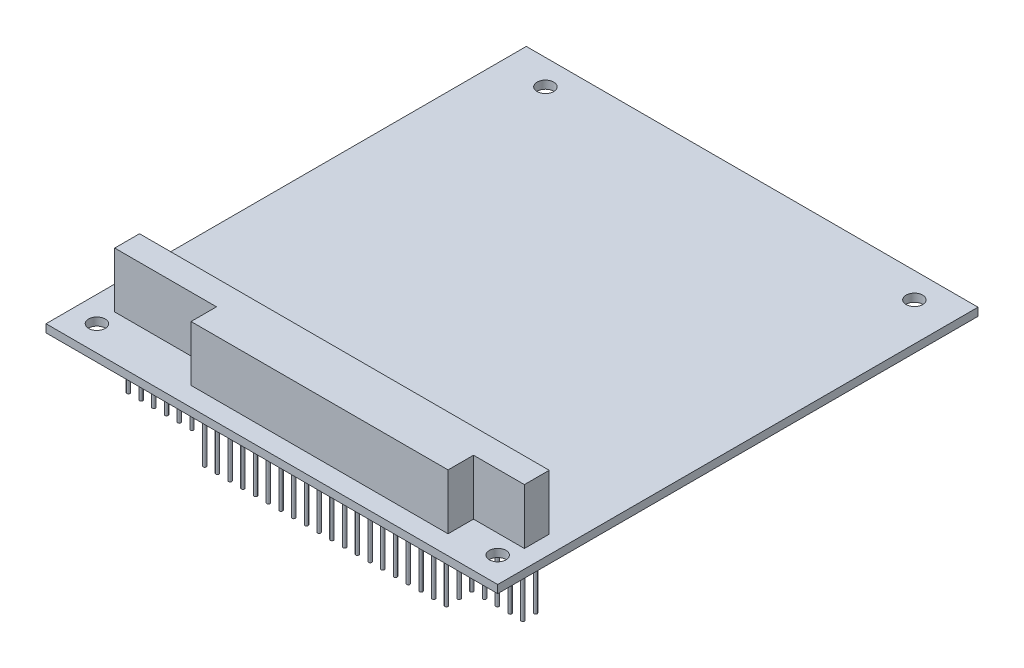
ISO-10303-21;
HEADER;
FILE_DESCRIPTION(('STEP AP214'),'2;1');
FILE_NAME('part.step','',(''),(''),'','','');
FILE_SCHEMA(('AUTOMOTIVE_DESIGN { 1 0 10303 214 1 1 1 1 }'));
ENDSEC;
DATA;
#1=APPLICATION_CONTEXT('core data for automotive mechanical design processes');
#2=APPLICATION_PROTOCOL_DEFINITION('international standard','automotive_design',2000,#1);
#3=PRODUCT_CONTEXT('',#1,'mechanical');
#4=PRODUCT('Part','Part','',(#3));
#5=PRODUCT_RELATED_PRODUCT_CATEGORY('part','',(#4));
#6=PRODUCT_DEFINITION_FORMATION('','',#4);
#7=PRODUCT_DEFINITION_CONTEXT('part definition',#1,'design');
#8=PRODUCT_DEFINITION('design','',#6,#7);
#9=PRODUCT_DEFINITION_SHAPE('','',#8);
#10=(LENGTH_UNIT() NAMED_UNIT(*) SI_UNIT(.MILLI.,.METRE.));
#11=(NAMED_UNIT(*) PLANE_ANGLE_UNIT() SI_UNIT($,.RADIAN.));
#12=(NAMED_UNIT(*) SI_UNIT($,.STERADIAN.) SOLID_ANGLE_UNIT());
#13=UNCERTAINTY_MEASURE_WITH_UNIT(LENGTH_MEASURE(1.E-05),#10,'distance_accuracy_value','');
#14=(GEOMETRIC_REPRESENTATION_CONTEXT(3) GLOBAL_UNCERTAINTY_ASSIGNED_CONTEXT((#13)) GLOBAL_UNIT_ASSIGNED_CONTEXT((#10,
#11,#12)) REPRESENTATION_CONTEXT('',''));
#15=CARTESIAN_POINT('',(0.,0.,0.));
#16=DIRECTION('',(0.,0.,1.));
#17=DIRECTION('',(1.,0.,0.));
#18=AXIS2_PLACEMENT_3D('',#15,#16,#17);
#19=CARTESIAN_POINT('',(-45.085,0.,47.9425));
#20=DIRECTION('',(0.,1.,0.));
#21=DIRECTION('',(0.,0.,1.));
#22=AXIS2_PLACEMENT_3D('',#19,#20,#21);
#23=PLANE('',#22);
#24=CARTESIAN_POINT('',(-15.875,0.,42.926));
#25=DIRECTION('',(0.,1.,0.));
#26=DIRECTION('',(0.,0.,1.));
#27=AXIS2_PLACEMENT_3D('',#24,#25,#26);
#28=CIRCLE('',#27,0.317500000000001);
#29=CARTESIAN_POINT('',(-15.875,0.,43.2435));
#30=VERTEX_POINT('',#29);
#31=EDGE_CURVE('E42',#30,#30,#28,.F.);
#32=ORIENTED_EDGE('',*,*,#31,.F.);
#33=EDGE_LOOP('',(#32));
#34=FACE_BOUND('',#33,.T.);
#35=CARTESIAN_POINT('',(-10.795,0.,42.926));
#36=DIRECTION('',(0.,1.,0.));
#37=DIRECTION('',(0.,0.,1.));
#38=AXIS2_PLACEMENT_3D('',#35,#36,#37);
#39=CIRCLE('',#38,0.317500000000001);
#40=CARTESIAN_POINT('',(-10.795,0.,43.2435));
#41=VERTEX_POINT('',#40);
#42=EDGE_CURVE('E547',#41,#41,#39,.F.);
#43=ORIENTED_EDGE('',*,*,#42,.F.);
#44=EDGE_LOOP('',(#43));
#45=FACE_BOUND('',#44,.T.);
#46=CARTESIAN_POINT('',(-5.715,0.,42.926));
#47=DIRECTION('',(0.,1.,0.));
#48=DIRECTION('',(0.,0.,1.));
#49=AXIS2_PLACEMENT_3D('',#46,#47,#48);
#50=CIRCLE('',#49,0.317500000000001);
#51=CARTESIAN_POINT('',(-5.715,0.,43.2435));
#52=VERTEX_POINT('',#51);
#53=EDGE_CURVE('E541',#52,#52,#50,.F.);
#54=ORIENTED_EDGE('',*,*,#53,.F.);
#55=EDGE_LOOP('',(#54));
#56=FACE_BOUND('',#55,.T.);
#57=CARTESIAN_POINT('',(-0.634999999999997,0.,42.926));
#58=DIRECTION('',(0.,1.,0.));
#59=DIRECTION('',(0.,0.,1.));
#60=AXIS2_PLACEMENT_3D('',#57,#58,#59);
#61=CIRCLE('',#60,0.317500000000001);
#62=CARTESIAN_POINT('',(-0.634999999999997,0.,43.2435));
#63=VERTEX_POINT('',#62);
#64=EDGE_CURVE('E535',#63,#63,#61,.F.);
#65=ORIENTED_EDGE('',*,*,#64,.F.);
#66=EDGE_LOOP('',(#65));
#67=FACE_BOUND('',#66,.T.);
#68=CARTESIAN_POINT('',(4.445,0.,42.926));
#69=DIRECTION('',(0.,1.,0.));
#70=DIRECTION('',(0.,0.,1.));
#71=AXIS2_PLACEMENT_3D('',#68,#69,#70);
#72=CIRCLE('',#71,0.317500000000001);
#73=CARTESIAN_POINT('',(4.445,0.,43.2435));
#74=VERTEX_POINT('',#73);
#75=EDGE_CURVE('E529',#74,#74,#72,.F.);
#76=ORIENTED_EDGE('',*,*,#75,.F.);
#77=EDGE_LOOP('',(#76));
#78=FACE_BOUND('',#77,.T.);
#79=CARTESIAN_POINT('',(9.52500000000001,0.,42.926));
#80=DIRECTION('',(0.,1.,0.));
#81=DIRECTION('',(0.,0.,1.));
#82=AXIS2_PLACEMENT_3D('',#79,#80,#81);
#83=CIRCLE('',#82,0.317500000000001);
#84=CARTESIAN_POINT('',(9.52500000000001,0.,43.2435));
#85=VERTEX_POINT('',#84);
#86=EDGE_CURVE('E523',#85,#85,#83,.F.);
#87=ORIENTED_EDGE('',*,*,#86,.F.);
#88=EDGE_LOOP('',(#87));
#89=FACE_BOUND('',#88,.T.);
#90=CARTESIAN_POINT('',(14.605,0.,42.926));
#91=DIRECTION('',(0.,1.,0.));
#92=DIRECTION('',(0.,0.,1.));
#93=AXIS2_PLACEMENT_3D('',#90,#91,#92);
#94=CIRCLE('',#93,0.317500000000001);
#95=CARTESIAN_POINT('',(14.605,0.,43.2435));
#96=VERTEX_POINT('',#95);
#97=EDGE_CURVE('E517',#96,#96,#94,.F.);
#98=ORIENTED_EDGE('',*,*,#97,.F.);
#99=EDGE_LOOP('',(#98));
#100=FACE_BOUND('',#99,.T.);
#101=CARTESIAN_POINT('',(19.685,0.,42.926));
#102=DIRECTION('',(0.,1.,0.));
#103=DIRECTION('',(0.,0.,1.));
#104=AXIS2_PLACEMENT_3D('',#101,#102,#103);
#105=CIRCLE('',#104,0.317500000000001);
#106=CARTESIAN_POINT('',(19.685,0.,43.2435));
#107=VERTEX_POINT('',#106);
#108=EDGE_CURVE('E511',#107,#107,#105,.F.);
#109=ORIENTED_EDGE('',*,*,#108,.F.);
#110=EDGE_LOOP('',(#109));
#111=FACE_BOUND('',#110,.T.);
#112=CARTESIAN_POINT('',(24.765,0.,42.926));
#113=DIRECTION('',(0.,1.,0.));
#114=DIRECTION('',(0.,0.,1.));
#115=AXIS2_PLACEMENT_3D('',#112,#113,#114);
#116=CIRCLE('',#115,0.317500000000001);
#117=CARTESIAN_POINT('',(24.765,0.,43.2435));
#118=VERTEX_POINT('',#117);
#119=EDGE_CURVE('E505',#118,#118,#116,.F.);
#120=ORIENTED_EDGE('',*,*,#119,.F.);
#121=EDGE_LOOP('',(#120));
#122=FACE_BOUND('',#121,.T.);
#123=CARTESIAN_POINT('',(29.845,0.,42.926));
#124=DIRECTION('',(0.,1.,0.));
#125=DIRECTION('',(0.,0.,1.));
#126=AXIS2_PLACEMENT_3D('',#123,#124,#125);
#127=CIRCLE('',#126,0.317500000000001);
#128=CARTESIAN_POINT('',(29.845,0.,43.2435));
#129=VERTEX_POINT('',#128);
#130=EDGE_CURVE('E499',#129,#129,#127,.F.);
#131=ORIENTED_EDGE('',*,*,#130,.F.);
#132=EDGE_LOOP('',(#131));
#133=FACE_BOUND('',#132,.T.);
#134=CARTESIAN_POINT('',(-15.875,0.,40.386));
#135=DIRECTION('',(0.,1.,0.));
#136=DIRECTION('',(0.,0.,1.));
#137=AXIS2_PLACEMENT_3D('',#134,#135,#136);
#138=CIRCLE('',#137,0.317500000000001);
#139=CARTESIAN_POINT('',(-15.875,0.,40.7035));
#140=VERTEX_POINT('',#139);
#141=EDGE_CURVE('E493',#140,#140,#138,.F.);
#142=ORIENTED_EDGE('',*,*,#141,.F.);
#143=EDGE_LOOP('',(#142));
#144=FACE_BOUND('',#143,.T.);
#145=CARTESIAN_POINT('',(-10.795,0.,40.386));
#146=DIRECTION('',(0.,1.,0.));
#147=DIRECTION('',(0.,0.,1.));
#148=AXIS2_PLACEMENT_3D('',#145,#146,#147);
#149=CIRCLE('',#148,0.317500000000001);
#150=CARTESIAN_POINT('',(-10.795,0.,40.7035));
#151=VERTEX_POINT('',#150);
#152=EDGE_CURVE('E487',#151,#151,#149,.F.);
#153=ORIENTED_EDGE('',*,*,#152,.F.);
#154=EDGE_LOOP('',(#153));
#155=FACE_BOUND('',#154,.T.);
#156=CARTESIAN_POINT('',(-5.715,0.,40.386));
#157=DIRECTION('',(0.,1.,0.));
#158=DIRECTION('',(0.,0.,1.));
#159=AXIS2_PLACEMENT_3D('',#156,#157,#158);
#160=CIRCLE('',#159,0.317500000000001);
#161=CARTESIAN_POINT('',(-5.715,0.,40.7035));
#162=VERTEX_POINT('',#161);
#163=EDGE_CURVE('E481',#162,#162,#160,.F.);
#164=ORIENTED_EDGE('',*,*,#163,.F.);
#165=EDGE_LOOP('',(#164));
#166=FACE_BOUND('',#165,.T.);
#167=CARTESIAN_POINT('',(-0.634999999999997,0.,40.386));
#168=DIRECTION('',(0.,1.,0.));
#169=DIRECTION('',(0.,0.,1.));
#170=AXIS2_PLACEMENT_3D('',#167,#168,#169);
#171=CIRCLE('',#170,0.317500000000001);
#172=CARTESIAN_POINT('',(-0.634999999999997,0.,40.7035));
#173=VERTEX_POINT('',#172);
#174=EDGE_CURVE('E475',#173,#173,#171,.F.);
#175=ORIENTED_EDGE('',*,*,#174,.F.);
#176=EDGE_LOOP('',(#175));
#177=FACE_BOUND('',#176,.T.);
#178=CARTESIAN_POINT('',(4.445,0.,40.386));
#179=DIRECTION('',(0.,1.,0.));
#180=DIRECTION('',(0.,0.,1.));
#181=AXIS2_PLACEMENT_3D('',#178,#179,#180);
#182=CIRCLE('',#181,0.317500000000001);
#183=CARTESIAN_POINT('',(4.445,0.,40.7035));
#184=VERTEX_POINT('',#183);
#185=EDGE_CURVE('E469',#184,#184,#182,.F.);
#186=ORIENTED_EDGE('',*,*,#185,.F.);
#187=EDGE_LOOP('',(#186));
#188=FACE_BOUND('',#187,.T.);
#189=CARTESIAN_POINT('',(9.52500000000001,0.,40.386));
#190=DIRECTION('',(0.,1.,0.));
#191=DIRECTION('',(0.,0.,1.));
#192=AXIS2_PLACEMENT_3D('',#189,#190,#191);
#193=CIRCLE('',#192,0.317500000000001);
#194=CARTESIAN_POINT('',(9.52500000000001,0.,40.7035));
#195=VERTEX_POINT('',#194);
#196=EDGE_CURVE('E463',#195,#195,#193,.F.);
#197=ORIENTED_EDGE('',*,*,#196,.F.);
#198=EDGE_LOOP('',(#197));
#199=FACE_BOUND('',#198,.T.);
#200=CARTESIAN_POINT('',(14.605,0.,40.386));
#201=DIRECTION('',(0.,1.,0.));
#202=DIRECTION('',(0.,0.,1.));
#203=AXIS2_PLACEMENT_3D('',#200,#201,#202);
#204=CIRCLE('',#203,0.317500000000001);
#205=CARTESIAN_POINT('',(14.605,0.,40.7035));
#206=VERTEX_POINT('',#205);
#207=EDGE_CURVE('E457',#206,#206,#204,.F.);
#208=ORIENTED_EDGE('',*,*,#207,.F.);
#209=EDGE_LOOP('',(#208));
#210=FACE_BOUND('',#209,.T.);
#211=CARTESIAN_POINT('',(19.685,0.,40.386));
#212=DIRECTION('',(0.,1.,0.));
#213=DIRECTION('',(0.,0.,1.));
#214=AXIS2_PLACEMENT_3D('',#211,#212,#213);
#215=CIRCLE('',#214,0.317500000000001);
#216=CARTESIAN_POINT('',(19.685,0.,40.7035));
#217=VERTEX_POINT('',#216);
#218=EDGE_CURVE('E451',#217,#217,#215,.F.);
#219=ORIENTED_EDGE('',*,*,#218,.F.);
#220=EDGE_LOOP('',(#219));
#221=FACE_BOUND('',#220,.T.);
#222=CARTESIAN_POINT('',(24.765,0.,40.386));
#223=DIRECTION('',(0.,1.,0.));
#224=DIRECTION('',(0.,0.,1.));
#225=AXIS2_PLACEMENT_3D('',#222,#223,#224);
#226=CIRCLE('',#225,0.317500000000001);
#227=CARTESIAN_POINT('',(24.765,0.,40.7035));
#228=VERTEX_POINT('',#227);
#229=EDGE_CURVE('E445',#228,#228,#226,.F.);
#230=ORIENTED_EDGE('',*,*,#229,.F.);
#231=EDGE_LOOP('',(#230));
#232=FACE_BOUND('',#231,.T.);
#233=CARTESIAN_POINT('',(29.845,0.,40.386));
#234=DIRECTION('',(0.,1.,0.));
#235=DIRECTION('',(0.,0.,1.));
#236=AXIS2_PLACEMENT_3D('',#233,#234,#235);
#237=CIRCLE('',#236,0.317500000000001);
#238=CARTESIAN_POINT('',(29.845,0.,40.7035));
#239=VERTEX_POINT('',#238);
#240=EDGE_CURVE('E439',#239,#239,#237,.F.);
#241=ORIENTED_EDGE('',*,*,#240,.F.);
#242=EDGE_LOOP('',(#241));
#243=FACE_BOUND('',#242,.T.);
#244=CARTESIAN_POINT('',(-36.195,0.,37.846));
#245=DIRECTION('',(0.,1.,0.));
#246=DIRECTION('',(0.,0.,1.));
#247=AXIS2_PLACEMENT_3D('',#244,#245,#246);
#248=CIRCLE('',#247,0.317500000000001);
#249=CARTESIAN_POINT('',(-36.195,0.,38.1635));
#250=VERTEX_POINT('',#249);
#251=EDGE_CURVE('E433',#250,#250,#248,.F.);
#252=ORIENTED_EDGE('',*,*,#251,.F.);
#253=EDGE_LOOP('',(#252));
#254=FACE_BOUND('',#253,.T.);
#255=CARTESIAN_POINT('',(-31.115,0.,37.846));
#256=DIRECTION('',(0.,1.,0.));
#257=DIRECTION('',(0.,0.,1.));
#258=AXIS2_PLACEMENT_3D('',#255,#256,#257);
#259=CIRCLE('',#258,0.317500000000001);
#260=CARTESIAN_POINT('',(-31.115,0.,38.1635));
#261=VERTEX_POINT('',#260);
#262=EDGE_CURVE('E427',#261,#261,#259,.F.);
#263=ORIENTED_EDGE('',*,*,#262,.F.);
#264=EDGE_LOOP('',(#263));
#265=FACE_BOUND('',#264,.T.);
#266=CARTESIAN_POINT('',(-26.035,0.,37.846));
#267=DIRECTION('',(0.,1.,0.));
#268=DIRECTION('',(0.,0.,1.));
#269=AXIS2_PLACEMENT_3D('',#266,#267,#268);
#270=CIRCLE('',#269,0.317500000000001);
#271=CARTESIAN_POINT('',(-26.035,0.,38.1635));
#272=VERTEX_POINT('',#271);
#273=EDGE_CURVE('E421',#272,#272,#270,.F.);
#274=ORIENTED_EDGE('',*,*,#273,.F.);
#275=EDGE_LOOP('',(#274));
#276=FACE_BOUND('',#275,.T.);
#277=CARTESIAN_POINT('',(-20.955,0.,37.846));
#278=DIRECTION('',(0.,1.,0.));
#279=DIRECTION('',(0.,0.,1.));
#280=AXIS2_PLACEMENT_3D('',#277,#278,#279);
#281=CIRCLE('',#280,0.317500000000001);
#282=CARTESIAN_POINT('',(-20.955,0.,38.1635));
#283=VERTEX_POINT('',#282);
#284=EDGE_CURVE('E415',#283,#283,#281,.F.);
#285=ORIENTED_EDGE('',*,*,#284,.F.);
#286=EDGE_LOOP('',(#285));
#287=FACE_BOUND('',#286,.T.);
#288=CARTESIAN_POINT('',(-15.875,0.,37.846));
#289=DIRECTION('',(0.,1.,0.));
#290=DIRECTION('',(0.,0.,1.));
#291=AXIS2_PLACEMENT_3D('',#288,#289,#290);
#292=CIRCLE('',#291,0.317500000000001);
#293=CARTESIAN_POINT('',(-15.875,0.,38.1635));
#294=VERTEX_POINT('',#293);
#295=EDGE_CURVE('E409',#294,#294,#292,.F.);
#296=ORIENTED_EDGE('',*,*,#295,.F.);
#297=EDGE_LOOP('',(#296));
#298=FACE_BOUND('',#297,.T.);
#299=CARTESIAN_POINT('',(-10.795,0.,37.846));
#300=DIRECTION('',(0.,1.,0.));
#301=DIRECTION('',(0.,0.,1.));
#302=AXIS2_PLACEMENT_3D('',#299,#300,#301);
#303=CIRCLE('',#302,0.317500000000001);
#304=CARTESIAN_POINT('',(-10.795,0.,38.1635));
#305=VERTEX_POINT('',#304);
#306=EDGE_CURVE('E403',#305,#305,#303,.F.);
#307=ORIENTED_EDGE('',*,*,#306,.F.);
#308=EDGE_LOOP('',(#307));
#309=FACE_BOUND('',#308,.T.);
#310=CARTESIAN_POINT('',(-5.715,0.,37.846));
#311=DIRECTION('',(0.,1.,0.));
#312=DIRECTION('',(0.,0.,1.));
#313=AXIS2_PLACEMENT_3D('',#310,#311,#312);
#314=CIRCLE('',#313,0.317500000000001);
#315=CARTESIAN_POINT('',(-5.715,0.,38.1635));
#316=VERTEX_POINT('',#315);
#317=EDGE_CURVE('E397',#316,#316,#314,.F.);
#318=ORIENTED_EDGE('',*,*,#317,.F.);
#319=EDGE_LOOP('',(#318));
#320=FACE_BOUND('',#319,.T.);
#321=CARTESIAN_POINT('',(-0.634999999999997,0.,37.846));
#322=DIRECTION('',(0.,1.,0.));
#323=DIRECTION('',(0.,0.,1.));
#324=AXIS2_PLACEMENT_3D('',#321,#322,#323);
#325=CIRCLE('',#324,0.317500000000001);
#326=CARTESIAN_POINT('',(-0.634999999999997,0.,38.1635));
#327=VERTEX_POINT('',#326);
#328=EDGE_CURVE('E391',#327,#327,#325,.F.);
#329=ORIENTED_EDGE('',*,*,#328,.F.);
#330=EDGE_LOOP('',(#329));
#331=FACE_BOUND('',#330,.T.);
#332=CARTESIAN_POINT('',(4.445,0.,37.846));
#333=DIRECTION('',(0.,1.,0.));
#334=DIRECTION('',(0.,0.,1.));
#335=AXIS2_PLACEMENT_3D('',#332,#333,#334);
#336=CIRCLE('',#335,0.317500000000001);
#337=CARTESIAN_POINT('',(4.445,0.,38.1635));
#338=VERTEX_POINT('',#337);
#339=EDGE_CURVE('E385',#338,#338,#336,.F.);
#340=ORIENTED_EDGE('',*,*,#339,.F.);
#341=EDGE_LOOP('',(#340));
#342=FACE_BOUND('',#341,.T.);
#343=CARTESIAN_POINT('',(9.52500000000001,0.,37.846));
#344=DIRECTION('',(0.,1.,0.));
#345=DIRECTION('',(0.,0.,1.));
#346=AXIS2_PLACEMENT_3D('',#343,#344,#345);
#347=CIRCLE('',#346,0.317500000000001);
#348=CARTESIAN_POINT('',(9.52500000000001,0.,38.1635));
#349=VERTEX_POINT('',#348);
#350=EDGE_CURVE('E379',#349,#349,#347,.F.);
#351=ORIENTED_EDGE('',*,*,#350,.F.);
#352=EDGE_LOOP('',(#351));
#353=FACE_BOUND('',#352,.T.);
#354=CARTESIAN_POINT('',(14.605,0.,37.846));
#355=DIRECTION('',(0.,1.,0.));
#356=DIRECTION('',(0.,0.,1.));
#357=AXIS2_PLACEMENT_3D('',#354,#355,#356);
#358=CIRCLE('',#357,0.317500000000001);
#359=CARTESIAN_POINT('',(14.605,0.,38.1635));
#360=VERTEX_POINT('',#359);
#361=EDGE_CURVE('E373',#360,#360,#358,.F.);
#362=ORIENTED_EDGE('',*,*,#361,.F.);
#363=EDGE_LOOP('',(#362));
#364=FACE_BOUND('',#363,.T.);
#365=CARTESIAN_POINT('',(19.685,0.,37.846));
#366=DIRECTION('',(0.,1.,0.));
#367=DIRECTION('',(0.,0.,1.));
#368=AXIS2_PLACEMENT_3D('',#365,#366,#367);
#369=CIRCLE('',#368,0.317500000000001);
#370=CARTESIAN_POINT('',(19.685,0.,38.1635));
#371=VERTEX_POINT('',#370);
#372=EDGE_CURVE('E367',#371,#371,#369,.F.);
#373=ORIENTED_EDGE('',*,*,#372,.F.);
#374=EDGE_LOOP('',(#373));
#375=FACE_BOUND('',#374,.T.);
#376=CARTESIAN_POINT('',(24.765,0.,37.846));
#377=DIRECTION('',(0.,1.,0.));
#378=DIRECTION('',(0.,0.,1.));
#379=AXIS2_PLACEMENT_3D('',#376,#377,#378);
#380=CIRCLE('',#379,0.317500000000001);
#381=CARTESIAN_POINT('',(24.765,0.,38.1635));
#382=VERTEX_POINT('',#381);
#383=EDGE_CURVE('E361',#382,#382,#380,.F.);
#384=ORIENTED_EDGE('',*,*,#383,.F.);
#385=EDGE_LOOP('',(#384));
#386=FACE_BOUND('',#385,.T.);
#387=CARTESIAN_POINT('',(29.845,0.,37.846));
#388=DIRECTION('',(0.,1.,0.));
#389=DIRECTION('',(0.,0.,1.));
#390=AXIS2_PLACEMENT_3D('',#387,#388,#389);
#391=CIRCLE('',#390,0.317500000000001);
#392=CARTESIAN_POINT('',(29.845,0.,38.1635));
#393=VERTEX_POINT('',#392);
#394=EDGE_CURVE('E355',#393,#393,#391,.F.);
#395=ORIENTED_EDGE('',*,*,#394,.F.);
#396=EDGE_LOOP('',(#395));
#397=FACE_BOUND('',#396,.T.);
#398=CARTESIAN_POINT('',(34.925,0.,37.846));
#399=DIRECTION('',(0.,1.,0.));
#400=DIRECTION('',(0.,0.,1.));
#401=AXIS2_PLACEMENT_3D('',#398,#399,#400);
#402=CIRCLE('',#401,0.317500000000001);
#403=CARTESIAN_POINT('',(34.925,0.,38.1635));
#404=VERTEX_POINT('',#403);
#405=EDGE_CURVE('E349',#404,#404,#402,.F.);
#406=ORIENTED_EDGE('',*,*,#405,.F.);
#407=EDGE_LOOP('',(#406));
#408=FACE_BOUND('',#407,.T.);
#409=CARTESIAN_POINT('',(40.005,0.,37.846));
#410=DIRECTION('',(0.,1.,0.));
#411=DIRECTION('',(0.,0.,1.));
#412=AXIS2_PLACEMENT_3D('',#409,#410,#411);
#413=CIRCLE('',#412,0.317500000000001);
#414=CARTESIAN_POINT('',(40.005,0.,38.1635));
#415=VERTEX_POINT('',#414);
#416=EDGE_CURVE('E343',#415,#415,#413,.F.);
#417=ORIENTED_EDGE('',*,*,#416,.F.);
#418=EDGE_LOOP('',(#417));
#419=FACE_BOUND('',#418,.T.);
#420=CARTESIAN_POINT('',(-36.195,0.,35.306));
#421=DIRECTION('',(0.,1.,0.));
#422=DIRECTION('',(0.,0.,1.));
#423=AXIS2_PLACEMENT_3D('',#420,#421,#422);
#424=CIRCLE('',#423,0.317500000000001);
#425=CARTESIAN_POINT('',(-36.195,0.,35.6235));
#426=VERTEX_POINT('',#425);
#427=EDGE_CURVE('E337',#426,#426,#424,.F.);
#428=ORIENTED_EDGE('',*,*,#427,.F.);
#429=EDGE_LOOP('',(#428));
#430=FACE_BOUND('',#429,.T.);
#431=CARTESIAN_POINT('',(-31.115,0.,35.306));
#432=DIRECTION('',(0.,1.,0.));
#433=DIRECTION('',(0.,0.,1.));
#434=AXIS2_PLACEMENT_3D('',#431,#432,#433);
#435=CIRCLE('',#434,0.317500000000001);
#436=CARTESIAN_POINT('',(-31.115,0.,35.6235));
#437=VERTEX_POINT('',#436);
#438=EDGE_CURVE('E331',#437,#437,#435,.F.);
#439=ORIENTED_EDGE('',*,*,#438,.F.);
#440=EDGE_LOOP('',(#439));
#441=FACE_BOUND('',#440,.T.);
#442=CARTESIAN_POINT('',(-26.035,0.,35.306));
#443=DIRECTION('',(0.,1.,0.));
#444=DIRECTION('',(0.,0.,1.));
#445=AXIS2_PLACEMENT_3D('',#442,#443,#444);
#446=CIRCLE('',#445,0.317500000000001);
#447=CARTESIAN_POINT('',(-26.035,0.,35.6235));
#448=VERTEX_POINT('',#447);
#449=EDGE_CURVE('E325',#448,#448,#446,.F.);
#450=ORIENTED_EDGE('',*,*,#449,.F.);
#451=EDGE_LOOP('',(#450));
#452=FACE_BOUND('',#451,.T.);
#453=CARTESIAN_POINT('',(-20.955,0.,35.306));
#454=DIRECTION('',(0.,1.,0.));
#455=DIRECTION('',(0.,0.,1.));
#456=AXIS2_PLACEMENT_3D('',#453,#454,#455);
#457=CIRCLE('',#456,0.317500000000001);
#458=CARTESIAN_POINT('',(-20.955,0.,35.6235));
#459=VERTEX_POINT('',#458);
#460=EDGE_CURVE('E319',#459,#459,#457,.F.);
#461=ORIENTED_EDGE('',*,*,#460,.F.);
#462=EDGE_LOOP('',(#461));
#463=FACE_BOUND('',#462,.T.);
#464=CARTESIAN_POINT('',(-15.875,0.,35.306));
#465=DIRECTION('',(0.,1.,0.));
#466=DIRECTION('',(0.,0.,1.));
#467=AXIS2_PLACEMENT_3D('',#464,#465,#466);
#468=CIRCLE('',#467,0.317500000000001);
#469=CARTESIAN_POINT('',(-15.875,0.,35.6235));
#470=VERTEX_POINT('',#469);
#471=EDGE_CURVE('E313',#470,#470,#468,.F.);
#472=ORIENTED_EDGE('',*,*,#471,.F.);
#473=EDGE_LOOP('',(#472));
#474=FACE_BOUND('',#473,.T.);
#475=CARTESIAN_POINT('',(-10.795,0.,35.306));
#476=DIRECTION('',(0.,1.,0.));
#477=DIRECTION('',(0.,0.,1.));
#478=AXIS2_PLACEMENT_3D('',#475,#476,#477);
#479=CIRCLE('',#478,0.317500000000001);
#480=CARTESIAN_POINT('',(-10.795,0.,35.6235));
#481=VERTEX_POINT('',#480);
#482=EDGE_CURVE('E307',#481,#481,#479,.F.);
#483=ORIENTED_EDGE('',*,*,#482,.F.);
#484=EDGE_LOOP('',(#483));
#485=FACE_BOUND('',#484,.T.);
#486=CARTESIAN_POINT('',(-5.715,0.,35.306));
#487=DIRECTION('',(0.,1.,0.));
#488=DIRECTION('',(0.,0.,1.));
#489=AXIS2_PLACEMENT_3D('',#486,#487,#488);
#490=CIRCLE('',#489,0.317500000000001);
#491=CARTESIAN_POINT('',(-5.715,0.,35.6235));
#492=VERTEX_POINT('',#491);
#493=EDGE_CURVE('E301',#492,#492,#490,.F.);
#494=ORIENTED_EDGE('',*,*,#493,.F.);
#495=EDGE_LOOP('',(#494));
#496=FACE_BOUND('',#495,.T.);
#497=CARTESIAN_POINT('',(-0.634999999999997,0.,35.306));
#498=DIRECTION('',(0.,1.,0.));
#499=DIRECTION('',(0.,0.,1.));
#500=AXIS2_PLACEMENT_3D('',#497,#498,#499);
#501=CIRCLE('',#500,0.317500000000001);
#502=CARTESIAN_POINT('',(-0.634999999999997,0.,35.6235));
#503=VERTEX_POINT('',#502);
#504=EDGE_CURVE('E295',#503,#503,#501,.F.);
#505=ORIENTED_EDGE('',*,*,#504,.F.);
#506=EDGE_LOOP('',(#505));
#507=FACE_BOUND('',#506,.T.);
#508=CARTESIAN_POINT('',(4.445,0.,35.306));
#509=DIRECTION('',(0.,1.,0.));
#510=DIRECTION('',(0.,0.,1.));
#511=AXIS2_PLACEMENT_3D('',#508,#509,#510);
#512=CIRCLE('',#511,0.317500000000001);
#513=CARTESIAN_POINT('',(4.445,0.,35.6235));
#514=VERTEX_POINT('',#513);
#515=EDGE_CURVE('E289',#514,#514,#512,.F.);
#516=ORIENTED_EDGE('',*,*,#515,.F.);
#517=EDGE_LOOP('',(#516));
#518=FACE_BOUND('',#517,.T.);
#519=CARTESIAN_POINT('',(9.52500000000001,0.,35.306));
#520=DIRECTION('',(0.,1.,0.));
#521=DIRECTION('',(0.,0.,1.));
#522=AXIS2_PLACEMENT_3D('',#519,#520,#521);
#523=CIRCLE('',#522,0.317500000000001);
#524=CARTESIAN_POINT('',(9.52500000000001,0.,35.6235));
#525=VERTEX_POINT('',#524);
#526=EDGE_CURVE('E283',#525,#525,#523,.F.);
#527=ORIENTED_EDGE('',*,*,#526,.F.);
#528=EDGE_LOOP('',(#527));
#529=FACE_BOUND('',#528,.T.);
#530=CARTESIAN_POINT('',(14.605,0.,35.306));
#531=DIRECTION('',(0.,1.,0.));
#532=DIRECTION('',(0.,0.,1.));
#533=AXIS2_PLACEMENT_3D('',#530,#531,#532);
#534=CIRCLE('',#533,0.317500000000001);
#535=CARTESIAN_POINT('',(14.605,0.,35.6235));
#536=VERTEX_POINT('',#535);
#537=EDGE_CURVE('E277',#536,#536,#534,.F.);
#538=ORIENTED_EDGE('',*,*,#537,.F.);
#539=EDGE_LOOP('',(#538));
#540=FACE_BOUND('',#539,.T.);
#541=CARTESIAN_POINT('',(19.685,0.,35.306));
#542=DIRECTION('',(0.,1.,0.));
#543=DIRECTION('',(0.,0.,1.));
#544=AXIS2_PLACEMENT_3D('',#541,#542,#543);
#545=CIRCLE('',#544,0.317500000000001);
#546=CARTESIAN_POINT('',(19.685,0.,35.6235));
#547=VERTEX_POINT('',#546);
#548=EDGE_CURVE('E271',#547,#547,#545,.F.);
#549=ORIENTED_EDGE('',*,*,#548,.F.);
#550=EDGE_LOOP('',(#549));
#551=FACE_BOUND('',#550,.T.);
#552=CARTESIAN_POINT('',(24.765,0.,35.306));
#553=DIRECTION('',(0.,1.,0.));
#554=DIRECTION('',(0.,0.,1.));
#555=AXIS2_PLACEMENT_3D('',#552,#553,#554);
#556=CIRCLE('',#555,0.317500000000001);
#557=CARTESIAN_POINT('',(24.765,0.,35.6235));
#558=VERTEX_POINT('',#557);
#559=EDGE_CURVE('E265',#558,#558,#556,.F.);
#560=ORIENTED_EDGE('',*,*,#559,.F.);
#561=EDGE_LOOP('',(#560));
#562=FACE_BOUND('',#561,.T.);
#563=CARTESIAN_POINT('',(29.845,0.,35.306));
#564=DIRECTION('',(0.,1.,0.));
#565=DIRECTION('',(0.,0.,1.));
#566=AXIS2_PLACEMENT_3D('',#563,#564,#565);
#567=CIRCLE('',#566,0.317500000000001);
#568=CARTESIAN_POINT('',(29.845,0.,35.6235));
#569=VERTEX_POINT('',#568);
#570=EDGE_CURVE('E259',#569,#569,#567,.F.);
#571=ORIENTED_EDGE('',*,*,#570,.F.);
#572=EDGE_LOOP('',(#571));
#573=FACE_BOUND('',#572,.T.);
#574=CARTESIAN_POINT('',(34.925,0.,35.306));
#575=DIRECTION('',(0.,1.,0.));
#576=DIRECTION('',(0.,0.,1.));
#577=AXIS2_PLACEMENT_3D('',#574,#575,#576);
#578=CIRCLE('',#577,0.317500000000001);
#579=CARTESIAN_POINT('',(34.925,0.,35.6235));
#580=VERTEX_POINT('',#579);
#581=EDGE_CURVE('E253',#580,#580,#578,.F.);
#582=ORIENTED_EDGE('',*,*,#581,.F.);
#583=EDGE_LOOP('',(#582));
#584=FACE_BOUND('',#583,.T.);
#585=CARTESIAN_POINT('',(40.005,0.,35.306));
#586=DIRECTION('',(0.,1.,0.));
#587=DIRECTION('',(0.,0.,1.));
#588=AXIS2_PLACEMENT_3D('',#585,#586,#587);
#589=CIRCLE('',#588,0.317500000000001);
#590=CARTESIAN_POINT('',(40.005,0.,35.6235));
#591=VERTEX_POINT('',#590);
#592=EDGE_CURVE('E247',#591,#591,#589,.F.);
#593=ORIENTED_EDGE('',*,*,#592,.F.);
#594=EDGE_LOOP('',(#593));
#595=FACE_BOUND('',#594,.T.);
#596=CARTESIAN_POINT('',(-36.195,0.,-42.8625));
#597=DIRECTION('',(0.,1.,0.));
#598=DIRECTION('',(0.,0.,1.));
#599=AXIS2_PLACEMENT_3D('',#596,#597,#598);
#600=CIRCLE('',#599,1.651);
#601=CARTESIAN_POINT('',(-36.195,0.,-41.2115));
#602=VERTEX_POINT('',#601);
#603=EDGE_CURVE('E201',#602,#602,#600,.T.);
#604=ORIENTED_EDGE('',*,*,#603,.T.);
#605=EDGE_LOOP('',(#604));
#606=FACE_BOUND('',#605,.T.);
#607=CARTESIAN_POINT('',(-40.005,0.,42.8625));
#608=DIRECTION('',(0.,1.,0.));
#609=DIRECTION('',(0.,0.,1.));
#610=AXIS2_PLACEMENT_3D('',#607,#608,#609);
#611=CIRCLE('',#610,1.651);
#612=CARTESIAN_POINT('',(-40.005,0.,44.5135));
#613=VERTEX_POINT('',#612);
#614=EDGE_CURVE('E213',#613,#613,#611,.T.);
#615=ORIENTED_EDGE('',*,*,#614,.T.);
#616=EDGE_LOOP('',(#615));
#617=FACE_BOUND('',#616,.T.);
#618=DIRECTION('',(0.,0.,1.));
#619=VECTOR('',#618,1.);
#620=CARTESIAN_POINT('',(-45.085,0.,-47.9425));
#621=LINE('',#620,#619);
#622=CARTESIAN_POINT('',(-45.085,0.,-47.9425));
#623=VERTEX_POINT('',#622);
#624=CARTESIAN_POINT('',(-45.085,0.,47.9425));
#625=VERTEX_POINT('',#624);
#626=EDGE_CURVE('E219',#623,#625,#621,.T.);
#627=ORIENTED_EDGE('',*,*,#626,.F.);
#628=DIRECTION('',(-1.,0.,0.));
#629=VECTOR('',#628,1.);
#630=CARTESIAN_POINT('',(-45.085,0.,-47.9425));
#631=LINE('',#630,#629);
#632=CARTESIAN_POINT('',(45.085,0.,-47.9425));
#633=VERTEX_POINT('',#632);
#634=EDGE_CURVE('E226',#633,#623,#631,.T.);
#635=ORIENTED_EDGE('',*,*,#634,.F.);
#636=DIRECTION('',(0.,0.,-1.));
#637=VECTOR('',#636,1.);
#638=CARTESIAN_POINT('',(45.085,0.,-47.9425));
#639=LINE('',#638,#637);
#640=CARTESIAN_POINT('',(45.085,0.,47.9425));
#641=VERTEX_POINT('',#640);
#642=EDGE_CURVE('E224',#641,#633,#639,.T.);
#643=ORIENTED_EDGE('',*,*,#642,.F.);
#644=DIRECTION('',(1.,0.,0.));
#645=VECTOR('',#644,1.);
#646=CARTESIAN_POINT('',(-45.085,0.,47.9425));
#647=LINE('',#646,#645);
#648=EDGE_CURVE('E222',#625,#641,#647,.T.);
#649=ORIENTED_EDGE('',*,*,#648,.F.);
#650=EDGE_LOOP('',(#627,#635,#643,#649));
#651=FACE_BOUND('',#650,.T.);
#652=CARTESIAN_POINT('',(40.005,0.,42.8625));
#653=DIRECTION('',(0.,1.,0.));
#654=DIRECTION('',(0.,0.,1.));
#655=AXIS2_PLACEMENT_3D('',#652,#653,#654);
#656=CIRCLE('',#655,1.651);
#657=CARTESIAN_POINT('',(40.005,0.,44.5135));
#658=VERTEX_POINT('',#657);
#659=EDGE_CURVE('E207',#658,#658,#656,.T.);
#660=ORIENTED_EDGE('',*,*,#659,.T.);
#661=EDGE_LOOP('',(#660));
#662=FACE_BOUND('',#661,.T.);
#663=CARTESIAN_POINT('',(37.465,0.,-42.8625));
#664=DIRECTION('',(0.,1.,0.));
#665=DIRECTION('',(0.,0.,1.));
#666=AXIS2_PLACEMENT_3D('',#663,#664,#665);
#667=CIRCLE('',#666,1.651);
#668=CARTESIAN_POINT('',(37.465,0.,-41.2115));
#669=VERTEX_POINT('',#668);
#670=EDGE_CURVE('E135',#669,#669,#667,.T.);
#671=ORIENTED_EDGE('',*,*,#670,.T.);
#672=EDGE_LOOP('',(#671));
#673=FACE_BOUND('',#672,.T.);
#674=CARTESIAN_POINT('',(37.465,0.,35.306));
#675=DIRECTION('',(0.,1.,0.));
#676=DIRECTION('',(0.,0.,1.));
#677=AXIS2_PLACEMENT_3D('',#674,#675,#676);
#678=CIRCLE('',#677,0.317500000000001);
#679=CARTESIAN_POINT('',(37.465,0.,35.6235));
#680=VERTEX_POINT('',#679);
#681=EDGE_CURVE('E250',#680,#680,#678,.F.);
#682=ORIENTED_EDGE('',*,*,#681,.F.);
#683=EDGE_LOOP('',(#682));
#684=FACE_BOUND('',#683,.T.);
#685=CARTESIAN_POINT('',(32.385,0.,35.306));
#686=DIRECTION('',(0.,1.,0.));
#687=DIRECTION('',(0.,0.,1.));
#688=AXIS2_PLACEMENT_3D('',#685,#686,#687);
#689=CIRCLE('',#688,0.317500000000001);
#690=CARTESIAN_POINT('',(32.385,0.,35.6235));
#691=VERTEX_POINT('',#690);
#692=EDGE_CURVE('E256',#691,#691,#689,.F.);
#693=ORIENTED_EDGE('',*,*,#692,.F.);
#694=EDGE_LOOP('',(#693));
#695=FACE_BOUND('',#694,.T.);
#696=CARTESIAN_POINT('',(27.305,0.,35.306));
#697=DIRECTION('',(0.,1.,0.));
#698=DIRECTION('',(0.,0.,1.));
#699=AXIS2_PLACEMENT_3D('',#696,#697,#698);
#700=CIRCLE('',#699,0.317500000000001);
#701=CARTESIAN_POINT('',(27.305,0.,35.6235));
#702=VERTEX_POINT('',#701);
#703=EDGE_CURVE('E262',#702,#702,#700,.F.);
#704=ORIENTED_EDGE('',*,*,#703,.F.);
#705=EDGE_LOOP('',(#704));
#706=FACE_BOUND('',#705,.T.);
#707=CARTESIAN_POINT('',(22.225,0.,35.306));
#708=DIRECTION('',(0.,1.,0.));
#709=DIRECTION('',(0.,0.,1.));
#710=AXIS2_PLACEMENT_3D('',#707,#708,#709);
#711=CIRCLE('',#710,0.317500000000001);
#712=CARTESIAN_POINT('',(22.225,0.,35.6235));
#713=VERTEX_POINT('',#712);
#714=EDGE_CURVE('E268',#713,#713,#711,.F.);
#715=ORIENTED_EDGE('',*,*,#714,.F.);
#716=EDGE_LOOP('',(#715));
#717=FACE_BOUND('',#716,.T.);
#718=CARTESIAN_POINT('',(17.145,0.,35.306));
#719=DIRECTION('',(0.,1.,0.));
#720=DIRECTION('',(0.,0.,1.));
#721=AXIS2_PLACEMENT_3D('',#718,#719,#720);
#722=CIRCLE('',#721,0.317500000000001);
#723=CARTESIAN_POINT('',(17.145,0.,35.6235));
#724=VERTEX_POINT('',#723);
#725=EDGE_CURVE('E274',#724,#724,#722,.F.);
#726=ORIENTED_EDGE('',*,*,#725,.F.);
#727=EDGE_LOOP('',(#726));
#728=FACE_BOUND('',#727,.T.);
#729=CARTESIAN_POINT('',(12.065,0.,35.306));
#730=DIRECTION('',(0.,1.,0.));
#731=DIRECTION('',(0.,0.,1.));
#732=AXIS2_PLACEMENT_3D('',#729,#730,#731);
#733=CIRCLE('',#732,0.317500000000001);
#734=CARTESIAN_POINT('',(12.065,0.,35.6235));
#735=VERTEX_POINT('',#734);
#736=EDGE_CURVE('E280',#735,#735,#733,.F.);
#737=ORIENTED_EDGE('',*,*,#736,.F.);
#738=EDGE_LOOP('',(#737));
#739=FACE_BOUND('',#738,.T.);
#740=CARTESIAN_POINT('',(6.985,0.,35.306));
#741=DIRECTION('',(0.,1.,0.));
#742=DIRECTION('',(0.,0.,1.));
#743=AXIS2_PLACEMENT_3D('',#740,#741,#742);
#744=CIRCLE('',#743,0.317500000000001);
#745=CARTESIAN_POINT('',(6.985,0.,35.6235));
#746=VERTEX_POINT('',#745);
#747=EDGE_CURVE('E286',#746,#746,#744,.F.);
#748=ORIENTED_EDGE('',*,*,#747,.F.);
#749=EDGE_LOOP('',(#748));
#750=FACE_BOUND('',#749,.T.);
#751=CARTESIAN_POINT('',(1.905,0.,35.306));
#752=DIRECTION('',(0.,1.,0.));
#753=DIRECTION('',(0.,0.,1.));
#754=AXIS2_PLACEMENT_3D('',#751,#752,#753);
#755=CIRCLE('',#754,0.317500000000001);
#756=CARTESIAN_POINT('',(1.905,0.,35.6235));
#757=VERTEX_POINT('',#756);
#758=EDGE_CURVE('E292',#757,#757,#755,.F.);
#759=ORIENTED_EDGE('',*,*,#758,.F.);
#760=EDGE_LOOP('',(#759));
#761=FACE_BOUND('',#760,.T.);
#762=CARTESIAN_POINT('',(-3.175,0.,35.306));
#763=DIRECTION('',(0.,1.,0.));
#764=DIRECTION('',(0.,0.,1.));
#765=AXIS2_PLACEMENT_3D('',#762,#763,#764);
#766=CIRCLE('',#765,0.317500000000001);
#767=CARTESIAN_POINT('',(-3.175,0.,35.6235));
#768=VERTEX_POINT('',#767);
#769=EDGE_CURVE('E298',#768,#768,#766,.F.);
#770=ORIENTED_EDGE('',*,*,#769,.F.);
#771=EDGE_LOOP('',(#770));
#772=FACE_BOUND('',#771,.T.);
#773=CARTESIAN_POINT('',(-8.255,0.,35.306));
#774=DIRECTION('',(0.,1.,0.));
#775=DIRECTION('',(0.,0.,1.));
#776=AXIS2_PLACEMENT_3D('',#773,#774,#775);
#777=CIRCLE('',#776,0.317500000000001);
#778=CARTESIAN_POINT('',(-8.255,0.,35.6235));
#779=VERTEX_POINT('',#778);
#780=EDGE_CURVE('E304',#779,#779,#777,.F.);
#781=ORIENTED_EDGE('',*,*,#780,.F.);
#782=EDGE_LOOP('',(#781));
#783=FACE_BOUND('',#782,.T.);
#784=CARTESIAN_POINT('',(-13.335,0.,35.306));
#785=DIRECTION('',(0.,1.,0.));
#786=DIRECTION('',(0.,0.,1.));
#787=AXIS2_PLACEMENT_3D('',#784,#785,#786);
#788=CIRCLE('',#787,0.317500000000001);
#789=CARTESIAN_POINT('',(-13.335,0.,35.6235));
#790=VERTEX_POINT('',#789);
#791=EDGE_CURVE('E310',#790,#790,#788,.F.);
#792=ORIENTED_EDGE('',*,*,#791,.F.);
#793=EDGE_LOOP('',(#792));
#794=FACE_BOUND('',#793,.T.);
#795=CARTESIAN_POINT('',(-18.415,0.,35.306));
#796=DIRECTION('',(0.,1.,0.));
#797=DIRECTION('',(0.,0.,1.));
#798=AXIS2_PLACEMENT_3D('',#795,#796,#797);
#799=CIRCLE('',#798,0.317500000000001);
#800=CARTESIAN_POINT('',(-18.415,0.,35.6235));
#801=VERTEX_POINT('',#800);
#802=EDGE_CURVE('E316',#801,#801,#799,.F.);
#803=ORIENTED_EDGE('',*,*,#802,.F.);
#804=EDGE_LOOP('',(#803));
#805=FACE_BOUND('',#804,.T.);
#806=CARTESIAN_POINT('',(-23.495,0.,35.306));
#807=DIRECTION('',(0.,1.,0.));
#808=DIRECTION('',(0.,0.,1.));
#809=AXIS2_PLACEMENT_3D('',#806,#807,#808);
#810=CIRCLE('',#809,0.317500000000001);
#811=CARTESIAN_POINT('',(-23.495,0.,35.6235));
#812=VERTEX_POINT('',#811);
#813=EDGE_CURVE('E322',#812,#812,#810,.F.);
#814=ORIENTED_EDGE('',*,*,#813,.F.);
#815=EDGE_LOOP('',(#814));
#816=FACE_BOUND('',#815,.T.);
#817=CARTESIAN_POINT('',(-28.575,0.,35.306));
#818=DIRECTION('',(0.,1.,0.));
#819=DIRECTION('',(0.,0.,1.));
#820=AXIS2_PLACEMENT_3D('',#817,#818,#819);
#821=CIRCLE('',#820,0.317500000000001);
#822=CARTESIAN_POINT('',(-28.575,0.,35.6235));
#823=VERTEX_POINT('',#822);
#824=EDGE_CURVE('E328',#823,#823,#821,.F.);
#825=ORIENTED_EDGE('',*,*,#824,.F.);
#826=EDGE_LOOP('',(#825));
#827=FACE_BOUND('',#826,.T.);
#828=CARTESIAN_POINT('',(-33.655,0.,35.306));
#829=DIRECTION('',(0.,1.,0.));
#830=DIRECTION('',(0.,0.,1.));
#831=AXIS2_PLACEMENT_3D('',#828,#829,#830);
#832=CIRCLE('',#831,0.317500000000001);
#833=CARTESIAN_POINT('',(-33.655,0.,35.6235));
#834=VERTEX_POINT('',#833);
#835=EDGE_CURVE('E334',#834,#834,#832,.F.);
#836=ORIENTED_EDGE('',*,*,#835,.F.);
#837=EDGE_LOOP('',(#836));
#838=FACE_BOUND('',#837,.T.);
#839=CARTESIAN_POINT('',(-38.735,0.,35.306));
#840=DIRECTION('',(0.,1.,0.));
#841=DIRECTION('',(0.,0.,1.));
#842=AXIS2_PLACEMENT_3D('',#839,#840,#841);
#843=CIRCLE('',#842,0.317500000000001);
#844=CARTESIAN_POINT('',(-38.735,0.,35.6235));
#845=VERTEX_POINT('',#844);
#846=EDGE_CURVE('E340',#845,#845,#843,.F.);
#847=ORIENTED_EDGE('',*,*,#846,.F.);
#848=EDGE_LOOP('',(#847));
#849=FACE_BOUND('',#848,.T.);
#850=CARTESIAN_POINT('',(37.465,0.,37.846));
#851=DIRECTION('',(0.,1.,0.));
#852=DIRECTION('',(0.,0.,1.));
#853=AXIS2_PLACEMENT_3D('',#850,#851,#852);
#854=CIRCLE('',#853,0.317500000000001);
#855=CARTESIAN_POINT('',(37.465,0.,38.1635));
#856=VERTEX_POINT('',#855);
#857=EDGE_CURVE('E346',#856,#856,#854,.F.);
#858=ORIENTED_EDGE('',*,*,#857,.F.);
#859=EDGE_LOOP('',(#858));
#860=FACE_BOUND('',#859,.T.);
#861=CARTESIAN_POINT('',(32.385,0.,37.846));
#862=DIRECTION('',(0.,1.,0.));
#863=DIRECTION('',(0.,0.,1.));
#864=AXIS2_PLACEMENT_3D('',#861,#862,#863);
#865=CIRCLE('',#864,0.317500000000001);
#866=CARTESIAN_POINT('',(32.385,0.,38.1635));
#867=VERTEX_POINT('',#866);
#868=EDGE_CURVE('E352',#867,#867,#865,.F.);
#869=ORIENTED_EDGE('',*,*,#868,.F.);
#870=EDGE_LOOP('',(#869));
#871=FACE_BOUND('',#870,.T.);
#872=CARTESIAN_POINT('',(27.305,0.,37.846));
#873=DIRECTION('',(0.,1.,0.));
#874=DIRECTION('',(0.,0.,1.));
#875=AXIS2_PLACEMENT_3D('',#872,#873,#874);
#876=CIRCLE('',#875,0.317500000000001);
#877=CARTESIAN_POINT('',(27.305,0.,38.1635));
#878=VERTEX_POINT('',#877);
#879=EDGE_CURVE('E358',#878,#878,#876,.F.);
#880=ORIENTED_EDGE('',*,*,#879,.F.);
#881=EDGE_LOOP('',(#880));
#882=FACE_BOUND('',#881,.T.);
#883=CARTESIAN_POINT('',(22.225,0.,37.846));
#884=DIRECTION('',(0.,1.,0.));
#885=DIRECTION('',(0.,0.,1.));
#886=AXIS2_PLACEMENT_3D('',#883,#884,#885);
#887=CIRCLE('',#886,0.317500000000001);
#888=CARTESIAN_POINT('',(22.225,0.,38.1635));
#889=VERTEX_POINT('',#888);
#890=EDGE_CURVE('E364',#889,#889,#887,.F.);
#891=ORIENTED_EDGE('',*,*,#890,.F.);
#892=EDGE_LOOP('',(#891));
#893=FACE_BOUND('',#892,.T.);
#894=CARTESIAN_POINT('',(17.145,0.,37.846));
#895=DIRECTION('',(0.,1.,0.));
#896=DIRECTION('',(0.,0.,1.));
#897=AXIS2_PLACEMENT_3D('',#894,#895,#896);
#898=CIRCLE('',#897,0.317500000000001);
#899=CARTESIAN_POINT('',(17.145,0.,38.1635));
#900=VERTEX_POINT('',#899);
#901=EDGE_CURVE('E370',#900,#900,#898,.F.);
#902=ORIENTED_EDGE('',*,*,#901,.F.);
#903=EDGE_LOOP('',(#902));
#904=FACE_BOUND('',#903,.T.);
#905=CARTESIAN_POINT('',(12.065,0.,37.846));
#906=DIRECTION('',(0.,1.,0.));
#907=DIRECTION('',(0.,0.,1.));
#908=AXIS2_PLACEMENT_3D('',#905,#906,#907);
#909=CIRCLE('',#908,0.317500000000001);
#910=CARTESIAN_POINT('',(12.065,0.,38.1635));
#911=VERTEX_POINT('',#910);
#912=EDGE_CURVE('E376',#911,#911,#909,.F.);
#913=ORIENTED_EDGE('',*,*,#912,.F.);
#914=EDGE_LOOP('',(#913));
#915=FACE_BOUND('',#914,.T.);
#916=CARTESIAN_POINT('',(6.985,0.,37.846));
#917=DIRECTION('',(0.,1.,0.));
#918=DIRECTION('',(0.,0.,1.));
#919=AXIS2_PLACEMENT_3D('',#916,#917,#918);
#920=CIRCLE('',#919,0.317500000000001);
#921=CARTESIAN_POINT('',(6.985,0.,38.1635));
#922=VERTEX_POINT('',#921);
#923=EDGE_CURVE('E382',#922,#922,#920,.F.);
#924=ORIENTED_EDGE('',*,*,#923,.F.);
#925=EDGE_LOOP('',(#924));
#926=FACE_BOUND('',#925,.T.);
#927=CARTESIAN_POINT('',(1.905,0.,37.846));
#928=DIRECTION('',(0.,1.,0.));
#929=DIRECTION('',(0.,0.,1.));
#930=AXIS2_PLACEMENT_3D('',#927,#928,#929);
#931=CIRCLE('',#930,0.317500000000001);
#932=CARTESIAN_POINT('',(1.905,0.,38.1635));
#933=VERTEX_POINT('',#932);
#934=EDGE_CURVE('E388',#933,#933,#931,.F.);
#935=ORIENTED_EDGE('',*,*,#934,.F.);
#936=EDGE_LOOP('',(#935));
#937=FACE_BOUND('',#936,.T.);
#938=CARTESIAN_POINT('',(-3.175,0.,37.846));
#939=DIRECTION('',(0.,1.,0.));
#940=DIRECTION('',(0.,0.,1.));
#941=AXIS2_PLACEMENT_3D('',#938,#939,#940);
#942=CIRCLE('',#941,0.317500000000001);
#943=CARTESIAN_POINT('',(-3.175,0.,38.1635));
#944=VERTEX_POINT('',#943);
#945=EDGE_CURVE('E394',#944,#944,#942,.F.);
#946=ORIENTED_EDGE('',*,*,#945,.F.);
#947=EDGE_LOOP('',(#946));
#948=FACE_BOUND('',#947,.T.);
#949=CARTESIAN_POINT('',(-8.255,0.,37.846));
#950=DIRECTION('',(0.,1.,0.));
#951=DIRECTION('',(0.,0.,1.));
#952=AXIS2_PLACEMENT_3D('',#949,#950,#951);
#953=CIRCLE('',#952,0.317500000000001);
#954=CARTESIAN_POINT('',(-8.255,0.,38.1635));
#955=VERTEX_POINT('',#954);
#956=EDGE_CURVE('E400',#955,#955,#953,.F.);
#957=ORIENTED_EDGE('',*,*,#956,.F.);
#958=EDGE_LOOP('',(#957));
#959=FACE_BOUND('',#958,.T.);
#960=CARTESIAN_POINT('',(-13.335,0.,37.846));
#961=DIRECTION('',(0.,1.,0.));
#962=DIRECTION('',(0.,0.,1.));
#963=AXIS2_PLACEMENT_3D('',#960,#961,#962);
#964=CIRCLE('',#963,0.317500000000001);
#965=CARTESIAN_POINT('',(-13.335,0.,38.1635));
#966=VERTEX_POINT('',#965);
#967=EDGE_CURVE('E406',#966,#966,#964,.F.);
#968=ORIENTED_EDGE('',*,*,#967,.F.);
#969=EDGE_LOOP('',(#968));
#970=FACE_BOUND('',#969,.T.);
#971=CARTESIAN_POINT('',(-18.415,0.,37.846));
#972=DIRECTION('',(0.,1.,0.));
#973=DIRECTION('',(0.,0.,1.));
#974=AXIS2_PLACEMENT_3D('',#971,#972,#973);
#975=CIRCLE('',#974,0.317500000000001);
#976=CARTESIAN_POINT('',(-18.415,0.,38.1635));
#977=VERTEX_POINT('',#976);
#978=EDGE_CURVE('E412',#977,#977,#975,.F.);
#979=ORIENTED_EDGE('',*,*,#978,.F.);
#980=EDGE_LOOP('',(#979));
#981=FACE_BOUND('',#980,.T.);
#982=CARTESIAN_POINT('',(-23.495,0.,37.846));
#983=DIRECTION('',(0.,1.,0.));
#984=DIRECTION('',(0.,0.,1.));
#985=AXIS2_PLACEMENT_3D('',#982,#983,#984);
#986=CIRCLE('',#985,0.317500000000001);
#987=CARTESIAN_POINT('',(-23.495,0.,38.1635));
#988=VERTEX_POINT('',#987);
#989=EDGE_CURVE('E418',#988,#988,#986,.F.);
#990=ORIENTED_EDGE('',*,*,#989,.F.);
#991=EDGE_LOOP('',(#990));
#992=FACE_BOUND('',#991,.T.);
#993=CARTESIAN_POINT('',(-28.575,0.,37.846));
#994=DIRECTION('',(0.,1.,0.));
#995=DIRECTION('',(0.,0.,1.));
#996=AXIS2_PLACEMENT_3D('',#993,#994,#995);
#997=CIRCLE('',#996,0.317500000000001);
#998=CARTESIAN_POINT('',(-28.575,0.,38.1635));
#999=VERTEX_POINT('',#998);
#1000=EDGE_CURVE('E424',#999,#999,#997,.F.);
#1001=ORIENTED_EDGE('',*,*,#1000,.F.);
#1002=EDGE_LOOP('',(#1001));
#1003=FACE_BOUND('',#1002,.T.);
#1004=CARTESIAN_POINT('',(-33.655,0.,37.846));
#1005=DIRECTION('',(0.,1.,0.));
#1006=DIRECTION('',(0.,0.,1.));
#1007=AXIS2_PLACEMENT_3D('',#1004,#1005,#1006);
#1008=CIRCLE('',#1007,0.317500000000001);
#1009=CARTESIAN_POINT('',(-33.655,0.,38.1635));
#1010=VERTEX_POINT('',#1009);
#1011=EDGE_CURVE('E430',#1010,#1010,#1008,.F.);
#1012=ORIENTED_EDGE('',*,*,#1011,.F.);
#1013=EDGE_LOOP('',(#1012));
#1014=FACE_BOUND('',#1013,.T.);
#1015=CARTESIAN_POINT('',(-38.735,0.,37.846));
#1016=DIRECTION('',(0.,1.,0.));
#1017=DIRECTION('',(0.,0.,1.));
#1018=AXIS2_PLACEMENT_3D('',#1015,#1016,#1017);
#1019=CIRCLE('',#1018,0.317500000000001);
#1020=CARTESIAN_POINT('',(-38.735,0.,38.1635));
#1021=VERTEX_POINT('',#1020);
#1022=EDGE_CURVE('E436',#1021,#1021,#1019,.F.);
#1023=ORIENTED_EDGE('',*,*,#1022,.F.);
#1024=EDGE_LOOP('',(#1023));
#1025=FACE_BOUND('',#1024,.T.);
#1026=CARTESIAN_POINT('',(27.305,0.,40.386));
#1027=DIRECTION('',(0.,1.,0.));
#1028=DIRECTION('',(0.,0.,1.));
#1029=AXIS2_PLACEMENT_3D('',#1026,#1027,#1028);
#1030=CIRCLE('',#1029,0.317500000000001);
#1031=CARTESIAN_POINT('',(27.305,0.,40.7035));
#1032=VERTEX_POINT('',#1031);
#1033=EDGE_CURVE('E442',#1032,#1032,#1030,.F.);
#1034=ORIENTED_EDGE('',*,*,#1033,.F.);
#1035=EDGE_LOOP('',(#1034));
#1036=FACE_BOUND('',#1035,.T.);
#1037=CARTESIAN_POINT('',(22.225,0.,40.386));
#1038=DIRECTION('',(0.,1.,0.));
#1039=DIRECTION('',(0.,0.,1.));
#1040=AXIS2_PLACEMENT_3D('',#1037,#1038,#1039);
#1041=CIRCLE('',#1040,0.317500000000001);
#1042=CARTESIAN_POINT('',(22.225,0.,40.7035));
#1043=VERTEX_POINT('',#1042);
#1044=EDGE_CURVE('E448',#1043,#1043,#1041,.F.);
#1045=ORIENTED_EDGE('',*,*,#1044,.F.);
#1046=EDGE_LOOP('',(#1045));
#1047=FACE_BOUND('',#1046,.T.);
#1048=CARTESIAN_POINT('',(17.145,0.,40.386));
#1049=DIRECTION('',(0.,1.,0.));
#1050=DIRECTION('',(0.,0.,1.));
#1051=AXIS2_PLACEMENT_3D('',#1048,#1049,#1050);
#1052=CIRCLE('',#1051,0.317500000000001);
#1053=CARTESIAN_POINT('',(17.145,0.,40.7035));
#1054=VERTEX_POINT('',#1053);
#1055=EDGE_CURVE('E454',#1054,#1054,#1052,.F.);
#1056=ORIENTED_EDGE('',*,*,#1055,.F.);
#1057=EDGE_LOOP('',(#1056));
#1058=FACE_BOUND('',#1057,.T.);
#1059=CARTESIAN_POINT('',(12.065,0.,40.386));
#1060=DIRECTION('',(0.,1.,0.));
#1061=DIRECTION('',(0.,0.,1.));
#1062=AXIS2_PLACEMENT_3D('',#1059,#1060,#1061);
#1063=CIRCLE('',#1062,0.317500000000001);
#1064=CARTESIAN_POINT('',(12.065,0.,40.7035));
#1065=VERTEX_POINT('',#1064);
#1066=EDGE_CURVE('E460',#1065,#1065,#1063,.F.);
#1067=ORIENTED_EDGE('',*,*,#1066,.F.);
#1068=EDGE_LOOP('',(#1067));
#1069=FACE_BOUND('',#1068,.T.);
#1070=CARTESIAN_POINT('',(6.985,0.,40.386));
#1071=DIRECTION('',(0.,1.,0.));
#1072=DIRECTION('',(0.,0.,1.));
#1073=AXIS2_PLACEMENT_3D('',#1070,#1071,#1072);
#1074=CIRCLE('',#1073,0.317500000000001);
#1075=CARTESIAN_POINT('',(6.985,0.,40.7035));
#1076=VERTEX_POINT('',#1075);
#1077=EDGE_CURVE('E466',#1076,#1076,#1074,.F.);
#1078=ORIENTED_EDGE('',*,*,#1077,.F.);
#1079=EDGE_LOOP('',(#1078));
#1080=FACE_BOUND('',#1079,.T.);
#1081=CARTESIAN_POINT('',(1.905,0.,40.386));
#1082=DIRECTION('',(0.,1.,0.));
#1083=DIRECTION('',(0.,0.,1.));
#1084=AXIS2_PLACEMENT_3D('',#1081,#1082,#1083);
#1085=CIRCLE('',#1084,0.317500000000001);
#1086=CARTESIAN_POINT('',(1.905,0.,40.7035));
#1087=VERTEX_POINT('',#1086);
#1088=EDGE_CURVE('E472',#1087,#1087,#1085,.F.);
#1089=ORIENTED_EDGE('',*,*,#1088,.F.);
#1090=EDGE_LOOP('',(#1089));
#1091=FACE_BOUND('',#1090,.T.);
#1092=CARTESIAN_POINT('',(-3.175,0.,40.386));
#1093=DIRECTION('',(0.,1.,0.));
#1094=DIRECTION('',(0.,0.,1.));
#1095=AXIS2_PLACEMENT_3D('',#1092,#1093,#1094);
#1096=CIRCLE('',#1095,0.317500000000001);
#1097=CARTESIAN_POINT('',(-3.175,0.,40.7035));
#1098=VERTEX_POINT('',#1097);
#1099=EDGE_CURVE('E478',#1098,#1098,#1096,.F.);
#1100=ORIENTED_EDGE('',*,*,#1099,.F.);
#1101=EDGE_LOOP('',(#1100));
#1102=FACE_BOUND('',#1101,.T.);
#1103=CARTESIAN_POINT('',(-8.255,0.,40.386));
#1104=DIRECTION('',(0.,1.,0.));
#1105=DIRECTION('',(0.,0.,1.));
#1106=AXIS2_PLACEMENT_3D('',#1103,#1104,#1105);
#1107=CIRCLE('',#1106,0.317500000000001);
#1108=CARTESIAN_POINT('',(-8.255,0.,40.7035));
#1109=VERTEX_POINT('',#1108);
#1110=EDGE_CURVE('E484',#1109,#1109,#1107,.F.);
#1111=ORIENTED_EDGE('',*,*,#1110,.F.);
#1112=EDGE_LOOP('',(#1111));
#1113=FACE_BOUND('',#1112,.T.);
#1114=CARTESIAN_POINT('',(-13.335,0.,40.386));
#1115=DIRECTION('',(0.,1.,0.));
#1116=DIRECTION('',(0.,0.,1.));
#1117=AXIS2_PLACEMENT_3D('',#1114,#1115,#1116);
#1118=CIRCLE('',#1117,0.317500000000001);
#1119=CARTESIAN_POINT('',(-13.335,0.,40.7035));
#1120=VERTEX_POINT('',#1119);
#1121=EDGE_CURVE('E490',#1120,#1120,#1118,.F.);
#1122=ORIENTED_EDGE('',*,*,#1121,.F.);
#1123=EDGE_LOOP('',(#1122));
#1124=FACE_BOUND('',#1123,.T.);
#1125=CARTESIAN_POINT('',(-18.415,0.,40.386));
#1126=DIRECTION('',(0.,1.,0.));
#1127=DIRECTION('',(0.,0.,1.));
#1128=AXIS2_PLACEMENT_3D('',#1125,#1126,#1127);
#1129=CIRCLE('',#1128,0.317500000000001);
#1130=CARTESIAN_POINT('',(-18.415,0.,40.7035));
#1131=VERTEX_POINT('',#1130);
#1132=EDGE_CURVE('E496',#1131,#1131,#1129,.F.);
#1133=ORIENTED_EDGE('',*,*,#1132,.F.);
#1134=EDGE_LOOP('',(#1133));
#1135=FACE_BOUND('',#1134,.T.);
#1136=CARTESIAN_POINT('',(27.305,0.,42.926));
#1137=DIRECTION('',(0.,1.,0.));
#1138=DIRECTION('',(0.,0.,1.));
#1139=AXIS2_PLACEMENT_3D('',#1136,#1137,#1138);
#1140=CIRCLE('',#1139,0.317500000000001);
#1141=CARTESIAN_POINT('',(27.305,0.,43.2435));
#1142=VERTEX_POINT('',#1141);
#1143=EDGE_CURVE('E502',#1142,#1142,#1140,.F.);
#1144=ORIENTED_EDGE('',*,*,#1143,.F.);
#1145=EDGE_LOOP('',(#1144));
#1146=FACE_BOUND('',#1145,.T.);
#1147=CARTESIAN_POINT('',(22.225,0.,42.926));
#1148=DIRECTION('',(0.,1.,0.));
#1149=DIRECTION('',(0.,0.,1.));
#1150=AXIS2_PLACEMENT_3D('',#1147,#1148,#1149);
#1151=CIRCLE('',#1150,0.317500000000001);
#1152=CARTESIAN_POINT('',(22.225,0.,43.2435));
#1153=VERTEX_POINT('',#1152);
#1154=EDGE_CURVE('E508',#1153,#1153,#1151,.F.);
#1155=ORIENTED_EDGE('',*,*,#1154,.F.);
#1156=EDGE_LOOP('',(#1155));
#1157=FACE_BOUND('',#1156,.T.);
#1158=CARTESIAN_POINT('',(17.145,0.,42.926));
#1159=DIRECTION('',(0.,1.,0.));
#1160=DIRECTION('',(0.,0.,1.));
#1161=AXIS2_PLACEMENT_3D('',#1158,#1159,#1160);
#1162=CIRCLE('',#1161,0.317500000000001);
#1163=CARTESIAN_POINT('',(17.145,0.,43.2435));
#1164=VERTEX_POINT('',#1163);
#1165=EDGE_CURVE('E514',#1164,#1164,#1162,.F.);
#1166=ORIENTED_EDGE('',*,*,#1165,.F.);
#1167=EDGE_LOOP('',(#1166));
#1168=FACE_BOUND('',#1167,.T.);
#1169=CARTESIAN_POINT('',(12.065,0.,42.926));
#1170=DIRECTION('',(0.,1.,0.));
#1171=DIRECTION('',(0.,0.,1.));
#1172=AXIS2_PLACEMENT_3D('',#1169,#1170,#1171);
#1173=CIRCLE('',#1172,0.317500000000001);
#1174=CARTESIAN_POINT('',(12.065,0.,43.2435));
#1175=VERTEX_POINT('',#1174);
#1176=EDGE_CURVE('E520',#1175,#1175,#1173,.F.);
#1177=ORIENTED_EDGE('',*,*,#1176,.F.);
#1178=EDGE_LOOP('',(#1177));
#1179=FACE_BOUND('',#1178,.T.);
#1180=CARTESIAN_POINT('',(6.985,0.,42.926));
#1181=DIRECTION('',(0.,1.,0.));
#1182=DIRECTION('',(0.,0.,1.));
#1183=AXIS2_PLACEMENT_3D('',#1180,#1181,#1182);
#1184=CIRCLE('',#1183,0.317500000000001);
#1185=CARTESIAN_POINT('',(6.985,0.,43.2435));
#1186=VERTEX_POINT('',#1185);
#1187=EDGE_CURVE('E526',#1186,#1186,#1184,.F.);
#1188=ORIENTED_EDGE('',*,*,#1187,.F.);
#1189=EDGE_LOOP('',(#1188));
#1190=FACE_BOUND('',#1189,.T.);
#1191=CARTESIAN_POINT('',(1.905,0.,42.926));
#1192=DIRECTION('',(0.,1.,0.));
#1193=DIRECTION('',(0.,0.,1.));
#1194=AXIS2_PLACEMENT_3D('',#1191,#1192,#1193);
#1195=CIRCLE('',#1194,0.317500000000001);
#1196=CARTESIAN_POINT('',(1.905,0.,43.2435));
#1197=VERTEX_POINT('',#1196);
#1198=EDGE_CURVE('E532',#1197,#1197,#1195,.F.);
#1199=ORIENTED_EDGE('',*,*,#1198,.F.);
#1200=EDGE_LOOP('',(#1199));
#1201=FACE_BOUND('',#1200,.T.);
#1202=CARTESIAN_POINT('',(-3.175,0.,42.926));
#1203=DIRECTION('',(0.,1.,0.));
#1204=DIRECTION('',(0.,0.,1.));
#1205=AXIS2_PLACEMENT_3D('',#1202,#1203,#1204);
#1206=CIRCLE('',#1205,0.317500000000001);
#1207=CARTESIAN_POINT('',(-3.175,0.,43.2435));
#1208=VERTEX_POINT('',#1207);
#1209=EDGE_CURVE('E538',#1208,#1208,#1206,.F.);
#1210=ORIENTED_EDGE('',*,*,#1209,.F.);
#1211=EDGE_LOOP('',(#1210));
#1212=FACE_BOUND('',#1211,.T.);
#1213=CARTESIAN_POINT('',(-8.255,0.,42.926));
#1214=DIRECTION('',(0.,1.,0.));
#1215=DIRECTION('',(0.,0.,1.));
#1216=AXIS2_PLACEMENT_3D('',#1213,#1214,#1215);
#1217=CIRCLE('',#1216,0.317500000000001);
#1218=CARTESIAN_POINT('',(-8.255,0.,43.2435));
#1219=VERTEX_POINT('',#1218);
#1220=EDGE_CURVE('E544',#1219,#1219,#1217,.F.);
#1221=ORIENTED_EDGE('',*,*,#1220,.F.);
#1222=EDGE_LOOP('',(#1221));
#1223=FACE_BOUND('',#1222,.T.);
#1224=CARTESIAN_POINT('',(-13.335,0.,42.926));
#1225=DIRECTION('',(0.,1.,0.));
#1226=DIRECTION('',(0.,0.,1.));
#1227=AXIS2_PLACEMENT_3D('',#1224,#1225,#1226);
#1228=CIRCLE('',#1227,0.317500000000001);
#1229=CARTESIAN_POINT('',(-13.335,0.,43.2435));
#1230=VERTEX_POINT('',#1229);
#1231=EDGE_CURVE('E550',#1230,#1230,#1228,.F.);
#1232=ORIENTED_EDGE('',*,*,#1231,.F.);
#1233=EDGE_LOOP('',(#1232));
#1234=FACE_BOUND('',#1233,.T.);
#1235=CARTESIAN_POINT('',(-18.415,0.,42.926));
#1236=DIRECTION('',(0.,1.,0.));
#1237=DIRECTION('',(0.,0.,1.));
#1238=AXIS2_PLACEMENT_3D('',#1235,#1236,#1237);
#1239=CIRCLE('',#1238,0.317500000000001);
#1240=CARTESIAN_POINT('',(-18.415,0.,43.2435));
#1241=VERTEX_POINT('',#1240);
#1242=EDGE_CURVE('E11',#1241,#1241,#1239,.F.);
#1243=ORIENTED_EDGE('',*,*,#1242,.F.);
#1244=EDGE_LOOP('',(#1243));
#1245=FACE_BOUND('',#1244,.T.);
#1246=ADVANCED_FACE('F34',(#34,#45,#56,#67,#78,#89,#100,#111,#122,#133,#144,#155,#166,#177,#188,
#199,#210,#221,#232,#243,#254,#265,#276,#287,#298,#309,#320,#331,#342,#353,#364,#375,#386,#397,
#408,#419,#430,#441,#452,#463,#474,#485,#496,#507,#518,#529,#540,#551,#562,#573,#584,#595,#606,
#617,#651,#662,#673,#684,#695,#706,#717,#728,#739,#750,#761,#772,#783,#794,#805,#816,#827,#838,
#849,#860,#871,#882,#893,#904,#915,#926,#937,#948,#959,#970,#981,#992,#1003,#1014,#1025,#1036,
#1047,#1058,#1069,#1080,#1091,#1102,#1113,#1124,#1135,#1146,#1157,#1168,#1179,#1190,#1201,#1212,
#1223,#1234,#1245),#23,.F.);
#1247=CARTESIAN_POINT('',(-45.085,1.5875,47.9425));
#1248=DIRECTION('',(0.,1.,0.));
#1249=DIRECTION('',(0.,0.,1.));
#1250=AXIS2_PLACEMENT_3D('',#1247,#1248,#1249);
#1251=PLANE('',#1250);
#1252=CARTESIAN_POINT('',(37.465,1.5875,-42.8625));
#1253=DIRECTION('',(0.,1.,0.));
#1254=DIRECTION('',(0.,0.,1.));
#1255=AXIS2_PLACEMENT_3D('',#1252,#1253,#1254);
#1256=CIRCLE('',#1255,1.651);
#1257=CARTESIAN_POINT('',(37.465,1.5875,-41.2115));
#1258=VERTEX_POINT('',#1257);
#1259=EDGE_CURVE('E198',#1258,#1258,#1256,.T.);
#1260=ORIENTED_EDGE('',*,*,#1259,.F.);
#1261=EDGE_LOOP('',(#1260));
#1262=FACE_BOUND('',#1261,.T.);
#1263=CARTESIAN_POINT('',(40.005,1.5875,42.8625));
#1264=DIRECTION('',(0.,1.,0.));
#1265=DIRECTION('',(0.,0.,1.));
#1266=AXIS2_PLACEMENT_3D('',#1263,#1264,#1265);
#1267=CIRCLE('',#1266,1.651);
#1268=CARTESIAN_POINT('',(40.005,1.5875,44.5135));
#1269=VERTEX_POINT('',#1268);
#1270=EDGE_CURVE('E210',#1269,#1269,#1267,.T.);
#1271=ORIENTED_EDGE('',*,*,#1270,.F.);
#1272=EDGE_LOOP('',(#1271));
#1273=FACE_BOUND('',#1272,.T.);
#1274=DIRECTION('',(0.,0.,1.));
#1275=VECTOR('',#1274,1.);
#1276=CARTESIAN_POINT('',(-45.085,1.5875,-47.9425));
#1277=LINE('',#1276,#1275);
#1278=CARTESIAN_POINT('',(-45.085,1.5875,-47.9425));
#1279=VERTEX_POINT('',#1278);
#1280=CARTESIAN_POINT('',(-45.085,1.5875,47.9425));
#1281=VERTEX_POINT('',#1280);
#1282=EDGE_CURVE('E228',#1279,#1281,#1277,.T.);
#1283=ORIENTED_EDGE('',*,*,#1282,.T.);
#1284=DIRECTION('',(1.,0.,0.));
#1285=VECTOR('',#1284,1.);
#1286=CARTESIAN_POINT('',(-45.085,1.5875,47.9425));
#1287=LINE('',#1286,#1285);
#1288=CARTESIAN_POINT('',(45.085,1.5875,47.9425));
#1289=VERTEX_POINT('',#1288);
#1290=EDGE_CURVE('E230',#1281,#1289,#1287,.T.);
#1291=ORIENTED_EDGE('',*,*,#1290,.T.);
#1292=DIRECTION('',(0.,0.,-1.));
#1293=VECTOR('',#1292,1.);
#1294=CARTESIAN_POINT('',(45.085,1.5875,-47.9425));
#1295=LINE('',#1294,#1293);
#1296=CARTESIAN_POINT('',(45.085,1.5875,-47.9425));
#1297=VERTEX_POINT('',#1296);
#1298=EDGE_CURVE('E232',#1289,#1297,#1295,.T.);
#1299=ORIENTED_EDGE('',*,*,#1298,.T.);
#1300=DIRECTION('',(-1.,0.,0.));
#1301=VECTOR('',#1300,1.);
#1302=CARTESIAN_POINT('',(-45.085,1.5875,-47.9425));
#1303=LINE('',#1302,#1301);
#1304=EDGE_CURVE('E57',#1297,#1279,#1303,.T.);
#1305=ORIENTED_EDGE('',*,*,#1304,.T.);
#1306=EDGE_LOOP('',(#1283,#1291,#1299,#1305));
#1307=FACE_BOUND('',#1306,.T.);
#1308=CARTESIAN_POINT('',(-40.005,1.5875,42.8625));
#1309=DIRECTION('',(0.,1.,0.));
#1310=DIRECTION('',(0.,0.,1.));
#1311=AXIS2_PLACEMENT_3D('',#1308,#1309,#1310);
#1312=CIRCLE('',#1311,1.651);
#1313=CARTESIAN_POINT('',(-40.005,1.5875,44.5135));
#1314=VERTEX_POINT('',#1313);
#1315=EDGE_CURVE('E216',#1314,#1314,#1312,.T.);
#1316=ORIENTED_EDGE('',*,*,#1315,.F.);
#1317=EDGE_LOOP('',(#1316));
#1318=FACE_BOUND('',#1317,.T.);
#1319=CARTESIAN_POINT('',(-36.195,1.5875,-42.8625));
#1320=DIRECTION('',(0.,1.,0.));
#1321=DIRECTION('',(0.,0.,1.));
#1322=AXIS2_PLACEMENT_3D('',#1319,#1320,#1321);
#1323=CIRCLE('',#1322,1.651);
#1324=CARTESIAN_POINT('',(-36.195,1.5875,-41.2115));
#1325=VERTEX_POINT('',#1324);
#1326=EDGE_CURVE('E204',#1325,#1325,#1323,.T.);
#1327=ORIENTED_EDGE('',*,*,#1326,.F.);
#1328=EDGE_LOOP('',(#1327));
#1329=FACE_BOUND('',#1328,.T.);
#1330=DIRECTION('',(0.,0.,-1.));
#1331=VECTOR('',#1330,1.);
#1332=CARTESIAN_POINT('',(31.369,1.5875,39.0525));
#1333=LINE('',#1332,#1331);
#1334=CARTESIAN_POINT('',(31.369,1.5875,44.1325));
#1335=VERTEX_POINT('',#1334);
#1336=CARTESIAN_POINT('',(31.369,1.5875,39.0525));
#1337=VERTEX_POINT('',#1336);
#1338=EDGE_CURVE('E129',#1335,#1337,#1333,.T.);
#1339=ORIENTED_EDGE('',*,*,#1338,.F.);
#1340=DIRECTION('',(1.,0.,0.));
#1341=VECTOR('',#1340,1.);
#1342=CARTESIAN_POINT('',(31.369,1.5875,44.1325));
#1343=LINE('',#1342,#1341);
#1344=CARTESIAN_POINT('',(-19.939,1.5875,44.1325));
#1345=VERTEX_POINT('',#1344);
#1346=EDGE_CURVE('E140',#1345,#1335,#1343,.T.);
#1347=ORIENTED_EDGE('',*,*,#1346,.F.);
#1348=DIRECTION('',(0.,0.,1.));
#1349=VECTOR('',#1348,1.);
#1350=CARTESIAN_POINT('',(-19.939,1.5875,44.1325));
#1351=LINE('',#1350,#1349);
#1352=CARTESIAN_POINT('',(-19.939,1.5875,39.0525));
#1353=VERTEX_POINT('',#1352);
#1354=EDGE_CURVE('E164',#1353,#1345,#1351,.T.);
#1355=ORIENTED_EDGE('',*,*,#1354,.F.);
#1356=DIRECTION('',(1.,0.,0.));
#1357=VECTOR('',#1356,1.);
#1358=CARTESIAN_POINT('',(-19.939,1.5875,39.0525));
#1359=LINE('',#1358,#1357);
#1360=CARTESIAN_POINT('',(-40.259,1.5875,39.0525));
#1361=VERTEX_POINT('',#1360);
#1362=EDGE_CURVE('E162',#1361,#1353,#1359,.T.);
#1363=ORIENTED_EDGE('',*,*,#1362,.F.);
#1364=DIRECTION('',(0.,0.,1.));
#1365=VECTOR('',#1364,1.);
#1366=CARTESIAN_POINT('',(-40.259,1.5875,39.0525));
#1367=LINE('',#1366,#1365);
#1368=CARTESIAN_POINT('',(-40.259,1.5875,34.0995));
#1369=VERTEX_POINT('',#1368);
#1370=EDGE_CURVE('E160',#1369,#1361,#1367,.T.);
#1371=ORIENTED_EDGE('',*,*,#1370,.F.);
#1372=DIRECTION('',(-1.,0.,0.));
#1373=VECTOR('',#1372,1.);
#1374=CARTESIAN_POINT('',(-40.259,1.5875,34.0995));
#1375=LINE('',#1374,#1373);
#1376=CARTESIAN_POINT('',(41.529,1.5875,34.0995));
#1377=VERTEX_POINT('',#1376);
#1378=EDGE_CURVE('E158',#1377,#1369,#1375,.T.);
#1379=ORIENTED_EDGE('',*,*,#1378,.F.);
#1380=DIRECTION('',(0.,0.,-1.));
#1381=VECTOR('',#1380,1.);
#1382=CARTESIAN_POINT('',(41.529,1.5875,34.0995));
#1383=LINE('',#1382,#1381);
#1384=CARTESIAN_POINT('',(41.529,1.5875,39.0525));
#1385=VERTEX_POINT('',#1384);
#1386=EDGE_CURVE('E153',#1385,#1377,#1383,.T.);
#1387=ORIENTED_EDGE('',*,*,#1386,.F.);
#1388=DIRECTION('',(1.,0.,0.));
#1389=VECTOR('',#1388,1.);
#1390=CARTESIAN_POINT('',(41.529,1.5875,39.0525));
#1391=LINE('',#1390,#1389);
#1392=EDGE_CURVE('E151',#1337,#1385,#1391,.T.);
#1393=ORIENTED_EDGE('',*,*,#1392,.F.);
#1394=EDGE_LOOP('',(#1339,#1347,#1355,#1363,#1371,#1379,#1387,#1393));
#1395=FACE_BOUND('',#1394,.T.);
#1396=ADVANCED_FACE('F149',(#1262,#1273,#1307,#1318,#1329,#1395),#1251,.T.);
#1397=CARTESIAN_POINT('',(-45.085,1.5875,-47.9425));
#1398=DIRECTION('',(1.,0.,0.));
#1399=DIRECTION('',(0.,0.,-1.));
#1400=AXIS2_PLACEMENT_3D('',#1397,#1398,#1399);
#1401=PLANE('',#1400);
#1402=ORIENTED_EDGE('',*,*,#626,.T.);
#1403=DIRECTION('',(0.,-1.,0.));
#1404=VECTOR('',#1403,1.);
#1405=CARTESIAN_POINT('',(-45.085,1.5875,47.9425));
#1406=LINE('',#1405,#1404);
#1407=EDGE_CURVE('E244',#1281,#625,#1406,.T.);
#1408=ORIENTED_EDGE('',*,*,#1407,.F.);
#1409=ORIENTED_EDGE('',*,*,#1282,.F.);
#1410=DIRECTION('',(0.,-1.,0.));
#1411=VECTOR('',#1410,1.);
#1412=CARTESIAN_POINT('',(-45.085,1.5875,-47.9425));
#1413=LINE('',#1412,#1411);
#1414=EDGE_CURVE('E235',#1279,#623,#1413,.T.);
#1415=ORIENTED_EDGE('',*,*,#1414,.T.);
#1416=EDGE_LOOP('',(#1402,#1408,#1409,#1415));
#1417=FACE_BOUND('',#1416,.T.);
#1418=ADVANCED_FACE('F36',(#1417),#1401,.F.);
#1419=CARTESIAN_POINT('',(-45.085,1.5875,47.9425));
#1420=DIRECTION('',(0.,0.,-1.));
#1421=DIRECTION('',(-1.,0.,0.));
#1422=AXIS2_PLACEMENT_3D('',#1419,#1420,#1421);
#1423=PLANE('',#1422);
#1424=ORIENTED_EDGE('',*,*,#648,.T.);
#1425=DIRECTION('',(0.,-1.,0.));
#1426=VECTOR('',#1425,1.);
#1427=CARTESIAN_POINT('',(45.085,1.5875,47.9425));
#1428=LINE('',#1427,#1426);
#1429=EDGE_CURVE('E241',#1289,#641,#1428,.T.);
#1430=ORIENTED_EDGE('',*,*,#1429,.F.);
#1431=ORIENTED_EDGE('',*,*,#1290,.F.);
#1432=ORIENTED_EDGE('',*,*,#1407,.T.);
#1433=EDGE_LOOP('',(#1424,#1430,#1431,#1432));
#1434=FACE_BOUND('',#1433,.T.);
#1435=ADVANCED_FACE('F1668',(#1434),#1423,.F.);
#1436=CARTESIAN_POINT('',(45.085,1.5875,-47.9425));
#1437=DIRECTION('',(-1.,0.,0.));
#1438=DIRECTION('',(0.,0.,1.));
#1439=AXIS2_PLACEMENT_3D('',#1436,#1437,#1438);
#1440=PLANE('',#1439);
#1441=ORIENTED_EDGE('',*,*,#642,.T.);
#1442=DIRECTION('',(0.,-1.,0.));
#1443=VECTOR('',#1442,1.);
#1444=CARTESIAN_POINT('',(45.085,1.5875,-47.9425));
#1445=LINE('',#1444,#1443);
#1446=EDGE_CURVE('E238',#1297,#633,#1445,.T.);
#1447=ORIENTED_EDGE('',*,*,#1446,.F.);
#1448=ORIENTED_EDGE('',*,*,#1298,.F.);
#1449=ORIENTED_EDGE('',*,*,#1429,.T.);
#1450=EDGE_LOOP('',(#1441,#1447,#1448,#1449));
#1451=FACE_BOUND('',#1450,.T.);
#1452=ADVANCED_FACE('F1665',(#1451),#1440,.F.);
#1453=CARTESIAN_POINT('',(-45.085,1.5875,-47.9425));
#1454=DIRECTION('',(0.,0.,1.));
#1455=DIRECTION('',(1.,0.,0.));
#1456=AXIS2_PLACEMENT_3D('',#1453,#1454,#1455);
#1457=PLANE('',#1456);
#1458=ORIENTED_EDGE('',*,*,#634,.T.);
#1459=ORIENTED_EDGE('',*,*,#1414,.F.);
#1460=ORIENTED_EDGE('',*,*,#1304,.F.);
#1461=ORIENTED_EDGE('',*,*,#1446,.T.);
#1462=EDGE_LOOP('',(#1458,#1459,#1460,#1461));
#1463=FACE_BOUND('',#1462,.T.);
#1464=ADVANCED_FACE('F1657',(#1463),#1457,.F.);
#1465=CARTESIAN_POINT('',(-40.005,1.5875,42.8625));
#1466=DIRECTION('',(0.,-1.,0.));
#1467=DIRECTION('',(0.,0.,-1.));
#1468=AXIS2_PLACEMENT_3D('',#1465,#1466,#1467);
#1469=CYLINDRICAL_SURFACE('',#1468,1.651);
#1470=ORIENTED_EDGE('',*,*,#1315,.T.);
#1471=EDGE_LOOP('',(#1470));
#1472=FACE_BOUND('',#1471,.T.);
#1473=ORIENTED_EDGE('',*,*,#614,.F.);
#1474=EDGE_LOOP('',(#1473));
#1475=FACE_BOUND('',#1474,.T.);
#1476=ADVANCED_FACE('F1654',(#1472,#1475),#1469,.F.);
#1477=CARTESIAN_POINT('',(40.005,1.5875,42.8625));
#1478=DIRECTION('',(0.,-1.,0.));
#1479=DIRECTION('',(0.,0.,-1.));
#1480=AXIS2_PLACEMENT_3D('',#1477,#1478,#1479);
#1481=CYLINDRICAL_SURFACE('',#1480,1.651);
#1482=ORIENTED_EDGE('',*,*,#1270,.T.);
#1483=EDGE_LOOP('',(#1482));
#1484=FACE_BOUND('',#1483,.T.);
#1485=ORIENTED_EDGE('',*,*,#659,.F.);
#1486=EDGE_LOOP('',(#1485));
#1487=FACE_BOUND('',#1486,.T.);
#1488=ADVANCED_FACE('F1650',(#1484,#1487),#1481,.F.);
#1489=CARTESIAN_POINT('',(-36.195,1.5875,-42.8625));
#1490=DIRECTION('',(0.,-1.,0.));
#1491=DIRECTION('',(0.,0.,-1.));
#1492=AXIS2_PLACEMENT_3D('',#1489,#1490,#1491);
#1493=CYLINDRICAL_SURFACE('',#1492,1.651);
#1494=ORIENTED_EDGE('',*,*,#1326,.T.);
#1495=EDGE_LOOP('',(#1494));
#1496=FACE_BOUND('',#1495,.T.);
#1497=ORIENTED_EDGE('',*,*,#603,.F.);
#1498=EDGE_LOOP('',(#1497));
#1499=FACE_BOUND('',#1498,.T.);
#1500=ADVANCED_FACE('F1646',(#1496,#1499),#1493,.F.);
#1501=CARTESIAN_POINT('',(37.465,1.5875,-42.8625));
#1502=DIRECTION('',(0.,-1.,0.));
#1503=DIRECTION('',(0.,0.,-1.));
#1504=AXIS2_PLACEMENT_3D('',#1501,#1502,#1503);
#1505=CYLINDRICAL_SURFACE('',#1504,1.651);
#1506=ORIENTED_EDGE('',*,*,#1259,.T.);
#1507=EDGE_LOOP('',(#1506));
#1508=FACE_BOUND('',#1507,.T.);
#1509=ORIENTED_EDGE('',*,*,#670,.F.);
#1510=EDGE_LOOP('',(#1509));
#1511=FACE_BOUND('',#1510,.T.);
#1512=ADVANCED_FACE('F1643',(#1508,#1511),#1505,.F.);
#1513=CARTESIAN_POINT('',(31.369,12.6365,44.1325));
#1514=DIRECTION('',(0.,0.,-1.));
#1515=DIRECTION('',(-1.,0.,0.));
#1516=AXIS2_PLACEMENT_3D('',#1513,#1514,#1515);
#1517=PLANE('',#1516);
#1518=ORIENTED_EDGE('',*,*,#1346,.T.);
#1519=DIRECTION('',(0.,-1.,0.));
#1520=VECTOR('',#1519,1.);
#1521=CARTESIAN_POINT('',(31.369,12.6365,44.1325));
#1522=LINE('',#1521,#1520);
#1523=CARTESIAN_POINT('',(31.369,12.6365,44.1325));
#1524=VERTEX_POINT('',#1523);
#1525=EDGE_CURVE('E124',#1524,#1335,#1522,.T.);
#1526=ORIENTED_EDGE('',*,*,#1525,.F.);
#1527=DIRECTION('',(1.,0.,0.));
#1528=VECTOR('',#1527,1.);
#1529=CARTESIAN_POINT('',(31.369,12.6365,44.1325));
#1530=LINE('',#1529,#1528);
#1531=CARTESIAN_POINT('',(-19.939,12.6365,44.1325));
#1532=VERTEX_POINT('',#1531);
#1533=EDGE_CURVE('E166',#1532,#1524,#1530,.T.);
#1534=ORIENTED_EDGE('',*,*,#1533,.F.);
#1535=DIRECTION('',(0.,-1.,0.));
#1536=VECTOR('',#1535,1.);
#1537=CARTESIAN_POINT('',(-19.939,12.6365,44.1325));
#1538=LINE('',#1537,#1536);
#1539=EDGE_CURVE('E143',#1532,#1345,#1538,.T.);
#1540=ORIENTED_EDGE('',*,*,#1539,.T.);
#1541=EDGE_LOOP('',(#1518,#1526,#1534,#1540));
#1542=FACE_BOUND('',#1541,.T.);
#1543=ADVANCED_FACE('F141',(#1542),#1517,.F.);
#1544=CARTESIAN_POINT('',(31.369,12.6365,39.0525));
#1545=DIRECTION('',(-1.,0.,0.));
#1546=DIRECTION('',(0.,0.,1.));
#1547=AXIS2_PLACEMENT_3D('',#1544,#1545,#1546);
#1548=PLANE('',#1547);
#1549=ORIENTED_EDGE('',*,*,#1338,.T.);
#1550=DIRECTION('',(0.,-1.,0.));
#1551=VECTOR('',#1550,1.);
#1552=CARTESIAN_POINT('',(31.369,12.6365,39.0525));
#1553=LINE('',#1552,#1551);
#1554=CARTESIAN_POINT('',(31.369,12.6365,39.0525));
#1555=VERTEX_POINT('',#1554);
#1556=EDGE_CURVE('E136',#1555,#1337,#1553,.T.);
#1557=ORIENTED_EDGE('',*,*,#1556,.F.);
#1558=DIRECTION('',(0.,0.,-1.));
#1559=VECTOR('',#1558,1.);
#1560=CARTESIAN_POINT('',(31.369,12.6365,39.0525));
#1561=LINE('',#1560,#1559);
#1562=EDGE_CURVE('E131',#1524,#1555,#1561,.T.);
#1563=ORIENTED_EDGE('',*,*,#1562,.F.);
#1564=ORIENTED_EDGE('',*,*,#1525,.T.);
#1565=EDGE_LOOP('',(#1549,#1557,#1563,#1564));
#1566=FACE_BOUND('',#1565,.T.);
#1567=ADVANCED_FACE('F126',(#1566),#1548,.F.);
#1568=CARTESIAN_POINT('',(41.529,12.6365,39.0525));
#1569=DIRECTION('',(0.,0.,-1.));
#1570=DIRECTION('',(-1.,0.,0.));
#1571=AXIS2_PLACEMENT_3D('',#1568,#1569,#1570);
#1572=PLANE('',#1571);
#1573=ORIENTED_EDGE('',*,*,#1392,.T.);
#1574=DIRECTION('',(0.,-1.,0.));
#1575=VECTOR('',#1574,1.);
#1576=CARTESIAN_POINT('',(41.529,12.6365,39.0525));
#1577=LINE('',#1576,#1575);
#1578=CARTESIAN_POINT('',(41.529,12.6365,39.0525));
#1579=VERTEX_POINT('',#1578);
#1580=EDGE_CURVE('E192',#1579,#1385,#1577,.T.);
#1581=ORIENTED_EDGE('',*,*,#1580,.F.);
#1582=DIRECTION('',(1.,0.,0.));
#1583=VECTOR('',#1582,1.);
#1584=CARTESIAN_POINT('',(41.529,12.6365,39.0525));
#1585=LINE('',#1584,#1583);
#1586=EDGE_CURVE('E169',#1555,#1579,#1585,.T.);
#1587=ORIENTED_EDGE('',*,*,#1586,.F.);
#1588=ORIENTED_EDGE('',*,*,#1556,.T.);
#1589=EDGE_LOOP('',(#1573,#1581,#1587,#1588));
#1590=FACE_BOUND('',#1589,.T.);
#1591=ADVANCED_FACE('F1634',(#1590),#1572,.F.);
#1592=CARTESIAN_POINT('',(41.529,12.6365,34.0995));
#1593=DIRECTION('',(-1.,0.,0.));
#1594=DIRECTION('',(0.,0.,1.));
#1595=AXIS2_PLACEMENT_3D('',#1592,#1593,#1594);
#1596=PLANE('',#1595);
#1597=ORIENTED_EDGE('',*,*,#1386,.T.);
#1598=DIRECTION('',(0.,-1.,0.));
#1599=VECTOR('',#1598,1.);
#1600=CARTESIAN_POINT('',(41.529,12.6365,34.0995));
#1601=LINE('',#1600,#1599);
#1602=CARTESIAN_POINT('',(41.529,12.6365,34.0995));
#1603=VERTEX_POINT('',#1602);
#1604=EDGE_CURVE('E189',#1603,#1377,#1601,.T.);
#1605=ORIENTED_EDGE('',*,*,#1604,.F.);
#1606=DIRECTION('',(0.,0.,-1.));
#1607=VECTOR('',#1606,1.);
#1608=CARTESIAN_POINT('',(41.529,12.6365,34.0995));
#1609=LINE('',#1608,#1607);
#1610=EDGE_CURVE('E171',#1579,#1603,#1609,.T.);
#1611=ORIENTED_EDGE('',*,*,#1610,.F.);
#1612=ORIENTED_EDGE('',*,*,#1580,.T.);
#1613=EDGE_LOOP('',(#1597,#1605,#1611,#1612));
#1614=FACE_BOUND('',#1613,.T.);
#1615=ADVANCED_FACE('F1630',(#1614),#1596,.F.);
#1616=CARTESIAN_POINT('',(-40.259,12.6365,34.0995));
#1617=DIRECTION('',(0.,0.,1.));
#1618=DIRECTION('',(1.,0.,0.));
#1619=AXIS2_PLACEMENT_3D('',#1616,#1617,#1618);
#1620=PLANE('',#1619);
#1621=ORIENTED_EDGE('',*,*,#1378,.T.);
#1622=DIRECTION('',(0.,-1.,0.));
#1623=VECTOR('',#1622,1.);
#1624=CARTESIAN_POINT('',(-40.259,12.6365,34.0995));
#1625=LINE('',#1624,#1623);
#1626=CARTESIAN_POINT('',(-40.259,12.6365,34.0995));
#1627=VERTEX_POINT('',#1626);
#1628=EDGE_CURVE('E186',#1627,#1369,#1625,.T.);
#1629=ORIENTED_EDGE('',*,*,#1628,.F.);
#1630=DIRECTION('',(-1.,0.,0.));
#1631=VECTOR('',#1630,1.);
#1632=CARTESIAN_POINT('',(-40.259,12.6365,34.0995));
#1633=LINE('',#1632,#1631);
#1634=EDGE_CURVE('E173',#1603,#1627,#1633,.T.);
#1635=ORIENTED_EDGE('',*,*,#1634,.F.);
#1636=ORIENTED_EDGE('',*,*,#1604,.T.);
#1637=EDGE_LOOP('',(#1621,#1629,#1635,#1636));
#1638=FACE_BOUND('',#1637,.T.);
#1639=ADVANCED_FACE('F1626',(#1638),#1620,.F.);
#1640=CARTESIAN_POINT('',(-40.259,12.6365,39.0525));
#1641=DIRECTION('',(1.,0.,0.));
#1642=DIRECTION('',(0.,0.,-1.));
#1643=AXIS2_PLACEMENT_3D('',#1640,#1641,#1642);
#1644=PLANE('',#1643);
#1645=ORIENTED_EDGE('',*,*,#1370,.T.);
#1646=DIRECTION('',(0.,-1.,0.));
#1647=VECTOR('',#1646,1.);
#1648=CARTESIAN_POINT('',(-40.259,12.6365,39.0525));
#1649=LINE('',#1648,#1647);
#1650=CARTESIAN_POINT('',(-40.259,12.6365,39.0525));
#1651=VERTEX_POINT('',#1650);
#1652=EDGE_CURVE('E183',#1651,#1361,#1649,.T.);
#1653=ORIENTED_EDGE('',*,*,#1652,.F.);
#1654=DIRECTION('',(0.,0.,1.));
#1655=VECTOR('',#1654,1.);
#1656=CARTESIAN_POINT('',(-40.259,12.6365,39.0525));
#1657=LINE('',#1656,#1655);
#1658=EDGE_CURVE('E175',#1627,#1651,#1657,.T.);
#1659=ORIENTED_EDGE('',*,*,#1658,.F.);
#1660=ORIENTED_EDGE('',*,*,#1628,.T.);
#1661=EDGE_LOOP('',(#1645,#1653,#1659,#1660));
#1662=FACE_BOUND('',#1661,.T.);
#1663=ADVANCED_FACE('F1622',(#1662),#1644,.F.);
#1664=CARTESIAN_POINT('',(-19.939,12.6365,39.0525));
#1665=DIRECTION('',(0.,0.,-1.));
#1666=DIRECTION('',(-1.,0.,0.));
#1667=AXIS2_PLACEMENT_3D('',#1664,#1665,#1666);
#1668=PLANE('',#1667);
#1669=ORIENTED_EDGE('',*,*,#1362,.T.);
#1670=DIRECTION('',(0.,-1.,0.));
#1671=VECTOR('',#1670,1.);
#1672=CARTESIAN_POINT('',(-19.939,12.6365,39.0525));
#1673=LINE('',#1672,#1671);
#1674=CARTESIAN_POINT('',(-19.939,12.6365,39.0525));
#1675=VERTEX_POINT('',#1674);
#1676=EDGE_CURVE('E49',#1675,#1353,#1673,.T.);
#1677=ORIENTED_EDGE('',*,*,#1676,.F.);
#1678=DIRECTION('',(1.,0.,0.));
#1679=VECTOR('',#1678,1.);
#1680=CARTESIAN_POINT('',(-19.939,12.6365,39.0525));
#1681=LINE('',#1680,#1679);
#1682=EDGE_CURVE('E177',#1651,#1675,#1681,.T.);
#1683=ORIENTED_EDGE('',*,*,#1682,.F.);
#1684=ORIENTED_EDGE('',*,*,#1652,.T.);
#1685=EDGE_LOOP('',(#1669,#1677,#1683,#1684));
#1686=FACE_BOUND('',#1685,.T.);
#1687=ADVANCED_FACE('F1619',(#1686),#1668,.F.);
#1688=CARTESIAN_POINT('',(-19.939,12.6365,44.1325));
#1689=DIRECTION('',(1.,0.,0.));
#1690=DIRECTION('',(0.,0.,-1.));
#1691=AXIS2_PLACEMENT_3D('',#1688,#1689,#1690);
#1692=PLANE('',#1691);
#1693=ORIENTED_EDGE('',*,*,#1354,.T.);
#1694=ORIENTED_EDGE('',*,*,#1539,.F.);
#1695=DIRECTION('',(0.,0.,1.));
#1696=VECTOR('',#1695,1.);
#1697=CARTESIAN_POINT('',(-19.939,12.6365,44.1325));
#1698=LINE('',#1697,#1696);
#1699=EDGE_CURVE('E179',#1675,#1532,#1698,.T.);
#1700=ORIENTED_EDGE('',*,*,#1699,.F.);
#1701=ORIENTED_EDGE('',*,*,#1676,.T.);
#1702=EDGE_LOOP('',(#1693,#1694,#1700,#1701));
#1703=FACE_BOUND('',#1702,.T.);
#1704=ADVANCED_FACE('F1615',(#1703),#1692,.F.);
#1705=CARTESIAN_POINT('',(-40.259,12.6365,44.1325));
#1706=DIRECTION('',(0.,-1.,0.));
#1707=DIRECTION('',(0.,0.,-1.));
#1708=AXIS2_PLACEMENT_3D('',#1705,#1706,#1707);
#1709=PLANE('',#1708);
#1710=ORIENTED_EDGE('',*,*,#1533,.T.);
#1711=ORIENTED_EDGE('',*,*,#1562,.T.);
#1712=ORIENTED_EDGE('',*,*,#1586,.T.);
#1713=ORIENTED_EDGE('',*,*,#1610,.T.);
#1714=ORIENTED_EDGE('',*,*,#1634,.T.);
#1715=ORIENTED_EDGE('',*,*,#1658,.T.);
#1716=ORIENTED_EDGE('',*,*,#1682,.T.);
#1717=ORIENTED_EDGE('',*,*,#1699,.T.);
#1718=EDGE_LOOP('',(#1710,#1711,#1712,#1713,#1714,#1715,#1716,#1717));
#1719=FACE_BOUND('',#1718,.T.);
#1720=ADVANCED_FACE('F1611',(#1719),#1709,.F.);
#1721=CARTESIAN_POINT('',(40.005,-12.192,35.306));
#1722=DIRECTION('',(0.,1.,0.));
#1723=DIRECTION('',(0.,0.,1.));
#1724=AXIS2_PLACEMENT_3D('',#1721,#1722,#1723);
#1725=CYLINDRICAL_SURFACE('',#1724,0.317500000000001);
#1726=CARTESIAN_POINT('',(40.005,-12.192,35.306));
#1727=DIRECTION('',(0.,-1.,0.));
#1728=DIRECTION('',(0.,0.,-1.));
#1729=AXIS2_PLACEMENT_3D('',#1726,#1727,#1728);
#1730=CIRCLE('',#1729,0.317500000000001);
#1731=CARTESIAN_POINT('',(40.005,-12.192,34.9885));
#1732=VERTEX_POINT('',#1731);
#1733=EDGE_CURVE('E146',#1732,#1732,#1730,.T.);
#1734=ORIENTED_EDGE('',*,*,#1733,.F.);
#1735=EDGE_LOOP('',(#1734));
#1736=FACE_BOUND('',#1735,.T.);
#1737=ORIENTED_EDGE('',*,*,#592,.T.);
#1738=EDGE_LOOP('',(#1737));
#1739=FACE_BOUND('',#1738,.T.);
#1740=ADVANCED_FACE('F1607',(#1736,#1739),#1725,.T.);
#1741=CARTESIAN_POINT('',(40.005,-12.192,35.306));
#1742=DIRECTION('',(0.,-1.,0.));
#1743=DIRECTION('',(0.,0.,-1.));
#1744=AXIS2_PLACEMENT_3D('',#1741,#1742,#1743);
#1745=PLANE('',#1744);
#1746=ORIENTED_EDGE('',*,*,#1733,.T.);
#1747=EDGE_LOOP('',(#1746));
#1748=FACE_BOUND('',#1747,.T.);
#1749=ADVANCED_FACE('F1601',(#1748),#1745,.T.);
#1750=CARTESIAN_POINT('',(37.465,-12.192,35.306));
#1751=DIRECTION('',(0.,1.,0.));
#1752=DIRECTION('',(0.,0.,1.));
#1753=AXIS2_PLACEMENT_3D('',#1750,#1751,#1752);
#1754=CYLINDRICAL_SURFACE('',#1753,0.317500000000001);
#1755=CARTESIAN_POINT('',(37.465,-12.192,35.306));
#1756=DIRECTION('',(0.,-1.,0.));
#1757=DIRECTION('',(0.,0.,-1.));
#1758=AXIS2_PLACEMENT_3D('',#1755,#1756,#1757);
#1759=CIRCLE('',#1758,0.317500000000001);
#1760=CARTESIAN_POINT('',(37.465,-12.192,34.9885));
#1761=VERTEX_POINT('',#1760);
#1762=EDGE_CURVE('E3066',#1761,#1761,#1759,.T.);
#1763=ORIENTED_EDGE('',*,*,#1762,.F.);
#1764=EDGE_LOOP('',(#1763));
#1765=FACE_BOUND('',#1764,.T.);
#1766=ORIENTED_EDGE('',*,*,#681,.T.);
#1767=EDGE_LOOP('',(#1766));
#1768=FACE_BOUND('',#1767,.T.);
#1769=ADVANCED_FACE('F1593',(#1765,#1768),#1754,.T.);
#1770=CARTESIAN_POINT('',(37.465,-12.192,35.306));
#1771=DIRECTION('',(0.,-1.,0.));
#1772=DIRECTION('',(0.,0.,-1.));
#1773=AXIS2_PLACEMENT_3D('',#1770,#1771,#1772);
#1774=PLANE('',#1773);
#1775=ORIENTED_EDGE('',*,*,#1762,.T.);
#1776=EDGE_LOOP('',(#1775));
#1777=FACE_BOUND('',#1776,.T.);
#1778=ADVANCED_FACE('F1596',(#1777),#1774,.T.);
#1779=CARTESIAN_POINT('',(34.925,-12.192,35.306));
#1780=DIRECTION('',(0.,1.,0.));
#1781=DIRECTION('',(0.,0.,1.));
#1782=AXIS2_PLACEMENT_3D('',#1779,#1780,#1781);
#1783=CYLINDRICAL_SURFACE('',#1782,0.317500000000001);
#1784=CARTESIAN_POINT('',(34.925,-12.192,35.306));
#1785=DIRECTION('',(0.,-1.,0.));
#1786=DIRECTION('',(0.,0.,-1.));
#1787=AXIS2_PLACEMENT_3D('',#1784,#1785,#1786);
#1788=CIRCLE('',#1787,0.317500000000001);
#1789=CARTESIAN_POINT('',(34.925,-12.192,34.9885));
#1790=VERTEX_POINT('',#1789);
#1791=EDGE_CURVE('E3068',#1790,#1790,#1788,.T.);
#1792=ORIENTED_EDGE('',*,*,#1791,.F.);
#1793=EDGE_LOOP('',(#1792));
#1794=FACE_BOUND('',#1793,.T.);
#1795=ORIENTED_EDGE('',*,*,#581,.T.);
#1796=EDGE_LOOP('',(#1795));
#1797=FACE_BOUND('',#1796,.T.);
#1798=ADVANCED_FACE('F1585',(#1794,#1797),#1783,.T.);
#1799=CARTESIAN_POINT('',(34.925,-12.192,35.306));
#1800=DIRECTION('',(0.,-1.,0.));
#1801=DIRECTION('',(0.,0.,-1.));
#1802=AXIS2_PLACEMENT_3D('',#1799,#1800,#1801);
#1803=PLANE('',#1802);
#1804=ORIENTED_EDGE('',*,*,#1791,.T.);
#1805=EDGE_LOOP('',(#1804));
#1806=FACE_BOUND('',#1805,.T.);
#1807=ADVANCED_FACE('F1588',(#1806),#1803,.T.);
#1808=CARTESIAN_POINT('',(32.385,-12.192,35.306));
#1809=DIRECTION('',(0.,1.,0.));
#1810=DIRECTION('',(0.,0.,1.));
#1811=AXIS2_PLACEMENT_3D('',#1808,#1809,#1810);
#1812=CYLINDRICAL_SURFACE('',#1811,0.317500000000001);
#1813=CARTESIAN_POINT('',(32.385,-12.192,35.306));
#1814=DIRECTION('',(0.,-1.,0.));
#1815=DIRECTION('',(0.,0.,-1.));
#1816=AXIS2_PLACEMENT_3D('',#1813,#1814,#1815);
#1817=CIRCLE('',#1816,0.317500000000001);
#1818=CARTESIAN_POINT('',(32.385,-12.192,34.9885));
#1819=VERTEX_POINT('',#1818);
#1820=EDGE_CURVE('E3073',#1819,#1819,#1817,.T.);
#1821=ORIENTED_EDGE('',*,*,#1820,.F.);
#1822=EDGE_LOOP('',(#1821));
#1823=FACE_BOUND('',#1822,.T.);
#1824=ORIENTED_EDGE('',*,*,#692,.T.);
#1825=EDGE_LOOP('',(#1824));
#1826=FACE_BOUND('',#1825,.T.);
#1827=ADVANCED_FACE('F1577',(#1823,#1826),#1812,.T.);
#1828=CARTESIAN_POINT('',(32.385,-12.192,35.306));
#1829=DIRECTION('',(0.,-1.,0.));
#1830=DIRECTION('',(0.,0.,-1.));
#1831=AXIS2_PLACEMENT_3D('',#1828,#1829,#1830);
#1832=PLANE('',#1831);
#1833=ORIENTED_EDGE('',*,*,#1820,.T.);
#1834=EDGE_LOOP('',(#1833));
#1835=FACE_BOUND('',#1834,.T.);
#1836=ADVANCED_FACE('F1580',(#1835),#1832,.T.);
#1837=CARTESIAN_POINT('',(29.845,-12.192,35.306));
#1838=DIRECTION('',(0.,1.,0.));
#1839=DIRECTION('',(0.,0.,1.));
#1840=AXIS2_PLACEMENT_3D('',#1837,#1838,#1839);
#1841=CYLINDRICAL_SURFACE('',#1840,0.317500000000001);
#1842=CARTESIAN_POINT('',(29.845,-12.192,35.306));
#1843=DIRECTION('',(0.,-1.,0.));
#1844=DIRECTION('',(0.,0.,-1.));
#1845=AXIS2_PLACEMENT_3D('',#1842,#1843,#1844);
#1846=CIRCLE('',#1845,0.317500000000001);
#1847=CARTESIAN_POINT('',(29.845,-12.192,34.9885));
#1848=VERTEX_POINT('',#1847);
#1849=EDGE_CURVE('E3076',#1848,#1848,#1846,.T.);
#1850=ORIENTED_EDGE('',*,*,#1849,.F.);
#1851=EDGE_LOOP('',(#1850));
#1852=FACE_BOUND('',#1851,.T.);
#1853=ORIENTED_EDGE('',*,*,#570,.T.);
#1854=EDGE_LOOP('',(#1853));
#1855=FACE_BOUND('',#1854,.T.);
#1856=ADVANCED_FACE('F1569',(#1852,#1855),#1841,.T.);
#1857=CARTESIAN_POINT('',(29.845,-12.192,35.306));
#1858=DIRECTION('',(0.,-1.,0.));
#1859=DIRECTION('',(0.,0.,-1.));
#1860=AXIS2_PLACEMENT_3D('',#1857,#1858,#1859);
#1861=PLANE('',#1860);
#1862=ORIENTED_EDGE('',*,*,#1849,.T.);
#1863=EDGE_LOOP('',(#1862));
#1864=FACE_BOUND('',#1863,.T.);
#1865=ADVANCED_FACE('F1572',(#1864),#1861,.T.);
#1866=CARTESIAN_POINT('',(27.305,-12.192,35.306));
#1867=DIRECTION('',(0.,1.,0.));
#1868=DIRECTION('',(0.,0.,1.));
#1869=AXIS2_PLACEMENT_3D('',#1866,#1867,#1868);
#1870=CYLINDRICAL_SURFACE('',#1869,0.317500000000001);
#1871=CARTESIAN_POINT('',(27.305,-12.192,35.306));
#1872=DIRECTION('',(0.,-1.,0.));
#1873=DIRECTION('',(0.,0.,-1.));
#1874=AXIS2_PLACEMENT_3D('',#1871,#1872,#1873);
#1875=CIRCLE('',#1874,0.317500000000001);
#1876=CARTESIAN_POINT('',(27.305,-12.192,34.9885));
#1877=VERTEX_POINT('',#1876);
#1878=EDGE_CURVE('E3079',#1877,#1877,#1875,.T.);
#1879=ORIENTED_EDGE('',*,*,#1878,.F.);
#1880=EDGE_LOOP('',(#1879));
#1881=FACE_BOUND('',#1880,.T.);
#1882=ORIENTED_EDGE('',*,*,#703,.T.);
#1883=EDGE_LOOP('',(#1882));
#1884=FACE_BOUND('',#1883,.T.);
#1885=ADVANCED_FACE('F1561',(#1881,#1884),#1870,.T.);
#1886=CARTESIAN_POINT('',(27.305,-12.192,35.306));
#1887=DIRECTION('',(0.,-1.,0.));
#1888=DIRECTION('',(0.,0.,-1.));
#1889=AXIS2_PLACEMENT_3D('',#1886,#1887,#1888);
#1890=PLANE('',#1889);
#1891=ORIENTED_EDGE('',*,*,#1878,.T.);
#1892=EDGE_LOOP('',(#1891));
#1893=FACE_BOUND('',#1892,.T.);
#1894=ADVANCED_FACE('F1564',(#1893),#1890,.T.);
#1895=CARTESIAN_POINT('',(24.765,-12.192,35.306));
#1896=DIRECTION('',(0.,1.,0.));
#1897=DIRECTION('',(0.,0.,1.));
#1898=AXIS2_PLACEMENT_3D('',#1895,#1896,#1897);
#1899=CYLINDRICAL_SURFACE('',#1898,0.317500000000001);
#1900=CARTESIAN_POINT('',(24.765,-12.192,35.306));
#1901=DIRECTION('',(0.,-1.,0.));
#1902=DIRECTION('',(0.,0.,-1.));
#1903=AXIS2_PLACEMENT_3D('',#1900,#1901,#1902);
#1904=CIRCLE('',#1903,0.317500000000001);
#1905=CARTESIAN_POINT('',(24.765,-12.192,34.9885));
#1906=VERTEX_POINT('',#1905);
#1907=EDGE_CURVE('E3082',#1906,#1906,#1904,.T.);
#1908=ORIENTED_EDGE('',*,*,#1907,.F.);
#1909=EDGE_LOOP('',(#1908));
#1910=FACE_BOUND('',#1909,.T.);
#1911=ORIENTED_EDGE('',*,*,#559,.T.);
#1912=EDGE_LOOP('',(#1911));
#1913=FACE_BOUND('',#1912,.T.);
#1914=ADVANCED_FACE('F1553',(#1910,#1913),#1899,.T.);
#1915=CARTESIAN_POINT('',(24.765,-12.192,35.306));
#1916=DIRECTION('',(0.,-1.,0.));
#1917=DIRECTION('',(0.,0.,-1.));
#1918=AXIS2_PLACEMENT_3D('',#1915,#1916,#1917);
#1919=PLANE('',#1918);
#1920=ORIENTED_EDGE('',*,*,#1907,.T.);
#1921=EDGE_LOOP('',(#1920));
#1922=FACE_BOUND('',#1921,.T.);
#1923=ADVANCED_FACE('F1556',(#1922),#1919,.T.);
#1924=CARTESIAN_POINT('',(22.225,-12.192,35.306));
#1925=DIRECTION('',(0.,1.,0.));
#1926=DIRECTION('',(0.,0.,1.));
#1927=AXIS2_PLACEMENT_3D('',#1924,#1925,#1926);
#1928=CYLINDRICAL_SURFACE('',#1927,0.317500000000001);
#1929=CARTESIAN_POINT('',(22.225,-12.192,35.306));
#1930=DIRECTION('',(0.,-1.,0.));
#1931=DIRECTION('',(0.,0.,-1.));
#1932=AXIS2_PLACEMENT_3D('',#1929,#1930,#1931);
#1933=CIRCLE('',#1932,0.317500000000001);
#1934=CARTESIAN_POINT('',(22.225,-12.192,34.9885));
#1935=VERTEX_POINT('',#1934);
#1936=EDGE_CURVE('E3085',#1935,#1935,#1933,.T.);
#1937=ORIENTED_EDGE('',*,*,#1936,.F.);
#1938=EDGE_LOOP('',(#1937));
#1939=FACE_BOUND('',#1938,.T.);
#1940=ORIENTED_EDGE('',*,*,#714,.T.);
#1941=EDGE_LOOP('',(#1940));
#1942=FACE_BOUND('',#1941,.T.);
#1943=ADVANCED_FACE('F1545',(#1939,#1942),#1928,.T.);
#1944=CARTESIAN_POINT('',(22.225,-12.192,35.306));
#1945=DIRECTION('',(0.,-1.,0.));
#1946=DIRECTION('',(0.,0.,-1.));
#1947=AXIS2_PLACEMENT_3D('',#1944,#1945,#1946);
#1948=PLANE('',#1947);
#1949=ORIENTED_EDGE('',*,*,#1936,.T.);
#1950=EDGE_LOOP('',(#1949));
#1951=FACE_BOUND('',#1950,.T.);
#1952=ADVANCED_FACE('F1548',(#1951),#1948,.T.);
#1953=CARTESIAN_POINT('',(19.685,-12.192,35.306));
#1954=DIRECTION('',(0.,1.,0.));
#1955=DIRECTION('',(0.,0.,1.));
#1956=AXIS2_PLACEMENT_3D('',#1953,#1954,#1955);
#1957=CYLINDRICAL_SURFACE('',#1956,0.317500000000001);
#1958=CARTESIAN_POINT('',(19.685,-12.192,35.306));
#1959=DIRECTION('',(0.,-1.,0.));
#1960=DIRECTION('',(0.,0.,-1.));
#1961=AXIS2_PLACEMENT_3D('',#1958,#1959,#1960);
#1962=CIRCLE('',#1961,0.317500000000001);
#1963=CARTESIAN_POINT('',(19.685,-12.192,34.9885));
#1964=VERTEX_POINT('',#1963);
#1965=EDGE_CURVE('E3088',#1964,#1964,#1962,.T.);
#1966=ORIENTED_EDGE('',*,*,#1965,.F.);
#1967=EDGE_LOOP('',(#1966));
#1968=FACE_BOUND('',#1967,.T.);
#1969=ORIENTED_EDGE('',*,*,#548,.T.);
#1970=EDGE_LOOP('',(#1969));
#1971=FACE_BOUND('',#1970,.T.);
#1972=ADVANCED_FACE('F1537',(#1968,#1971),#1957,.T.);
#1973=CARTESIAN_POINT('',(19.685,-12.192,35.306));
#1974=DIRECTION('',(0.,-1.,0.));
#1975=DIRECTION('',(0.,0.,-1.));
#1976=AXIS2_PLACEMENT_3D('',#1973,#1974,#1975);
#1977=PLANE('',#1976);
#1978=ORIENTED_EDGE('',*,*,#1965,.T.);
#1979=EDGE_LOOP('',(#1978));
#1980=FACE_BOUND('',#1979,.T.);
#1981=ADVANCED_FACE('F1540',(#1980),#1977,.T.);
#1982=CARTESIAN_POINT('',(17.145,-12.192,35.306));
#1983=DIRECTION('',(0.,1.,0.));
#1984=DIRECTION('',(0.,0.,1.));
#1985=AXIS2_PLACEMENT_3D('',#1982,#1983,#1984);
#1986=CYLINDRICAL_SURFACE('',#1985,0.317500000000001);
#1987=CARTESIAN_POINT('',(17.145,-12.192,35.306));
#1988=DIRECTION('',(0.,-1.,0.));
#1989=DIRECTION('',(0.,0.,-1.));
#1990=AXIS2_PLACEMENT_3D('',#1987,#1988,#1989);
#1991=CIRCLE('',#1990,0.317500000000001);
#1992=CARTESIAN_POINT('',(17.145,-12.192,34.9885));
#1993=VERTEX_POINT('',#1992);
#1994=EDGE_CURVE('E3091',#1993,#1993,#1991,.T.);
#1995=ORIENTED_EDGE('',*,*,#1994,.F.);
#1996=EDGE_LOOP('',(#1995));
#1997=FACE_BOUND('',#1996,.T.);
#1998=ORIENTED_EDGE('',*,*,#725,.T.);
#1999=EDGE_LOOP('',(#1998));
#2000=FACE_BOUND('',#1999,.T.);
#2001=ADVANCED_FACE('F1529',(#1997,#2000),#1986,.T.);
#2002=CARTESIAN_POINT('',(17.145,-12.192,35.306));
#2003=DIRECTION('',(0.,-1.,0.));
#2004=DIRECTION('',(0.,0.,-1.));
#2005=AXIS2_PLACEMENT_3D('',#2002,#2003,#2004);
#2006=PLANE('',#2005);
#2007=ORIENTED_EDGE('',*,*,#1994,.T.);
#2008=EDGE_LOOP('',(#2007));
#2009=FACE_BOUND('',#2008,.T.);
#2010=ADVANCED_FACE('F1532',(#2009),#2006,.T.);
#2011=CARTESIAN_POINT('',(14.605,-12.192,35.306));
#2012=DIRECTION('',(0.,1.,0.));
#2013=DIRECTION('',(0.,0.,1.));
#2014=AXIS2_PLACEMENT_3D('',#2011,#2012,#2013);
#2015=CYLINDRICAL_SURFACE('',#2014,0.317500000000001);
#2016=CARTESIAN_POINT('',(14.605,-12.192,35.306));
#2017=DIRECTION('',(0.,-1.,0.));
#2018=DIRECTION('',(0.,0.,-1.));
#2019=AXIS2_PLACEMENT_3D('',#2016,#2017,#2018);
#2020=CIRCLE('',#2019,0.317500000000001);
#2021=CARTESIAN_POINT('',(14.605,-12.192,34.9885));
#2022=VERTEX_POINT('',#2021);
#2023=EDGE_CURVE('E3094',#2022,#2022,#2020,.T.);
#2024=ORIENTED_EDGE('',*,*,#2023,.F.);
#2025=EDGE_LOOP('',(#2024));
#2026=FACE_BOUND('',#2025,.T.);
#2027=ORIENTED_EDGE('',*,*,#537,.T.);
#2028=EDGE_LOOP('',(#2027));
#2029=FACE_BOUND('',#2028,.T.);
#2030=ADVANCED_FACE('F1521',(#2026,#2029),#2015,.T.);
#2031=CARTESIAN_POINT('',(14.605,-12.192,35.306));
#2032=DIRECTION('',(0.,-1.,0.));
#2033=DIRECTION('',(0.,0.,-1.));
#2034=AXIS2_PLACEMENT_3D('',#2031,#2032,#2033);
#2035=PLANE('',#2034);
#2036=ORIENTED_EDGE('',*,*,#2023,.T.);
#2037=EDGE_LOOP('',(#2036));
#2038=FACE_BOUND('',#2037,.T.);
#2039=ADVANCED_FACE('F1524',(#2038),#2035,.T.);
#2040=CARTESIAN_POINT('',(12.065,-12.192,35.306));
#2041=DIRECTION('',(0.,1.,0.));
#2042=DIRECTION('',(0.,0.,1.));
#2043=AXIS2_PLACEMENT_3D('',#2040,#2041,#2042);
#2044=CYLINDRICAL_SURFACE('',#2043,0.317500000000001);
#2045=CARTESIAN_POINT('',(12.065,-12.192,35.306));
#2046=DIRECTION('',(0.,-1.,0.));
#2047=DIRECTION('',(0.,0.,-1.));
#2048=AXIS2_PLACEMENT_3D('',#2045,#2046,#2047);
#2049=CIRCLE('',#2048,0.317500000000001);
#2050=CARTESIAN_POINT('',(12.065,-12.192,34.9885));
#2051=VERTEX_POINT('',#2050);
#2052=EDGE_CURVE('E3097',#2051,#2051,#2049,.T.);
#2053=ORIENTED_EDGE('',*,*,#2052,.F.);
#2054=EDGE_LOOP('',(#2053));
#2055=FACE_BOUND('',#2054,.T.);
#2056=ORIENTED_EDGE('',*,*,#736,.T.);
#2057=EDGE_LOOP('',(#2056));
#2058=FACE_BOUND('',#2057,.T.);
#2059=ADVANCED_FACE('F1513',(#2055,#2058),#2044,.T.);
#2060=CARTESIAN_POINT('',(12.065,-12.192,35.306));
#2061=DIRECTION('',(0.,-1.,0.));
#2062=DIRECTION('',(0.,0.,-1.));
#2063=AXIS2_PLACEMENT_3D('',#2060,#2061,#2062);
#2064=PLANE('',#2063);
#2065=ORIENTED_EDGE('',*,*,#2052,.T.);
#2066=EDGE_LOOP('',(#2065));
#2067=FACE_BOUND('',#2066,.T.);
#2068=ADVANCED_FACE('F1516',(#2067),#2064,.T.);
#2069=CARTESIAN_POINT('',(9.52500000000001,-12.192,35.306));
#2070=DIRECTION('',(0.,1.,0.));
#2071=DIRECTION('',(0.,0.,1.));
#2072=AXIS2_PLACEMENT_3D('',#2069,#2070,#2071);
#2073=CYLINDRICAL_SURFACE('',#2072,0.317500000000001);
#2074=CARTESIAN_POINT('',(9.52500000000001,-12.192,35.306));
#2075=DIRECTION('',(0.,-1.,0.));
#2076=DIRECTION('',(0.,0.,-1.));
#2077=AXIS2_PLACEMENT_3D('',#2074,#2075,#2076);
#2078=CIRCLE('',#2077,0.317500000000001);
#2079=CARTESIAN_POINT('',(9.52500000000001,-12.192,34.9885));
#2080=VERTEX_POINT('',#2079);
#2081=EDGE_CURVE('E3100',#2080,#2080,#2078,.T.);
#2082=ORIENTED_EDGE('',*,*,#2081,.F.);
#2083=EDGE_LOOP('',(#2082));
#2084=FACE_BOUND('',#2083,.T.);
#2085=ORIENTED_EDGE('',*,*,#526,.T.);
#2086=EDGE_LOOP('',(#2085));
#2087=FACE_BOUND('',#2086,.T.);
#2088=ADVANCED_FACE('F1505',(#2084,#2087),#2073,.T.);
#2089=CARTESIAN_POINT('',(9.52500000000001,-12.192,35.306));
#2090=DIRECTION('',(0.,-1.,0.));
#2091=DIRECTION('',(0.,0.,-1.));
#2092=AXIS2_PLACEMENT_3D('',#2089,#2090,#2091);
#2093=PLANE('',#2092);
#2094=ORIENTED_EDGE('',*,*,#2081,.T.);
#2095=EDGE_LOOP('',(#2094));
#2096=FACE_BOUND('',#2095,.T.);
#2097=ADVANCED_FACE('F1508',(#2096),#2093,.T.);
#2098=CARTESIAN_POINT('',(6.985,-12.192,35.306));
#2099=DIRECTION('',(0.,1.,0.));
#2100=DIRECTION('',(0.,0.,1.));
#2101=AXIS2_PLACEMENT_3D('',#2098,#2099,#2100);
#2102=CYLINDRICAL_SURFACE('',#2101,0.317500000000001);
#2103=CARTESIAN_POINT('',(6.985,-12.192,35.306));
#2104=DIRECTION('',(0.,-1.,0.));
#2105=DIRECTION('',(0.,0.,-1.));
#2106=AXIS2_PLACEMENT_3D('',#2103,#2104,#2105);
#2107=CIRCLE('',#2106,0.317500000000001);
#2108=CARTESIAN_POINT('',(6.985,-12.192,34.9885));
#2109=VERTEX_POINT('',#2108);
#2110=EDGE_CURVE('E3103',#2109,#2109,#2107,.T.);
#2111=ORIENTED_EDGE('',*,*,#2110,.F.);
#2112=EDGE_LOOP('',(#2111));
#2113=FACE_BOUND('',#2112,.T.);
#2114=ORIENTED_EDGE('',*,*,#747,.T.);
#2115=EDGE_LOOP('',(#2114));
#2116=FACE_BOUND('',#2115,.T.);
#2117=ADVANCED_FACE('F1497',(#2113,#2116),#2102,.T.);
#2118=CARTESIAN_POINT('',(6.985,-12.192,35.306));
#2119=DIRECTION('',(0.,-1.,0.));
#2120=DIRECTION('',(0.,0.,-1.));
#2121=AXIS2_PLACEMENT_3D('',#2118,#2119,#2120);
#2122=PLANE('',#2121);
#2123=ORIENTED_EDGE('',*,*,#2110,.T.);
#2124=EDGE_LOOP('',(#2123));
#2125=FACE_BOUND('',#2124,.T.);
#2126=ADVANCED_FACE('F1500',(#2125),#2122,.T.);
#2127=CARTESIAN_POINT('',(4.445,-12.192,35.306));
#2128=DIRECTION('',(0.,1.,0.));
#2129=DIRECTION('',(0.,0.,1.));
#2130=AXIS2_PLACEMENT_3D('',#2127,#2128,#2129);
#2131=CYLINDRICAL_SURFACE('',#2130,0.317500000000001);
#2132=CARTESIAN_POINT('',(4.445,-12.192,35.306));
#2133=DIRECTION('',(0.,-1.,0.));
#2134=DIRECTION('',(0.,0.,-1.));
#2135=AXIS2_PLACEMENT_3D('',#2132,#2133,#2134);
#2136=CIRCLE('',#2135,0.317500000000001);
#2137=CARTESIAN_POINT('',(4.445,-12.192,34.9885));
#2138=VERTEX_POINT('',#2137);
#2139=EDGE_CURVE('E3106',#2138,#2138,#2136,.T.);
#2140=ORIENTED_EDGE('',*,*,#2139,.F.);
#2141=EDGE_LOOP('',(#2140));
#2142=FACE_BOUND('',#2141,.T.);
#2143=ORIENTED_EDGE('',*,*,#515,.T.);
#2144=EDGE_LOOP('',(#2143));
#2145=FACE_BOUND('',#2144,.T.);
#2146=ADVANCED_FACE('F1489',(#2142,#2145),#2131,.T.);
#2147=CARTESIAN_POINT('',(4.445,-12.192,35.306));
#2148=DIRECTION('',(0.,-1.,0.));
#2149=DIRECTION('',(0.,0.,-1.));
#2150=AXIS2_PLACEMENT_3D('',#2147,#2148,#2149);
#2151=PLANE('',#2150);
#2152=ORIENTED_EDGE('',*,*,#2139,.T.);
#2153=EDGE_LOOP('',(#2152));
#2154=FACE_BOUND('',#2153,.T.);
#2155=ADVANCED_FACE('F1492',(#2154),#2151,.T.);
#2156=CARTESIAN_POINT('',(1.905,-12.192,35.306));
#2157=DIRECTION('',(0.,1.,0.));
#2158=DIRECTION('',(0.,0.,1.));
#2159=AXIS2_PLACEMENT_3D('',#2156,#2157,#2158);
#2160=CYLINDRICAL_SURFACE('',#2159,0.317500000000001);
#2161=CARTESIAN_POINT('',(1.905,-12.192,35.306));
#2162=DIRECTION('',(0.,-1.,0.));
#2163=DIRECTION('',(0.,0.,-1.));
#2164=AXIS2_PLACEMENT_3D('',#2161,#2162,#2163);
#2165=CIRCLE('',#2164,0.317500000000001);
#2166=CARTESIAN_POINT('',(1.905,-12.192,34.9885));
#2167=VERTEX_POINT('',#2166);
#2168=EDGE_CURVE('E3109',#2167,#2167,#2165,.T.);
#2169=ORIENTED_EDGE('',*,*,#2168,.F.);
#2170=EDGE_LOOP('',(#2169));
#2171=FACE_BOUND('',#2170,.T.);
#2172=ORIENTED_EDGE('',*,*,#758,.T.);
#2173=EDGE_LOOP('',(#2172));
#2174=FACE_BOUND('',#2173,.T.);
#2175=ADVANCED_FACE('F1481',(#2171,#2174),#2160,.T.);
#2176=CARTESIAN_POINT('',(1.905,-12.192,35.306));
#2177=DIRECTION('',(0.,-1.,0.));
#2178=DIRECTION('',(0.,0.,-1.));
#2179=AXIS2_PLACEMENT_3D('',#2176,#2177,#2178);
#2180=PLANE('',#2179);
#2181=ORIENTED_EDGE('',*,*,#2168,.T.);
#2182=EDGE_LOOP('',(#2181));
#2183=FACE_BOUND('',#2182,.T.);
#2184=ADVANCED_FACE('F1484',(#2183),#2180,.T.);
#2185=CARTESIAN_POINT('',(-0.634999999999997,-12.192,35.306));
#2186=DIRECTION('',(0.,1.,0.));
#2187=DIRECTION('',(0.,0.,1.));
#2188=AXIS2_PLACEMENT_3D('',#2185,#2186,#2187);
#2189=CYLINDRICAL_SURFACE('',#2188,0.317500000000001);
#2190=CARTESIAN_POINT('',(-0.634999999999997,-12.192,35.306));
#2191=DIRECTION('',(0.,-1.,0.));
#2192=DIRECTION('',(0.,0.,-1.));
#2193=AXIS2_PLACEMENT_3D('',#2190,#2191,#2192);
#2194=CIRCLE('',#2193,0.317500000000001);
#2195=CARTESIAN_POINT('',(-0.634999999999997,-12.192,34.9885));
#2196=VERTEX_POINT('',#2195);
#2197=EDGE_CURVE('E3112',#2196,#2196,#2194,.T.);
#2198=ORIENTED_EDGE('',*,*,#2197,.F.);
#2199=EDGE_LOOP('',(#2198));
#2200=FACE_BOUND('',#2199,.T.);
#2201=ORIENTED_EDGE('',*,*,#504,.T.);
#2202=EDGE_LOOP('',(#2201));
#2203=FACE_BOUND('',#2202,.T.);
#2204=ADVANCED_FACE('F1473',(#2200,#2203),#2189,.T.);
#2205=CARTESIAN_POINT('',(-0.634999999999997,-12.192,35.306));
#2206=DIRECTION('',(0.,-1.,0.));
#2207=DIRECTION('',(0.,0.,-1.));
#2208=AXIS2_PLACEMENT_3D('',#2205,#2206,#2207);
#2209=PLANE('',#2208);
#2210=ORIENTED_EDGE('',*,*,#2197,.T.);
#2211=EDGE_LOOP('',(#2210));
#2212=FACE_BOUND('',#2211,.T.);
#2213=ADVANCED_FACE('F1476',(#2212),#2209,.T.);
#2214=CARTESIAN_POINT('',(-3.175,-12.192,35.306));
#2215=DIRECTION('',(0.,1.,0.));
#2216=DIRECTION('',(0.,0.,1.));
#2217=AXIS2_PLACEMENT_3D('',#2214,#2215,#2216);
#2218=CYLINDRICAL_SURFACE('',#2217,0.317500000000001);
#2219=CARTESIAN_POINT('',(-3.175,-12.192,35.306));
#2220=DIRECTION('',(0.,-1.,0.));
#2221=DIRECTION('',(0.,0.,-1.));
#2222=AXIS2_PLACEMENT_3D('',#2219,#2220,#2221);
#2223=CIRCLE('',#2222,0.317500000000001);
#2224=CARTESIAN_POINT('',(-3.175,-12.192,34.9885));
#2225=VERTEX_POINT('',#2224);
#2226=EDGE_CURVE('E3115',#2225,#2225,#2223,.T.);
#2227=ORIENTED_EDGE('',*,*,#2226,.F.);
#2228=EDGE_LOOP('',(#2227));
#2229=FACE_BOUND('',#2228,.T.);
#2230=ORIENTED_EDGE('',*,*,#769,.T.);
#2231=EDGE_LOOP('',(#2230));
#2232=FACE_BOUND('',#2231,.T.);
#2233=ADVANCED_FACE('F1465',(#2229,#2232),#2218,.T.);
#2234=CARTESIAN_POINT('',(-3.175,-12.192,35.306));
#2235=DIRECTION('',(0.,-1.,0.));
#2236=DIRECTION('',(0.,0.,-1.));
#2237=AXIS2_PLACEMENT_3D('',#2234,#2235,#2236);
#2238=PLANE('',#2237);
#2239=ORIENTED_EDGE('',*,*,#2226,.T.);
#2240=EDGE_LOOP('',(#2239));
#2241=FACE_BOUND('',#2240,.T.);
#2242=ADVANCED_FACE('F1468',(#2241),#2238,.T.);
#2243=CARTESIAN_POINT('',(-5.715,-12.192,35.306));
#2244=DIRECTION('',(0.,1.,0.));
#2245=DIRECTION('',(0.,0.,1.));
#2246=AXIS2_PLACEMENT_3D('',#2243,#2244,#2245);
#2247=CYLINDRICAL_SURFACE('',#2246,0.317500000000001);
#2248=CARTESIAN_POINT('',(-5.715,-12.192,35.306));
#2249=DIRECTION('',(0.,-1.,0.));
#2250=DIRECTION('',(0.,0.,-1.));
#2251=AXIS2_PLACEMENT_3D('',#2248,#2249,#2250);
#2252=CIRCLE('',#2251,0.317500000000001);
#2253=CARTESIAN_POINT('',(-5.715,-12.192,34.9885));
#2254=VERTEX_POINT('',#2253);
#2255=EDGE_CURVE('E3118',#2254,#2254,#2252,.T.);
#2256=ORIENTED_EDGE('',*,*,#2255,.F.);
#2257=EDGE_LOOP('',(#2256));
#2258=FACE_BOUND('',#2257,.T.);
#2259=ORIENTED_EDGE('',*,*,#493,.T.);
#2260=EDGE_LOOP('',(#2259));
#2261=FACE_BOUND('',#2260,.T.);
#2262=ADVANCED_FACE('F1457',(#2258,#2261),#2247,.T.);
#2263=CARTESIAN_POINT('',(-5.715,-12.192,35.306));
#2264=DIRECTION('',(0.,-1.,0.));
#2265=DIRECTION('',(0.,0.,-1.));
#2266=AXIS2_PLACEMENT_3D('',#2263,#2264,#2265);
#2267=PLANE('',#2266);
#2268=ORIENTED_EDGE('',*,*,#2255,.T.);
#2269=EDGE_LOOP('',(#2268));
#2270=FACE_BOUND('',#2269,.T.);
#2271=ADVANCED_FACE('F1460',(#2270),#2267,.T.);
#2272=CARTESIAN_POINT('',(-8.255,-12.192,35.306));
#2273=DIRECTION('',(0.,1.,0.));
#2274=DIRECTION('',(0.,0.,1.));
#2275=AXIS2_PLACEMENT_3D('',#2272,#2273,#2274);
#2276=CYLINDRICAL_SURFACE('',#2275,0.317500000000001);
#2277=CARTESIAN_POINT('',(-8.255,-12.192,35.306));
#2278=DIRECTION('',(0.,-1.,0.));
#2279=DIRECTION('',(0.,0.,-1.));
#2280=AXIS2_PLACEMENT_3D('',#2277,#2278,#2279);
#2281=CIRCLE('',#2280,0.317500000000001);
#2282=CARTESIAN_POINT('',(-8.255,-12.192,34.9885));
#2283=VERTEX_POINT('',#2282);
#2284=EDGE_CURVE('E3121',#2283,#2283,#2281,.T.);
#2285=ORIENTED_EDGE('',*,*,#2284,.F.);
#2286=EDGE_LOOP('',(#2285));
#2287=FACE_BOUND('',#2286,.T.);
#2288=ORIENTED_EDGE('',*,*,#780,.T.);
#2289=EDGE_LOOP('',(#2288));
#2290=FACE_BOUND('',#2289,.T.);
#2291=ADVANCED_FACE('F1449',(#2287,#2290),#2276,.T.);
#2292=CARTESIAN_POINT('',(-8.255,-12.192,35.306));
#2293=DIRECTION('',(0.,-1.,0.));
#2294=DIRECTION('',(0.,0.,-1.));
#2295=AXIS2_PLACEMENT_3D('',#2292,#2293,#2294);
#2296=PLANE('',#2295);
#2297=ORIENTED_EDGE('',*,*,#2284,.T.);
#2298=EDGE_LOOP('',(#2297));
#2299=FACE_BOUND('',#2298,.T.);
#2300=ADVANCED_FACE('F1452',(#2299),#2296,.T.);
#2301=CARTESIAN_POINT('',(-10.795,-12.192,35.306));
#2302=DIRECTION('',(0.,1.,0.));
#2303=DIRECTION('',(0.,0.,1.));
#2304=AXIS2_PLACEMENT_3D('',#2301,#2302,#2303);
#2305=CYLINDRICAL_SURFACE('',#2304,0.317500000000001);
#2306=CARTESIAN_POINT('',(-10.795,-12.192,35.306));
#2307=DIRECTION('',(0.,-1.,0.));
#2308=DIRECTION('',(0.,0.,-1.));
#2309=AXIS2_PLACEMENT_3D('',#2306,#2307,#2308);
#2310=CIRCLE('',#2309,0.317500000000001);
#2311=CARTESIAN_POINT('',(-10.795,-12.192,34.9885));
#2312=VERTEX_POINT('',#2311);
#2313=EDGE_CURVE('E3124',#2312,#2312,#2310,.T.);
#2314=ORIENTED_EDGE('',*,*,#2313,.F.);
#2315=EDGE_LOOP('',(#2314));
#2316=FACE_BOUND('',#2315,.T.);
#2317=ORIENTED_EDGE('',*,*,#482,.T.);
#2318=EDGE_LOOP('',(#2317));
#2319=FACE_BOUND('',#2318,.T.);
#2320=ADVANCED_FACE('F1441',(#2316,#2319),#2305,.T.);
#2321=CARTESIAN_POINT('',(-10.795,-12.192,35.306));
#2322=DIRECTION('',(0.,-1.,0.));
#2323=DIRECTION('',(0.,0.,-1.));
#2324=AXIS2_PLACEMENT_3D('',#2321,#2322,#2323);
#2325=PLANE('',#2324);
#2326=ORIENTED_EDGE('',*,*,#2313,.T.);
#2327=EDGE_LOOP('',(#2326));
#2328=FACE_BOUND('',#2327,.T.);
#2329=ADVANCED_FACE('F1444',(#2328),#2325,.T.);
#2330=CARTESIAN_POINT('',(-13.335,-12.192,35.306));
#2331=DIRECTION('',(0.,1.,0.));
#2332=DIRECTION('',(0.,0.,1.));
#2333=AXIS2_PLACEMENT_3D('',#2330,#2331,#2332);
#2334=CYLINDRICAL_SURFACE('',#2333,0.317500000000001);
#2335=CARTESIAN_POINT('',(-13.335,-12.192,35.306));
#2336=DIRECTION('',(0.,-1.,0.));
#2337=DIRECTION('',(0.,0.,-1.));
#2338=AXIS2_PLACEMENT_3D('',#2335,#2336,#2337);
#2339=CIRCLE('',#2338,0.317500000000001);
#2340=CARTESIAN_POINT('',(-13.335,-12.192,34.9885));
#2341=VERTEX_POINT('',#2340);
#2342=EDGE_CURVE('E3127',#2341,#2341,#2339,.T.);
#2343=ORIENTED_EDGE('',*,*,#2342,.F.);
#2344=EDGE_LOOP('',(#2343));
#2345=FACE_BOUND('',#2344,.T.);
#2346=ORIENTED_EDGE('',*,*,#791,.T.);
#2347=EDGE_LOOP('',(#2346));
#2348=FACE_BOUND('',#2347,.T.);
#2349=ADVANCED_FACE('F1433',(#2345,#2348),#2334,.T.);
#2350=CARTESIAN_POINT('',(-13.335,-12.192,35.306));
#2351=DIRECTION('',(0.,-1.,0.));
#2352=DIRECTION('',(0.,0.,-1.));
#2353=AXIS2_PLACEMENT_3D('',#2350,#2351,#2352);
#2354=PLANE('',#2353);
#2355=ORIENTED_EDGE('',*,*,#2342,.T.);
#2356=EDGE_LOOP('',(#2355));
#2357=FACE_BOUND('',#2356,.T.);
#2358=ADVANCED_FACE('F1436',(#2357),#2354,.T.);
#2359=CARTESIAN_POINT('',(-15.875,-12.192,35.306));
#2360=DIRECTION('',(0.,1.,0.));
#2361=DIRECTION('',(0.,0.,1.));
#2362=AXIS2_PLACEMENT_3D('',#2359,#2360,#2361);
#2363=CYLINDRICAL_SURFACE('',#2362,0.317500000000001);
#2364=CARTESIAN_POINT('',(-15.875,-12.192,35.306));
#2365=DIRECTION('',(0.,-1.,0.));
#2366=DIRECTION('',(0.,0.,-1.));
#2367=AXIS2_PLACEMENT_3D('',#2364,#2365,#2366);
#2368=CIRCLE('',#2367,0.317500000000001);
#2369=CARTESIAN_POINT('',(-15.875,-12.192,34.9885));
#2370=VERTEX_POINT('',#2369);
#2371=EDGE_CURVE('E3130',#2370,#2370,#2368,.T.);
#2372=ORIENTED_EDGE('',*,*,#2371,.F.);
#2373=EDGE_LOOP('',(#2372));
#2374=FACE_BOUND('',#2373,.T.);
#2375=ORIENTED_EDGE('',*,*,#471,.T.);
#2376=EDGE_LOOP('',(#2375));
#2377=FACE_BOUND('',#2376,.T.);
#2378=ADVANCED_FACE('F1425',(#2374,#2377),#2363,.T.);
#2379=CARTESIAN_POINT('',(-15.875,-12.192,35.306));
#2380=DIRECTION('',(0.,-1.,0.));
#2381=DIRECTION('',(0.,0.,-1.));
#2382=AXIS2_PLACEMENT_3D('',#2379,#2380,#2381);
#2383=PLANE('',#2382);
#2384=ORIENTED_EDGE('',*,*,#2371,.T.);
#2385=EDGE_LOOP('',(#2384));
#2386=FACE_BOUND('',#2385,.T.);
#2387=ADVANCED_FACE('F1428',(#2386),#2383,.T.);
#2388=CARTESIAN_POINT('',(-18.415,-12.192,35.306));
#2389=DIRECTION('',(0.,1.,0.));
#2390=DIRECTION('',(0.,0.,1.));
#2391=AXIS2_PLACEMENT_3D('',#2388,#2389,#2390);
#2392=CYLINDRICAL_SURFACE('',#2391,0.317500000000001);
#2393=CARTESIAN_POINT('',(-18.415,-12.192,35.306));
#2394=DIRECTION('',(0.,-1.,0.));
#2395=DIRECTION('',(0.,0.,-1.));
#2396=AXIS2_PLACEMENT_3D('',#2393,#2394,#2395);
#2397=CIRCLE('',#2396,0.317500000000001);
#2398=CARTESIAN_POINT('',(-18.415,-12.192,34.9885));
#2399=VERTEX_POINT('',#2398);
#2400=EDGE_CURVE('E3133',#2399,#2399,#2397,.T.);
#2401=ORIENTED_EDGE('',*,*,#2400,.F.);
#2402=EDGE_LOOP('',(#2401));
#2403=FACE_BOUND('',#2402,.T.);
#2404=ORIENTED_EDGE('',*,*,#802,.T.);
#2405=EDGE_LOOP('',(#2404));
#2406=FACE_BOUND('',#2405,.T.);
#2407=ADVANCED_FACE('F1417',(#2403,#2406),#2392,.T.);
#2408=CARTESIAN_POINT('',(-18.415,-12.192,35.306));
#2409=DIRECTION('',(0.,-1.,0.));
#2410=DIRECTION('',(0.,0.,-1.));
#2411=AXIS2_PLACEMENT_3D('',#2408,#2409,#2410);
#2412=PLANE('',#2411);
#2413=ORIENTED_EDGE('',*,*,#2400,.T.);
#2414=EDGE_LOOP('',(#2413));
#2415=FACE_BOUND('',#2414,.T.);
#2416=ADVANCED_FACE('F1420',(#2415),#2412,.T.);
#2417=CARTESIAN_POINT('',(-20.955,-12.192,35.306));
#2418=DIRECTION('',(0.,1.,0.));
#2419=DIRECTION('',(0.,0.,1.));
#2420=AXIS2_PLACEMENT_3D('',#2417,#2418,#2419);
#2421=CYLINDRICAL_SURFACE('',#2420,0.317500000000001);
#2422=CARTESIAN_POINT('',(-20.955,-12.192,35.306));
#2423=DIRECTION('',(0.,-1.,0.));
#2424=DIRECTION('',(0.,0.,-1.));
#2425=AXIS2_PLACEMENT_3D('',#2422,#2423,#2424);
#2426=CIRCLE('',#2425,0.317500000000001);
#2427=CARTESIAN_POINT('',(-20.955,-12.192,34.9885));
#2428=VERTEX_POINT('',#2427);
#2429=EDGE_CURVE('E3136',#2428,#2428,#2426,.T.);
#2430=ORIENTED_EDGE('',*,*,#2429,.F.);
#2431=EDGE_LOOP('',(#2430));
#2432=FACE_BOUND('',#2431,.T.);
#2433=ORIENTED_EDGE('',*,*,#460,.T.);
#2434=EDGE_LOOP('',(#2433));
#2435=FACE_BOUND('',#2434,.T.);
#2436=ADVANCED_FACE('F1409',(#2432,#2435),#2421,.T.);
#2437=CARTESIAN_POINT('',(-20.955,-12.192,35.306));
#2438=DIRECTION('',(0.,-1.,0.));
#2439=DIRECTION('',(0.,0.,-1.));
#2440=AXIS2_PLACEMENT_3D('',#2437,#2438,#2439);
#2441=PLANE('',#2440);
#2442=ORIENTED_EDGE('',*,*,#2429,.T.);
#2443=EDGE_LOOP('',(#2442));
#2444=FACE_BOUND('',#2443,.T.);
#2445=ADVANCED_FACE('F1412',(#2444),#2441,.T.);
#2446=CARTESIAN_POINT('',(-23.495,-12.192,35.306));
#2447=DIRECTION('',(0.,1.,0.));
#2448=DIRECTION('',(0.,0.,1.));
#2449=AXIS2_PLACEMENT_3D('',#2446,#2447,#2448);
#2450=CYLINDRICAL_SURFACE('',#2449,0.317500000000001);
#2451=CARTESIAN_POINT('',(-23.495,-12.192,35.306));
#2452=DIRECTION('',(0.,-1.,0.));
#2453=DIRECTION('',(0.,0.,-1.));
#2454=AXIS2_PLACEMENT_3D('',#2451,#2452,#2453);
#2455=CIRCLE('',#2454,0.317500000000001);
#2456=CARTESIAN_POINT('',(-23.495,-12.192,34.9885));
#2457=VERTEX_POINT('',#2456);
#2458=EDGE_CURVE('E3139',#2457,#2457,#2455,.T.);
#2459=ORIENTED_EDGE('',*,*,#2458,.F.);
#2460=EDGE_LOOP('',(#2459));
#2461=FACE_BOUND('',#2460,.T.);
#2462=ORIENTED_EDGE('',*,*,#813,.T.);
#2463=EDGE_LOOP('',(#2462));
#2464=FACE_BOUND('',#2463,.T.);
#2465=ADVANCED_FACE('F1401',(#2461,#2464),#2450,.T.);
#2466=CARTESIAN_POINT('',(-23.495,-12.192,35.306));
#2467=DIRECTION('',(0.,-1.,0.));
#2468=DIRECTION('',(0.,0.,-1.));
#2469=AXIS2_PLACEMENT_3D('',#2466,#2467,#2468);
#2470=PLANE('',#2469);
#2471=ORIENTED_EDGE('',*,*,#2458,.T.);
#2472=EDGE_LOOP('',(#2471));
#2473=FACE_BOUND('',#2472,.T.);
#2474=ADVANCED_FACE('F1404',(#2473),#2470,.T.);
#2475=CARTESIAN_POINT('',(-26.035,-12.192,35.306));
#2476=DIRECTION('',(0.,1.,0.));
#2477=DIRECTION('',(0.,0.,1.));
#2478=AXIS2_PLACEMENT_3D('',#2475,#2476,#2477);
#2479=CYLINDRICAL_SURFACE('',#2478,0.317500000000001);
#2480=CARTESIAN_POINT('',(-26.035,-12.192,35.306));
#2481=DIRECTION('',(0.,-1.,0.));
#2482=DIRECTION('',(0.,0.,-1.));
#2483=AXIS2_PLACEMENT_3D('',#2480,#2481,#2482);
#2484=CIRCLE('',#2483,0.317500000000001);
#2485=CARTESIAN_POINT('',(-26.035,-12.192,34.9885));
#2486=VERTEX_POINT('',#2485);
#2487=EDGE_CURVE('E3142',#2486,#2486,#2484,.T.);
#2488=ORIENTED_EDGE('',*,*,#2487,.F.);
#2489=EDGE_LOOP('',(#2488));
#2490=FACE_BOUND('',#2489,.T.);
#2491=ORIENTED_EDGE('',*,*,#449,.T.);
#2492=EDGE_LOOP('',(#2491));
#2493=FACE_BOUND('',#2492,.T.);
#2494=ADVANCED_FACE('F1393',(#2490,#2493),#2479,.T.);
#2495=CARTESIAN_POINT('',(-26.035,-12.192,35.306));
#2496=DIRECTION('',(0.,-1.,0.));
#2497=DIRECTION('',(0.,0.,-1.));
#2498=AXIS2_PLACEMENT_3D('',#2495,#2496,#2497);
#2499=PLANE('',#2498);
#2500=ORIENTED_EDGE('',*,*,#2487,.T.);
#2501=EDGE_LOOP('',(#2500));
#2502=FACE_BOUND('',#2501,.T.);
#2503=ADVANCED_FACE('F1396',(#2502),#2499,.T.);
#2504=CARTESIAN_POINT('',(-28.575,-12.192,35.306));
#2505=DIRECTION('',(0.,1.,0.));
#2506=DIRECTION('',(0.,0.,1.));
#2507=AXIS2_PLACEMENT_3D('',#2504,#2505,#2506);
#2508=CYLINDRICAL_SURFACE('',#2507,0.317500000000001);
#2509=CARTESIAN_POINT('',(-28.575,-12.192,35.306));
#2510=DIRECTION('',(0.,-1.,0.));
#2511=DIRECTION('',(0.,0.,-1.));
#2512=AXIS2_PLACEMENT_3D('',#2509,#2510,#2511);
#2513=CIRCLE('',#2512,0.317500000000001);
#2514=CARTESIAN_POINT('',(-28.575,-12.192,34.9885));
#2515=VERTEX_POINT('',#2514);
#2516=EDGE_CURVE('E3145',#2515,#2515,#2513,.T.);
#2517=ORIENTED_EDGE('',*,*,#2516,.F.);
#2518=EDGE_LOOP('',(#2517));
#2519=FACE_BOUND('',#2518,.T.);
#2520=ORIENTED_EDGE('',*,*,#824,.T.);
#2521=EDGE_LOOP('',(#2520));
#2522=FACE_BOUND('',#2521,.T.);
#2523=ADVANCED_FACE('F1385',(#2519,#2522),#2508,.T.);
#2524=CARTESIAN_POINT('',(-28.575,-12.192,35.306));
#2525=DIRECTION('',(0.,-1.,0.));
#2526=DIRECTION('',(0.,0.,-1.));
#2527=AXIS2_PLACEMENT_3D('',#2524,#2525,#2526);
#2528=PLANE('',#2527);
#2529=ORIENTED_EDGE('',*,*,#2516,.T.);
#2530=EDGE_LOOP('',(#2529));
#2531=FACE_BOUND('',#2530,.T.);
#2532=ADVANCED_FACE('F1388',(#2531),#2528,.T.);
#2533=CARTESIAN_POINT('',(-31.115,-12.192,35.306));
#2534=DIRECTION('',(0.,1.,0.));
#2535=DIRECTION('',(0.,0.,1.));
#2536=AXIS2_PLACEMENT_3D('',#2533,#2534,#2535);
#2537=CYLINDRICAL_SURFACE('',#2536,0.317500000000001);
#2538=CARTESIAN_POINT('',(-31.115,-12.192,35.306));
#2539=DIRECTION('',(0.,-1.,0.));
#2540=DIRECTION('',(0.,0.,-1.));
#2541=AXIS2_PLACEMENT_3D('',#2538,#2539,#2540);
#2542=CIRCLE('',#2541,0.317500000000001);
#2543=CARTESIAN_POINT('',(-31.115,-12.192,34.9885));
#2544=VERTEX_POINT('',#2543);
#2545=EDGE_CURVE('E3148',#2544,#2544,#2542,.T.);
#2546=ORIENTED_EDGE('',*,*,#2545,.F.);
#2547=EDGE_LOOP('',(#2546));
#2548=FACE_BOUND('',#2547,.T.);
#2549=ORIENTED_EDGE('',*,*,#438,.T.);
#2550=EDGE_LOOP('',(#2549));
#2551=FACE_BOUND('',#2550,.T.);
#2552=ADVANCED_FACE('F1377',(#2548,#2551),#2537,.T.);
#2553=CARTESIAN_POINT('',(-31.115,-12.192,35.306));
#2554=DIRECTION('',(0.,-1.,0.));
#2555=DIRECTION('',(0.,0.,-1.));
#2556=AXIS2_PLACEMENT_3D('',#2553,#2554,#2555);
#2557=PLANE('',#2556);
#2558=ORIENTED_EDGE('',*,*,#2545,.T.);
#2559=EDGE_LOOP('',(#2558));
#2560=FACE_BOUND('',#2559,.T.);
#2561=ADVANCED_FACE('F1380',(#2560),#2557,.T.);
#2562=CARTESIAN_POINT('',(-33.655,-12.192,35.306));
#2563=DIRECTION('',(0.,1.,0.));
#2564=DIRECTION('',(0.,0.,1.));
#2565=AXIS2_PLACEMENT_3D('',#2562,#2563,#2564);
#2566=CYLINDRICAL_SURFACE('',#2565,0.317500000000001);
#2567=CARTESIAN_POINT('',(-33.655,-12.192,35.306));
#2568=DIRECTION('',(0.,-1.,0.));
#2569=DIRECTION('',(0.,0.,-1.));
#2570=AXIS2_PLACEMENT_3D('',#2567,#2568,#2569);
#2571=CIRCLE('',#2570,0.317500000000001);
#2572=CARTESIAN_POINT('',(-33.655,-12.192,34.9885));
#2573=VERTEX_POINT('',#2572);
#2574=EDGE_CURVE('E3151',#2573,#2573,#2571,.T.);
#2575=ORIENTED_EDGE('',*,*,#2574,.F.);
#2576=EDGE_LOOP('',(#2575));
#2577=FACE_BOUND('',#2576,.T.);
#2578=ORIENTED_EDGE('',*,*,#835,.T.);
#2579=EDGE_LOOP('',(#2578));
#2580=FACE_BOUND('',#2579,.T.);
#2581=ADVANCED_FACE('F1369',(#2577,#2580),#2566,.T.);
#2582=CARTESIAN_POINT('',(-33.655,-12.192,35.306));
#2583=DIRECTION('',(0.,-1.,0.));
#2584=DIRECTION('',(0.,0.,-1.));
#2585=AXIS2_PLACEMENT_3D('',#2582,#2583,#2584);
#2586=PLANE('',#2585);
#2587=ORIENTED_EDGE('',*,*,#2574,.T.);
#2588=EDGE_LOOP('',(#2587));
#2589=FACE_BOUND('',#2588,.T.);
#2590=ADVANCED_FACE('F1372',(#2589),#2586,.T.);
#2591=CARTESIAN_POINT('',(-36.195,-12.192,35.306));
#2592=DIRECTION('',(0.,1.,0.));
#2593=DIRECTION('',(0.,0.,1.));
#2594=AXIS2_PLACEMENT_3D('',#2591,#2592,#2593);
#2595=CYLINDRICAL_SURFACE('',#2594,0.317500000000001);
#2596=CARTESIAN_POINT('',(-36.195,-12.192,35.306));
#2597=DIRECTION('',(0.,-1.,0.));
#2598=DIRECTION('',(0.,0.,-1.));
#2599=AXIS2_PLACEMENT_3D('',#2596,#2597,#2598);
#2600=CIRCLE('',#2599,0.317500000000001);
#2601=CARTESIAN_POINT('',(-36.195,-12.192,34.9885));
#2602=VERTEX_POINT('',#2601);
#2603=EDGE_CURVE('E3154',#2602,#2602,#2600,.T.);
#2604=ORIENTED_EDGE('',*,*,#2603,.F.);
#2605=EDGE_LOOP('',(#2604));
#2606=FACE_BOUND('',#2605,.T.);
#2607=ORIENTED_EDGE('',*,*,#427,.T.);
#2608=EDGE_LOOP('',(#2607));
#2609=FACE_BOUND('',#2608,.T.);
#2610=ADVANCED_FACE('F1361',(#2606,#2609),#2595,.T.);
#2611=CARTESIAN_POINT('',(-36.195,-12.192,35.306));
#2612=DIRECTION('',(0.,-1.,0.));
#2613=DIRECTION('',(0.,0.,-1.));
#2614=AXIS2_PLACEMENT_3D('',#2611,#2612,#2613);
#2615=PLANE('',#2614);
#2616=ORIENTED_EDGE('',*,*,#2603,.T.);
#2617=EDGE_LOOP('',(#2616));
#2618=FACE_BOUND('',#2617,.T.);
#2619=ADVANCED_FACE('F1364',(#2618),#2615,.T.);
#2620=CARTESIAN_POINT('',(-38.735,-12.192,35.306));
#2621=DIRECTION('',(0.,1.,0.));
#2622=DIRECTION('',(0.,0.,1.));
#2623=AXIS2_PLACEMENT_3D('',#2620,#2621,#2622);
#2624=CYLINDRICAL_SURFACE('',#2623,0.317500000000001);
#2625=CARTESIAN_POINT('',(-38.735,-12.192,35.306));
#2626=DIRECTION('',(0.,-1.,0.));
#2627=DIRECTION('',(0.,0.,-1.));
#2628=AXIS2_PLACEMENT_3D('',#2625,#2626,#2627);
#2629=CIRCLE('',#2628,0.317500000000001);
#2630=CARTESIAN_POINT('',(-38.735,-12.192,34.9885));
#2631=VERTEX_POINT('',#2630);
#2632=EDGE_CURVE('E3157',#2631,#2631,#2629,.T.);
#2633=ORIENTED_EDGE('',*,*,#2632,.F.);
#2634=EDGE_LOOP('',(#2633));
#2635=FACE_BOUND('',#2634,.T.);
#2636=ORIENTED_EDGE('',*,*,#846,.T.);
#2637=EDGE_LOOP('',(#2636));
#2638=FACE_BOUND('',#2637,.T.);
#2639=ADVANCED_FACE('F1353',(#2635,#2638),#2624,.T.);
#2640=CARTESIAN_POINT('',(-38.735,-12.192,35.306));
#2641=DIRECTION('',(0.,-1.,0.));
#2642=DIRECTION('',(0.,0.,-1.));
#2643=AXIS2_PLACEMENT_3D('',#2640,#2641,#2642);
#2644=PLANE('',#2643);
#2645=ORIENTED_EDGE('',*,*,#2632,.T.);
#2646=EDGE_LOOP('',(#2645));
#2647=FACE_BOUND('',#2646,.T.);
#2648=ADVANCED_FACE('F1356',(#2647),#2644,.T.);
#2649=CARTESIAN_POINT('',(40.005,-12.192,37.846));
#2650=DIRECTION('',(0.,1.,0.));
#2651=DIRECTION('',(0.,0.,1.));
#2652=AXIS2_PLACEMENT_3D('',#2649,#2650,#2651);
#2653=CYLINDRICAL_SURFACE('',#2652,0.317500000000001);
#2654=CARTESIAN_POINT('',(40.005,-12.192,37.846));
#2655=DIRECTION('',(0.,-1.,0.));
#2656=DIRECTION('',(0.,0.,-1.));
#2657=AXIS2_PLACEMENT_3D('',#2654,#2655,#2656);
#2658=CIRCLE('',#2657,0.317500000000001);
#2659=CARTESIAN_POINT('',(40.005,-12.192,37.5285));
#2660=VERTEX_POINT('',#2659);
#2661=EDGE_CURVE('E3160',#2660,#2660,#2658,.T.);
#2662=ORIENTED_EDGE('',*,*,#2661,.F.);
#2663=EDGE_LOOP('',(#2662));
#2664=FACE_BOUND('',#2663,.T.);
#2665=ORIENTED_EDGE('',*,*,#416,.T.);
#2666=EDGE_LOOP('',(#2665));
#2667=FACE_BOUND('',#2666,.T.);
#2668=ADVANCED_FACE('F1345',(#2664,#2667),#2653,.T.);
#2669=CARTESIAN_POINT('',(40.005,-12.192,37.846));
#2670=DIRECTION('',(0.,-1.,0.));
#2671=DIRECTION('',(0.,0.,-1.));
#2672=AXIS2_PLACEMENT_3D('',#2669,#2670,#2671);
#2673=PLANE('',#2672);
#2674=ORIENTED_EDGE('',*,*,#2661,.T.);
#2675=EDGE_LOOP('',(#2674));
#2676=FACE_BOUND('',#2675,.T.);
#2677=ADVANCED_FACE('F1348',(#2676),#2673,.T.);
#2678=CARTESIAN_POINT('',(37.465,-12.192,37.846));
#2679=DIRECTION('',(0.,1.,0.));
#2680=DIRECTION('',(0.,0.,1.));
#2681=AXIS2_PLACEMENT_3D('',#2678,#2679,#2680);
#2682=CYLINDRICAL_SURFACE('',#2681,0.317500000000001);
#2683=CARTESIAN_POINT('',(37.465,-12.192,37.846));
#2684=DIRECTION('',(0.,-1.,0.));
#2685=DIRECTION('',(0.,0.,-1.));
#2686=AXIS2_PLACEMENT_3D('',#2683,#2684,#2685);
#2687=CIRCLE('',#2686,0.317500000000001);
#2688=CARTESIAN_POINT('',(37.465,-12.192,37.5285));
#2689=VERTEX_POINT('',#2688);
#2690=EDGE_CURVE('E3163',#2689,#2689,#2687,.T.);
#2691=ORIENTED_EDGE('',*,*,#2690,.F.);
#2692=EDGE_LOOP('',(#2691));
#2693=FACE_BOUND('',#2692,.T.);
#2694=ORIENTED_EDGE('',*,*,#857,.T.);
#2695=EDGE_LOOP('',(#2694));
#2696=FACE_BOUND('',#2695,.T.);
#2697=ADVANCED_FACE('F1337',(#2693,#2696),#2682,.T.);
#2698=CARTESIAN_POINT('',(37.465,-12.192,37.846));
#2699=DIRECTION('',(0.,-1.,0.));
#2700=DIRECTION('',(0.,0.,-1.));
#2701=AXIS2_PLACEMENT_3D('',#2698,#2699,#2700);
#2702=PLANE('',#2701);
#2703=ORIENTED_EDGE('',*,*,#2690,.T.);
#2704=EDGE_LOOP('',(#2703));
#2705=FACE_BOUND('',#2704,.T.);
#2706=ADVANCED_FACE('F1340',(#2705),#2702,.T.);
#2707=CARTESIAN_POINT('',(34.925,-12.192,37.846));
#2708=DIRECTION('',(0.,1.,0.));
#2709=DIRECTION('',(0.,0.,1.));
#2710=AXIS2_PLACEMENT_3D('',#2707,#2708,#2709);
#2711=CYLINDRICAL_SURFACE('',#2710,0.317500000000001);
#2712=CARTESIAN_POINT('',(34.925,-12.192,37.846));
#2713=DIRECTION('',(0.,-1.,0.));
#2714=DIRECTION('',(0.,0.,-1.));
#2715=AXIS2_PLACEMENT_3D('',#2712,#2713,#2714);
#2716=CIRCLE('',#2715,0.317500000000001);
#2717=CARTESIAN_POINT('',(34.925,-12.192,37.5285));
#2718=VERTEX_POINT('',#2717);
#2719=EDGE_CURVE('E3166',#2718,#2718,#2716,.T.);
#2720=ORIENTED_EDGE('',*,*,#2719,.F.);
#2721=EDGE_LOOP('',(#2720));
#2722=FACE_BOUND('',#2721,.T.);
#2723=ORIENTED_EDGE('',*,*,#405,.T.);
#2724=EDGE_LOOP('',(#2723));
#2725=FACE_BOUND('',#2724,.T.);
#2726=ADVANCED_FACE('F1329',(#2722,#2725),#2711,.T.);
#2727=CARTESIAN_POINT('',(34.925,-12.192,37.846));
#2728=DIRECTION('',(0.,-1.,0.));
#2729=DIRECTION('',(0.,0.,-1.));
#2730=AXIS2_PLACEMENT_3D('',#2727,#2728,#2729);
#2731=PLANE('',#2730);
#2732=ORIENTED_EDGE('',*,*,#2719,.T.);
#2733=EDGE_LOOP('',(#2732));
#2734=FACE_BOUND('',#2733,.T.);
#2735=ADVANCED_FACE('F1332',(#2734),#2731,.T.);
#2736=CARTESIAN_POINT('',(32.385,-12.192,37.846));
#2737=DIRECTION('',(0.,1.,0.));
#2738=DIRECTION('',(0.,0.,1.));
#2739=AXIS2_PLACEMENT_3D('',#2736,#2737,#2738);
#2740=CYLINDRICAL_SURFACE('',#2739,0.317500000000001);
#2741=CARTESIAN_POINT('',(32.385,-12.192,37.846));
#2742=DIRECTION('',(0.,-1.,0.));
#2743=DIRECTION('',(0.,0.,-1.));
#2744=AXIS2_PLACEMENT_3D('',#2741,#2742,#2743);
#2745=CIRCLE('',#2744,0.317500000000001);
#2746=CARTESIAN_POINT('',(32.385,-12.192,37.5285));
#2747=VERTEX_POINT('',#2746);
#2748=EDGE_CURVE('E3169',#2747,#2747,#2745,.T.);
#2749=ORIENTED_EDGE('',*,*,#2748,.F.);
#2750=EDGE_LOOP('',(#2749));
#2751=FACE_BOUND('',#2750,.T.);
#2752=ORIENTED_EDGE('',*,*,#868,.T.);
#2753=EDGE_LOOP('',(#2752));
#2754=FACE_BOUND('',#2753,.T.);
#2755=ADVANCED_FACE('F1321',(#2751,#2754),#2740,.T.);
#2756=CARTESIAN_POINT('',(32.385,-12.192,37.846));
#2757=DIRECTION('',(0.,-1.,0.));
#2758=DIRECTION('',(0.,0.,-1.));
#2759=AXIS2_PLACEMENT_3D('',#2756,#2757,#2758);
#2760=PLANE('',#2759);
#2761=ORIENTED_EDGE('',*,*,#2748,.T.);
#2762=EDGE_LOOP('',(#2761));
#2763=FACE_BOUND('',#2762,.T.);
#2764=ADVANCED_FACE('F1324',(#2763),#2760,.T.);
#2765=CARTESIAN_POINT('',(29.845,-12.192,37.846));
#2766=DIRECTION('',(0.,1.,0.));
#2767=DIRECTION('',(0.,0.,1.));
#2768=AXIS2_PLACEMENT_3D('',#2765,#2766,#2767);
#2769=CYLINDRICAL_SURFACE('',#2768,0.317500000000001);
#2770=CARTESIAN_POINT('',(29.845,-12.192,37.846));
#2771=DIRECTION('',(0.,-1.,0.));
#2772=DIRECTION('',(0.,0.,-1.));
#2773=AXIS2_PLACEMENT_3D('',#2770,#2771,#2772);
#2774=CIRCLE('',#2773,0.317500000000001);
#2775=CARTESIAN_POINT('',(29.845,-12.192,37.5285));
#2776=VERTEX_POINT('',#2775);
#2777=EDGE_CURVE('E3172',#2776,#2776,#2774,.T.);
#2778=ORIENTED_EDGE('',*,*,#2777,.F.);
#2779=EDGE_LOOP('',(#2778));
#2780=FACE_BOUND('',#2779,.T.);
#2781=ORIENTED_EDGE('',*,*,#394,.T.);
#2782=EDGE_LOOP('',(#2781));
#2783=FACE_BOUND('',#2782,.T.);
#2784=ADVANCED_FACE('F1313',(#2780,#2783),#2769,.T.);
#2785=CARTESIAN_POINT('',(29.845,-12.192,37.846));
#2786=DIRECTION('',(0.,-1.,0.));
#2787=DIRECTION('',(0.,0.,-1.));
#2788=AXIS2_PLACEMENT_3D('',#2785,#2786,#2787);
#2789=PLANE('',#2788);
#2790=ORIENTED_EDGE('',*,*,#2777,.T.);
#2791=EDGE_LOOP('',(#2790));
#2792=FACE_BOUND('',#2791,.T.);
#2793=ADVANCED_FACE('F1316',(#2792),#2789,.T.);
#2794=CARTESIAN_POINT('',(27.305,-12.192,37.846));
#2795=DIRECTION('',(0.,1.,0.));
#2796=DIRECTION('',(0.,0.,1.));
#2797=AXIS2_PLACEMENT_3D('',#2794,#2795,#2796);
#2798=CYLINDRICAL_SURFACE('',#2797,0.317500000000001);
#2799=CARTESIAN_POINT('',(27.305,-12.192,37.846));
#2800=DIRECTION('',(0.,-1.,0.));
#2801=DIRECTION('',(0.,0.,-1.));
#2802=AXIS2_PLACEMENT_3D('',#2799,#2800,#2801);
#2803=CIRCLE('',#2802,0.317500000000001);
#2804=CARTESIAN_POINT('',(27.305,-12.192,37.5285));
#2805=VERTEX_POINT('',#2804);
#2806=EDGE_CURVE('E3175',#2805,#2805,#2803,.T.);
#2807=ORIENTED_EDGE('',*,*,#2806,.F.);
#2808=EDGE_LOOP('',(#2807));
#2809=FACE_BOUND('',#2808,.T.);
#2810=ORIENTED_EDGE('',*,*,#879,.T.);
#2811=EDGE_LOOP('',(#2810));
#2812=FACE_BOUND('',#2811,.T.);
#2813=ADVANCED_FACE('F1305',(#2809,#2812),#2798,.T.);
#2814=CARTESIAN_POINT('',(27.305,-12.192,37.846));
#2815=DIRECTION('',(0.,-1.,0.));
#2816=DIRECTION('',(0.,0.,-1.));
#2817=AXIS2_PLACEMENT_3D('',#2814,#2815,#2816);
#2818=PLANE('',#2817);
#2819=ORIENTED_EDGE('',*,*,#2806,.T.);
#2820=EDGE_LOOP('',(#2819));
#2821=FACE_BOUND('',#2820,.T.);
#2822=ADVANCED_FACE('F1308',(#2821),#2818,.T.);
#2823=CARTESIAN_POINT('',(24.765,-12.192,37.846));
#2824=DIRECTION('',(0.,1.,0.));
#2825=DIRECTION('',(0.,0.,1.));
#2826=AXIS2_PLACEMENT_3D('',#2823,#2824,#2825);
#2827=CYLINDRICAL_SURFACE('',#2826,0.317500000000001);
#2828=CARTESIAN_POINT('',(24.765,-12.192,37.846));
#2829=DIRECTION('',(0.,-1.,0.));
#2830=DIRECTION('',(0.,0.,-1.));
#2831=AXIS2_PLACEMENT_3D('',#2828,#2829,#2830);
#2832=CIRCLE('',#2831,0.317500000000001);
#2833=CARTESIAN_POINT('',(24.765,-12.192,37.5285));
#2834=VERTEX_POINT('',#2833);
#2835=EDGE_CURVE('E3178',#2834,#2834,#2832,.T.);
#2836=ORIENTED_EDGE('',*,*,#2835,.F.);
#2837=EDGE_LOOP('',(#2836));
#2838=FACE_BOUND('',#2837,.T.);
#2839=ORIENTED_EDGE('',*,*,#383,.T.);
#2840=EDGE_LOOP('',(#2839));
#2841=FACE_BOUND('',#2840,.T.);
#2842=ADVANCED_FACE('F1297',(#2838,#2841),#2827,.T.);
#2843=CARTESIAN_POINT('',(24.765,-12.192,37.846));
#2844=DIRECTION('',(0.,-1.,0.));
#2845=DIRECTION('',(0.,0.,-1.));
#2846=AXIS2_PLACEMENT_3D('',#2843,#2844,#2845);
#2847=PLANE('',#2846);
#2848=ORIENTED_EDGE('',*,*,#2835,.T.);
#2849=EDGE_LOOP('',(#2848));
#2850=FACE_BOUND('',#2849,.T.);
#2851=ADVANCED_FACE('F1300',(#2850),#2847,.T.);
#2852=CARTESIAN_POINT('',(22.225,-12.192,37.846));
#2853=DIRECTION('',(0.,1.,0.));
#2854=DIRECTION('',(0.,0.,1.));
#2855=AXIS2_PLACEMENT_3D('',#2852,#2853,#2854);
#2856=CYLINDRICAL_SURFACE('',#2855,0.317500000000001);
#2857=CARTESIAN_POINT('',(22.225,-12.192,37.846));
#2858=DIRECTION('',(0.,-1.,0.));
#2859=DIRECTION('',(0.,0.,-1.));
#2860=AXIS2_PLACEMENT_3D('',#2857,#2858,#2859);
#2861=CIRCLE('',#2860,0.317500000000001);
#2862=CARTESIAN_POINT('',(22.225,-12.192,37.5285));
#2863=VERTEX_POINT('',#2862);
#2864=EDGE_CURVE('E3181',#2863,#2863,#2861,.T.);
#2865=ORIENTED_EDGE('',*,*,#2864,.F.);
#2866=EDGE_LOOP('',(#2865));
#2867=FACE_BOUND('',#2866,.T.);
#2868=ORIENTED_EDGE('',*,*,#890,.T.);
#2869=EDGE_LOOP('',(#2868));
#2870=FACE_BOUND('',#2869,.T.);
#2871=ADVANCED_FACE('F1289',(#2867,#2870),#2856,.T.);
#2872=CARTESIAN_POINT('',(22.225,-12.192,37.846));
#2873=DIRECTION('',(0.,-1.,0.));
#2874=DIRECTION('',(0.,0.,-1.));
#2875=AXIS2_PLACEMENT_3D('',#2872,#2873,#2874);
#2876=PLANE('',#2875);
#2877=ORIENTED_EDGE('',*,*,#2864,.T.);
#2878=EDGE_LOOP('',(#2877));
#2879=FACE_BOUND('',#2878,.T.);
#2880=ADVANCED_FACE('F1292',(#2879),#2876,.T.);
#2881=CARTESIAN_POINT('',(19.685,-12.192,37.846));
#2882=DIRECTION('',(0.,1.,0.));
#2883=DIRECTION('',(0.,0.,1.));
#2884=AXIS2_PLACEMENT_3D('',#2881,#2882,#2883);
#2885=CYLINDRICAL_SURFACE('',#2884,0.317500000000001);
#2886=CARTESIAN_POINT('',(19.685,-12.192,37.846));
#2887=DIRECTION('',(0.,-1.,0.));
#2888=DIRECTION('',(0.,0.,-1.));
#2889=AXIS2_PLACEMENT_3D('',#2886,#2887,#2888);
#2890=CIRCLE('',#2889,0.317500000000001);
#2891=CARTESIAN_POINT('',(19.685,-12.192,37.5285));
#2892=VERTEX_POINT('',#2891);
#2893=EDGE_CURVE('E3184',#2892,#2892,#2890,.T.);
#2894=ORIENTED_EDGE('',*,*,#2893,.F.);
#2895=EDGE_LOOP('',(#2894));
#2896=FACE_BOUND('',#2895,.T.);
#2897=ORIENTED_EDGE('',*,*,#372,.T.);
#2898=EDGE_LOOP('',(#2897));
#2899=FACE_BOUND('',#2898,.T.);
#2900=ADVANCED_FACE('F1281',(#2896,#2899),#2885,.T.);
#2901=CARTESIAN_POINT('',(19.685,-12.192,37.846));
#2902=DIRECTION('',(0.,-1.,0.));
#2903=DIRECTION('',(0.,0.,-1.));
#2904=AXIS2_PLACEMENT_3D('',#2901,#2902,#2903);
#2905=PLANE('',#2904);
#2906=ORIENTED_EDGE('',*,*,#2893,.T.);
#2907=EDGE_LOOP('',(#2906));
#2908=FACE_BOUND('',#2907,.T.);
#2909=ADVANCED_FACE('F1284',(#2908),#2905,.T.);
#2910=CARTESIAN_POINT('',(17.145,-12.192,37.846));
#2911=DIRECTION('',(0.,1.,0.));
#2912=DIRECTION('',(0.,0.,1.));
#2913=AXIS2_PLACEMENT_3D('',#2910,#2911,#2912);
#2914=CYLINDRICAL_SURFACE('',#2913,0.317500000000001);
#2915=CARTESIAN_POINT('',(17.145,-12.192,37.846));
#2916=DIRECTION('',(0.,-1.,0.));
#2917=DIRECTION('',(0.,0.,-1.));
#2918=AXIS2_PLACEMENT_3D('',#2915,#2916,#2917);
#2919=CIRCLE('',#2918,0.317500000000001);
#2920=CARTESIAN_POINT('',(17.145,-12.192,37.5285));
#2921=VERTEX_POINT('',#2920);
#2922=EDGE_CURVE('E3187',#2921,#2921,#2919,.T.);
#2923=ORIENTED_EDGE('',*,*,#2922,.F.);
#2924=EDGE_LOOP('',(#2923));
#2925=FACE_BOUND('',#2924,.T.);
#2926=ORIENTED_EDGE('',*,*,#901,.T.);
#2927=EDGE_LOOP('',(#2926));
#2928=FACE_BOUND('',#2927,.T.);
#2929=ADVANCED_FACE('F1273',(#2925,#2928),#2914,.T.);
#2930=CARTESIAN_POINT('',(17.145,-12.192,37.846));
#2931=DIRECTION('',(0.,-1.,0.));
#2932=DIRECTION('',(0.,0.,-1.));
#2933=AXIS2_PLACEMENT_3D('',#2930,#2931,#2932);
#2934=PLANE('',#2933);
#2935=ORIENTED_EDGE('',*,*,#2922,.T.);
#2936=EDGE_LOOP('',(#2935));
#2937=FACE_BOUND('',#2936,.T.);
#2938=ADVANCED_FACE('F1276',(#2937),#2934,.T.);
#2939=CARTESIAN_POINT('',(14.605,-12.192,37.846));
#2940=DIRECTION('',(0.,1.,0.));
#2941=DIRECTION('',(0.,0.,1.));
#2942=AXIS2_PLACEMENT_3D('',#2939,#2940,#2941);
#2943=CYLINDRICAL_SURFACE('',#2942,0.317500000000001);
#2944=CARTESIAN_POINT('',(14.605,-12.192,37.846));
#2945=DIRECTION('',(0.,-1.,0.));
#2946=DIRECTION('',(0.,0.,-1.));
#2947=AXIS2_PLACEMENT_3D('',#2944,#2945,#2946);
#2948=CIRCLE('',#2947,0.317500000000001);
#2949=CARTESIAN_POINT('',(14.605,-12.192,37.5285));
#2950=VERTEX_POINT('',#2949);
#2951=EDGE_CURVE('E3190',#2950,#2950,#2948,.T.);
#2952=ORIENTED_EDGE('',*,*,#2951,.F.);
#2953=EDGE_LOOP('',(#2952));
#2954=FACE_BOUND('',#2953,.T.);
#2955=ORIENTED_EDGE('',*,*,#361,.T.);
#2956=EDGE_LOOP('',(#2955));
#2957=FACE_BOUND('',#2956,.T.);
#2958=ADVANCED_FACE('F1265',(#2954,#2957),#2943,.T.);
#2959=CARTESIAN_POINT('',(14.605,-12.192,37.846));
#2960=DIRECTION('',(0.,-1.,0.));
#2961=DIRECTION('',(0.,0.,-1.));
#2962=AXIS2_PLACEMENT_3D('',#2959,#2960,#2961);
#2963=PLANE('',#2962);
#2964=ORIENTED_EDGE('',*,*,#2951,.T.);
#2965=EDGE_LOOP('',(#2964));
#2966=FACE_BOUND('',#2965,.T.);
#2967=ADVANCED_FACE('F1268',(#2966),#2963,.T.);
#2968=CARTESIAN_POINT('',(12.065,-12.192,37.846));
#2969=DIRECTION('',(0.,1.,0.));
#2970=DIRECTION('',(0.,0.,1.));
#2971=AXIS2_PLACEMENT_3D('',#2968,#2969,#2970);
#2972=CYLINDRICAL_SURFACE('',#2971,0.317500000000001);
#2973=CARTESIAN_POINT('',(12.065,-12.192,37.846));
#2974=DIRECTION('',(0.,-1.,0.));
#2975=DIRECTION('',(0.,0.,-1.));
#2976=AXIS2_PLACEMENT_3D('',#2973,#2974,#2975);
#2977=CIRCLE('',#2976,0.317500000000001);
#2978=CARTESIAN_POINT('',(12.065,-12.192,37.5285));
#2979=VERTEX_POINT('',#2978);
#2980=EDGE_CURVE('E3193',#2979,#2979,#2977,.T.);
#2981=ORIENTED_EDGE('',*,*,#2980,.F.);
#2982=EDGE_LOOP('',(#2981));
#2983=FACE_BOUND('',#2982,.T.);
#2984=ORIENTED_EDGE('',*,*,#912,.T.);
#2985=EDGE_LOOP('',(#2984));
#2986=FACE_BOUND('',#2985,.T.);
#2987=ADVANCED_FACE('F1257',(#2983,#2986),#2972,.T.);
#2988=CARTESIAN_POINT('',(12.065,-12.192,37.846));
#2989=DIRECTION('',(0.,-1.,0.));
#2990=DIRECTION('',(0.,0.,-1.));
#2991=AXIS2_PLACEMENT_3D('',#2988,#2989,#2990);
#2992=PLANE('',#2991);
#2993=ORIENTED_EDGE('',*,*,#2980,.T.);
#2994=EDGE_LOOP('',(#2993));
#2995=FACE_BOUND('',#2994,.T.);
#2996=ADVANCED_FACE('F1260',(#2995),#2992,.T.);
#2997=CARTESIAN_POINT('',(9.52500000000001,-12.192,37.846));
#2998=DIRECTION('',(0.,1.,0.));
#2999=DIRECTION('',(0.,0.,1.));
#3000=AXIS2_PLACEMENT_3D('',#2997,#2998,#2999);
#3001=CYLINDRICAL_SURFACE('',#3000,0.317500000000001);
#3002=CARTESIAN_POINT('',(9.52500000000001,-12.192,37.846));
#3003=DIRECTION('',(0.,-1.,0.));
#3004=DIRECTION('',(0.,0.,-1.));
#3005=AXIS2_PLACEMENT_3D('',#3002,#3003,#3004);
#3006=CIRCLE('',#3005,0.317500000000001);
#3007=CARTESIAN_POINT('',(9.52500000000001,-12.192,37.5285));
#3008=VERTEX_POINT('',#3007);
#3009=EDGE_CURVE('E3196',#3008,#3008,#3006,.T.);
#3010=ORIENTED_EDGE('',*,*,#3009,.F.);
#3011=EDGE_LOOP('',(#3010));
#3012=FACE_BOUND('',#3011,.T.);
#3013=ORIENTED_EDGE('',*,*,#350,.T.);
#3014=EDGE_LOOP('',(#3013));
#3015=FACE_BOUND('',#3014,.T.);
#3016=ADVANCED_FACE('F1249',(#3012,#3015),#3001,.T.);
#3017=CARTESIAN_POINT('',(9.52500000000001,-12.192,37.846));
#3018=DIRECTION('',(0.,-1.,0.));
#3019=DIRECTION('',(0.,0.,-1.));
#3020=AXIS2_PLACEMENT_3D('',#3017,#3018,#3019);
#3021=PLANE('',#3020);
#3022=ORIENTED_EDGE('',*,*,#3009,.T.);
#3023=EDGE_LOOP('',(#3022));
#3024=FACE_BOUND('',#3023,.T.);
#3025=ADVANCED_FACE('F1252',(#3024),#3021,.T.);
#3026=CARTESIAN_POINT('',(6.985,-12.192,37.846));
#3027=DIRECTION('',(0.,1.,0.));
#3028=DIRECTION('',(0.,0.,1.));
#3029=AXIS2_PLACEMENT_3D('',#3026,#3027,#3028);
#3030=CYLINDRICAL_SURFACE('',#3029,0.317500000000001);
#3031=CARTESIAN_POINT('',(6.985,-12.192,37.846));
#3032=DIRECTION('',(0.,-1.,0.));
#3033=DIRECTION('',(0.,0.,-1.));
#3034=AXIS2_PLACEMENT_3D('',#3031,#3032,#3033);
#3035=CIRCLE('',#3034,0.317500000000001);
#3036=CARTESIAN_POINT('',(6.985,-12.192,37.5285));
#3037=VERTEX_POINT('',#3036);
#3038=EDGE_CURVE('E3199',#3037,#3037,#3035,.T.);
#3039=ORIENTED_EDGE('',*,*,#3038,.F.);
#3040=EDGE_LOOP('',(#3039));
#3041=FACE_BOUND('',#3040,.T.);
#3042=ORIENTED_EDGE('',*,*,#923,.T.);
#3043=EDGE_LOOP('',(#3042));
#3044=FACE_BOUND('',#3043,.T.);
#3045=ADVANCED_FACE('F1241',(#3041,#3044),#3030,.T.);
#3046=CARTESIAN_POINT('',(6.985,-12.192,37.846));
#3047=DIRECTION('',(0.,-1.,0.));
#3048=DIRECTION('',(0.,0.,-1.));
#3049=AXIS2_PLACEMENT_3D('',#3046,#3047,#3048);
#3050=PLANE('',#3049);
#3051=ORIENTED_EDGE('',*,*,#3038,.T.);
#3052=EDGE_LOOP('',(#3051));
#3053=FACE_BOUND('',#3052,.T.);
#3054=ADVANCED_FACE('F1244',(#3053),#3050,.T.);
#3055=CARTESIAN_POINT('',(4.445,-12.192,37.846));
#3056=DIRECTION('',(0.,1.,0.));
#3057=DIRECTION('',(0.,0.,1.));
#3058=AXIS2_PLACEMENT_3D('',#3055,#3056,#3057);
#3059=CYLINDRICAL_SURFACE('',#3058,0.317500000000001);
#3060=CARTESIAN_POINT('',(4.445,-12.192,37.846));
#3061=DIRECTION('',(0.,-1.,0.));
#3062=DIRECTION('',(0.,0.,-1.));
#3063=AXIS2_PLACEMENT_3D('',#3060,#3061,#3062);
#3064=CIRCLE('',#3063,0.317500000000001);
#3065=CARTESIAN_POINT('',(4.445,-12.192,37.5285));
#3066=VERTEX_POINT('',#3065);
#3067=EDGE_CURVE('E3202',#3066,#3066,#3064,.T.);
#3068=ORIENTED_EDGE('',*,*,#3067,.F.);
#3069=EDGE_LOOP('',(#3068));
#3070=FACE_BOUND('',#3069,.T.);
#3071=ORIENTED_EDGE('',*,*,#339,.T.);
#3072=EDGE_LOOP('',(#3071));
#3073=FACE_BOUND('',#3072,.T.);
#3074=ADVANCED_FACE('F1233',(#3070,#3073),#3059,.T.);
#3075=CARTESIAN_POINT('',(4.445,-12.192,37.846));
#3076=DIRECTION('',(0.,-1.,0.));
#3077=DIRECTION('',(0.,0.,-1.));
#3078=AXIS2_PLACEMENT_3D('',#3075,#3076,#3077);
#3079=PLANE('',#3078);
#3080=ORIENTED_EDGE('',*,*,#3067,.T.);
#3081=EDGE_LOOP('',(#3080));
#3082=FACE_BOUND('',#3081,.T.);
#3083=ADVANCED_FACE('F1236',(#3082),#3079,.T.);
#3084=CARTESIAN_POINT('',(1.905,-12.192,37.846));
#3085=DIRECTION('',(0.,1.,0.));
#3086=DIRECTION('',(0.,0.,1.));
#3087=AXIS2_PLACEMENT_3D('',#3084,#3085,#3086);
#3088=CYLINDRICAL_SURFACE('',#3087,0.317500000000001);
#3089=CARTESIAN_POINT('',(1.905,-12.192,37.846));
#3090=DIRECTION('',(0.,-1.,0.));
#3091=DIRECTION('',(0.,0.,-1.));
#3092=AXIS2_PLACEMENT_3D('',#3089,#3090,#3091);
#3093=CIRCLE('',#3092,0.317500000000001);
#3094=CARTESIAN_POINT('',(1.905,-12.192,37.5285));
#3095=VERTEX_POINT('',#3094);
#3096=EDGE_CURVE('E3205',#3095,#3095,#3093,.T.);
#3097=ORIENTED_EDGE('',*,*,#3096,.F.);
#3098=EDGE_LOOP('',(#3097));
#3099=FACE_BOUND('',#3098,.T.);
#3100=ORIENTED_EDGE('',*,*,#934,.T.);
#3101=EDGE_LOOP('',(#3100));
#3102=FACE_BOUND('',#3101,.T.);
#3103=ADVANCED_FACE('F1225',(#3099,#3102),#3088,.T.);
#3104=CARTESIAN_POINT('',(1.905,-12.192,37.846));
#3105=DIRECTION('',(0.,-1.,0.));
#3106=DIRECTION('',(0.,0.,-1.));
#3107=AXIS2_PLACEMENT_3D('',#3104,#3105,#3106);
#3108=PLANE('',#3107);
#3109=ORIENTED_EDGE('',*,*,#3096,.T.);
#3110=EDGE_LOOP('',(#3109));
#3111=FACE_BOUND('',#3110,.T.);
#3112=ADVANCED_FACE('F1228',(#3111),#3108,.T.);
#3113=CARTESIAN_POINT('',(-0.634999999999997,-12.192,37.846));
#3114=DIRECTION('',(0.,1.,0.));
#3115=DIRECTION('',(0.,0.,1.));
#3116=AXIS2_PLACEMENT_3D('',#3113,#3114,#3115);
#3117=CYLINDRICAL_SURFACE('',#3116,0.317500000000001);
#3118=CARTESIAN_POINT('',(-0.634999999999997,-12.192,37.846));
#3119=DIRECTION('',(0.,-1.,0.));
#3120=DIRECTION('',(0.,0.,-1.));
#3121=AXIS2_PLACEMENT_3D('',#3118,#3119,#3120);
#3122=CIRCLE('',#3121,0.317500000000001);
#3123=CARTESIAN_POINT('',(-0.634999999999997,-12.192,37.5285));
#3124=VERTEX_POINT('',#3123);
#3125=EDGE_CURVE('E3208',#3124,#3124,#3122,.T.);
#3126=ORIENTED_EDGE('',*,*,#3125,.F.);
#3127=EDGE_LOOP('',(#3126));
#3128=FACE_BOUND('',#3127,.T.);
#3129=ORIENTED_EDGE('',*,*,#328,.T.);
#3130=EDGE_LOOP('',(#3129));
#3131=FACE_BOUND('',#3130,.T.);
#3132=ADVANCED_FACE('F1217',(#3128,#3131),#3117,.T.);
#3133=CARTESIAN_POINT('',(-0.634999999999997,-12.192,37.846));
#3134=DIRECTION('',(0.,-1.,0.));
#3135=DIRECTION('',(0.,0.,-1.));
#3136=AXIS2_PLACEMENT_3D('',#3133,#3134,#3135);
#3137=PLANE('',#3136);
#3138=ORIENTED_EDGE('',*,*,#3125,.T.);
#3139=EDGE_LOOP('',(#3138));
#3140=FACE_BOUND('',#3139,.T.);
#3141=ADVANCED_FACE('F1220',(#3140),#3137,.T.);
#3142=CARTESIAN_POINT('',(-3.175,-12.192,37.846));
#3143=DIRECTION('',(0.,1.,0.));
#3144=DIRECTION('',(0.,0.,1.));
#3145=AXIS2_PLACEMENT_3D('',#3142,#3143,#3144);
#3146=CYLINDRICAL_SURFACE('',#3145,0.317500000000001);
#3147=CARTESIAN_POINT('',(-3.175,-12.192,37.846));
#3148=DIRECTION('',(0.,-1.,0.));
#3149=DIRECTION('',(0.,0.,-1.));
#3150=AXIS2_PLACEMENT_3D('',#3147,#3148,#3149);
#3151=CIRCLE('',#3150,0.317500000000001);
#3152=CARTESIAN_POINT('',(-3.175,-12.192,37.5285));
#3153=VERTEX_POINT('',#3152);
#3154=EDGE_CURVE('E3211',#3153,#3153,#3151,.T.);
#3155=ORIENTED_EDGE('',*,*,#3154,.F.);
#3156=EDGE_LOOP('',(#3155));
#3157=FACE_BOUND('',#3156,.T.);
#3158=ORIENTED_EDGE('',*,*,#945,.T.);
#3159=EDGE_LOOP('',(#3158));
#3160=FACE_BOUND('',#3159,.T.);
#3161=ADVANCED_FACE('F1209',(#3157,#3160),#3146,.T.);
#3162=CARTESIAN_POINT('',(-3.175,-12.192,37.846));
#3163=DIRECTION('',(0.,-1.,0.));
#3164=DIRECTION('',(0.,0.,-1.));
#3165=AXIS2_PLACEMENT_3D('',#3162,#3163,#3164);
#3166=PLANE('',#3165);
#3167=ORIENTED_EDGE('',*,*,#3154,.T.);
#3168=EDGE_LOOP('',(#3167));
#3169=FACE_BOUND('',#3168,.T.);
#3170=ADVANCED_FACE('F1212',(#3169),#3166,.T.);
#3171=CARTESIAN_POINT('',(-5.715,-12.192,37.846));
#3172=DIRECTION('',(0.,1.,0.));
#3173=DIRECTION('',(0.,0.,1.));
#3174=AXIS2_PLACEMENT_3D('',#3171,#3172,#3173);
#3175=CYLINDRICAL_SURFACE('',#3174,0.317500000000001);
#3176=CARTESIAN_POINT('',(-5.715,-12.192,37.846));
#3177=DIRECTION('',(0.,-1.,0.));
#3178=DIRECTION('',(0.,0.,-1.));
#3179=AXIS2_PLACEMENT_3D('',#3176,#3177,#3178);
#3180=CIRCLE('',#3179,0.317500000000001);
#3181=CARTESIAN_POINT('',(-5.715,-12.192,37.5285));
#3182=VERTEX_POINT('',#3181);
#3183=EDGE_CURVE('E3214',#3182,#3182,#3180,.T.);
#3184=ORIENTED_EDGE('',*,*,#3183,.F.);
#3185=EDGE_LOOP('',(#3184));
#3186=FACE_BOUND('',#3185,.T.);
#3187=ORIENTED_EDGE('',*,*,#317,.T.);
#3188=EDGE_LOOP('',(#3187));
#3189=FACE_BOUND('',#3188,.T.);
#3190=ADVANCED_FACE('F1201',(#3186,#3189),#3175,.T.);
#3191=CARTESIAN_POINT('',(-5.715,-12.192,37.846));
#3192=DIRECTION('',(0.,-1.,0.));
#3193=DIRECTION('',(0.,0.,-1.));
#3194=AXIS2_PLACEMENT_3D('',#3191,#3192,#3193);
#3195=PLANE('',#3194);
#3196=ORIENTED_EDGE('',*,*,#3183,.T.);
#3197=EDGE_LOOP('',(#3196));
#3198=FACE_BOUND('',#3197,.T.);
#3199=ADVANCED_FACE('F1204',(#3198),#3195,.T.);
#3200=CARTESIAN_POINT('',(-8.255,-12.192,37.846));
#3201=DIRECTION('',(0.,1.,0.));
#3202=DIRECTION('',(0.,0.,1.));
#3203=AXIS2_PLACEMENT_3D('',#3200,#3201,#3202);
#3204=CYLINDRICAL_SURFACE('',#3203,0.317500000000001);
#3205=CARTESIAN_POINT('',(-8.255,-12.192,37.846));
#3206=DIRECTION('',(0.,-1.,0.));
#3207=DIRECTION('',(0.,0.,-1.));
#3208=AXIS2_PLACEMENT_3D('',#3205,#3206,#3207);
#3209=CIRCLE('',#3208,0.317500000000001);
#3210=CARTESIAN_POINT('',(-8.255,-12.192,37.5285));
#3211=VERTEX_POINT('',#3210);
#3212=EDGE_CURVE('E3217',#3211,#3211,#3209,.T.);
#3213=ORIENTED_EDGE('',*,*,#3212,.F.);
#3214=EDGE_LOOP('',(#3213));
#3215=FACE_BOUND('',#3214,.T.);
#3216=ORIENTED_EDGE('',*,*,#956,.T.);
#3217=EDGE_LOOP('',(#3216));
#3218=FACE_BOUND('',#3217,.T.);
#3219=ADVANCED_FACE('F1193',(#3215,#3218),#3204,.T.);
#3220=CARTESIAN_POINT('',(-8.255,-12.192,37.846));
#3221=DIRECTION('',(0.,-1.,0.));
#3222=DIRECTION('',(0.,0.,-1.));
#3223=AXIS2_PLACEMENT_3D('',#3220,#3221,#3222);
#3224=PLANE('',#3223);
#3225=ORIENTED_EDGE('',*,*,#3212,.T.);
#3226=EDGE_LOOP('',(#3225));
#3227=FACE_BOUND('',#3226,.T.);
#3228=ADVANCED_FACE('F1196',(#3227),#3224,.T.);
#3229=CARTESIAN_POINT('',(-10.795,-12.192,37.846));
#3230=DIRECTION('',(0.,1.,0.));
#3231=DIRECTION('',(0.,0.,1.));
#3232=AXIS2_PLACEMENT_3D('',#3229,#3230,#3231);
#3233=CYLINDRICAL_SURFACE('',#3232,0.317500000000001);
#3234=CARTESIAN_POINT('',(-10.795,-12.192,37.846));
#3235=DIRECTION('',(0.,-1.,0.));
#3236=DIRECTION('',(0.,0.,-1.));
#3237=AXIS2_PLACEMENT_3D('',#3234,#3235,#3236);
#3238=CIRCLE('',#3237,0.317500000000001);
#3239=CARTESIAN_POINT('',(-10.795,-12.192,37.5285));
#3240=VERTEX_POINT('',#3239);
#3241=EDGE_CURVE('E3220',#3240,#3240,#3238,.T.);
#3242=ORIENTED_EDGE('',*,*,#3241,.F.);
#3243=EDGE_LOOP('',(#3242));
#3244=FACE_BOUND('',#3243,.T.);
#3245=ORIENTED_EDGE('',*,*,#306,.T.);
#3246=EDGE_LOOP('',(#3245));
#3247=FACE_BOUND('',#3246,.T.);
#3248=ADVANCED_FACE('F1185',(#3244,#3247),#3233,.T.);
#3249=CARTESIAN_POINT('',(-10.795,-12.192,37.846));
#3250=DIRECTION('',(0.,-1.,0.));
#3251=DIRECTION('',(0.,0.,-1.));
#3252=AXIS2_PLACEMENT_3D('',#3249,#3250,#3251);
#3253=PLANE('',#3252);
#3254=ORIENTED_EDGE('',*,*,#3241,.T.);
#3255=EDGE_LOOP('',(#3254));
#3256=FACE_BOUND('',#3255,.T.);
#3257=ADVANCED_FACE('F1188',(#3256),#3253,.T.);
#3258=CARTESIAN_POINT('',(-13.335,-12.192,37.846));
#3259=DIRECTION('',(0.,1.,0.));
#3260=DIRECTION('',(0.,0.,1.));
#3261=AXIS2_PLACEMENT_3D('',#3258,#3259,#3260);
#3262=CYLINDRICAL_SURFACE('',#3261,0.317500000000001);
#3263=CARTESIAN_POINT('',(-13.335,-12.192,37.846));
#3264=DIRECTION('',(0.,-1.,0.));
#3265=DIRECTION('',(0.,0.,-1.));
#3266=AXIS2_PLACEMENT_3D('',#3263,#3264,#3265);
#3267=CIRCLE('',#3266,0.317500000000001);
#3268=CARTESIAN_POINT('',(-13.335,-12.192,37.5285));
#3269=VERTEX_POINT('',#3268);
#3270=EDGE_CURVE('E3223',#3269,#3269,#3267,.T.);
#3271=ORIENTED_EDGE('',*,*,#3270,.F.);
#3272=EDGE_LOOP('',(#3271));
#3273=FACE_BOUND('',#3272,.T.);
#3274=ORIENTED_EDGE('',*,*,#967,.T.);
#3275=EDGE_LOOP('',(#3274));
#3276=FACE_BOUND('',#3275,.T.);
#3277=ADVANCED_FACE('F1177',(#3273,#3276),#3262,.T.);
#3278=CARTESIAN_POINT('',(-13.335,-12.192,37.846));
#3279=DIRECTION('',(0.,-1.,0.));
#3280=DIRECTION('',(0.,0.,-1.));
#3281=AXIS2_PLACEMENT_3D('',#3278,#3279,#3280);
#3282=PLANE('',#3281);
#3283=ORIENTED_EDGE('',*,*,#3270,.T.);
#3284=EDGE_LOOP('',(#3283));
#3285=FACE_BOUND('',#3284,.T.);
#3286=ADVANCED_FACE('F1180',(#3285),#3282,.T.);
#3287=CARTESIAN_POINT('',(-15.875,-12.192,37.846));
#3288=DIRECTION('',(0.,1.,0.));
#3289=DIRECTION('',(0.,0.,1.));
#3290=AXIS2_PLACEMENT_3D('',#3287,#3288,#3289);
#3291=CYLINDRICAL_SURFACE('',#3290,0.317500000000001);
#3292=CARTESIAN_POINT('',(-15.875,-12.192,37.846));
#3293=DIRECTION('',(0.,-1.,0.));
#3294=DIRECTION('',(0.,0.,-1.));
#3295=AXIS2_PLACEMENT_3D('',#3292,#3293,#3294);
#3296=CIRCLE('',#3295,0.317500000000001);
#3297=CARTESIAN_POINT('',(-15.875,-12.192,37.5285));
#3298=VERTEX_POINT('',#3297);
#3299=EDGE_CURVE('E3226',#3298,#3298,#3296,.T.);
#3300=ORIENTED_EDGE('',*,*,#3299,.F.);
#3301=EDGE_LOOP('',(#3300));
#3302=FACE_BOUND('',#3301,.T.);
#3303=ORIENTED_EDGE('',*,*,#295,.T.);
#3304=EDGE_LOOP('',(#3303));
#3305=FACE_BOUND('',#3304,.T.);
#3306=ADVANCED_FACE('F1169',(#3302,#3305),#3291,.T.);
#3307=CARTESIAN_POINT('',(-15.875,-12.192,37.846));
#3308=DIRECTION('',(0.,-1.,0.));
#3309=DIRECTION('',(0.,0.,-1.));
#3310=AXIS2_PLACEMENT_3D('',#3307,#3308,#3309);
#3311=PLANE('',#3310);
#3312=ORIENTED_EDGE('',*,*,#3299,.T.);
#3313=EDGE_LOOP('',(#3312));
#3314=FACE_BOUND('',#3313,.T.);
#3315=ADVANCED_FACE('F1172',(#3314),#3311,.T.);
#3316=CARTESIAN_POINT('',(-18.415,-12.192,37.846));
#3317=DIRECTION('',(0.,1.,0.));
#3318=DIRECTION('',(0.,0.,1.));
#3319=AXIS2_PLACEMENT_3D('',#3316,#3317,#3318);
#3320=CYLINDRICAL_SURFACE('',#3319,0.317500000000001);
#3321=CARTESIAN_POINT('',(-18.415,-12.192,37.846));
#3322=DIRECTION('',(0.,-1.,0.));
#3323=DIRECTION('',(0.,0.,-1.));
#3324=AXIS2_PLACEMENT_3D('',#3321,#3322,#3323);
#3325=CIRCLE('',#3324,0.317500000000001);
#3326=CARTESIAN_POINT('',(-18.415,-12.192,37.5285));
#3327=VERTEX_POINT('',#3326);
#3328=EDGE_CURVE('E3229',#3327,#3327,#3325,.T.);
#3329=ORIENTED_EDGE('',*,*,#3328,.F.);
#3330=EDGE_LOOP('',(#3329));
#3331=FACE_BOUND('',#3330,.T.);
#3332=ORIENTED_EDGE('',*,*,#978,.T.);
#3333=EDGE_LOOP('',(#3332));
#3334=FACE_BOUND('',#3333,.T.);
#3335=ADVANCED_FACE('F1161',(#3331,#3334),#3320,.T.);
#3336=CARTESIAN_POINT('',(-18.415,-12.192,37.846));
#3337=DIRECTION('',(0.,-1.,0.));
#3338=DIRECTION('',(0.,0.,-1.));
#3339=AXIS2_PLACEMENT_3D('',#3336,#3337,#3338);
#3340=PLANE('',#3339);
#3341=ORIENTED_EDGE('',*,*,#3328,.T.);
#3342=EDGE_LOOP('',(#3341));
#3343=FACE_BOUND('',#3342,.T.);
#3344=ADVANCED_FACE('F1164',(#3343),#3340,.T.);
#3345=CARTESIAN_POINT('',(-20.955,-12.192,37.846));
#3346=DIRECTION('',(0.,1.,0.));
#3347=DIRECTION('',(0.,0.,1.));
#3348=AXIS2_PLACEMENT_3D('',#3345,#3346,#3347);
#3349=CYLINDRICAL_SURFACE('',#3348,0.317500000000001);
#3350=CARTESIAN_POINT('',(-20.955,-12.192,37.846));
#3351=DIRECTION('',(0.,-1.,0.));
#3352=DIRECTION('',(0.,0.,-1.));
#3353=AXIS2_PLACEMENT_3D('',#3350,#3351,#3352);
#3354=CIRCLE('',#3353,0.317500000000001);
#3355=CARTESIAN_POINT('',(-20.955,-12.192,37.5285));
#3356=VERTEX_POINT('',#3355);
#3357=EDGE_CURVE('E3232',#3356,#3356,#3354,.T.);
#3358=ORIENTED_EDGE('',*,*,#3357,.F.);
#3359=EDGE_LOOP('',(#3358));
#3360=FACE_BOUND('',#3359,.T.);
#3361=ORIENTED_EDGE('',*,*,#284,.T.);
#3362=EDGE_LOOP('',(#3361));
#3363=FACE_BOUND('',#3362,.T.);
#3364=ADVANCED_FACE('F1153',(#3360,#3363),#3349,.T.);
#3365=CARTESIAN_POINT('',(-20.955,-12.192,37.846));
#3366=DIRECTION('',(0.,-1.,0.));
#3367=DIRECTION('',(0.,0.,-1.));
#3368=AXIS2_PLACEMENT_3D('',#3365,#3366,#3367);
#3369=PLANE('',#3368);
#3370=ORIENTED_EDGE('',*,*,#3357,.T.);
#3371=EDGE_LOOP('',(#3370));
#3372=FACE_BOUND('',#3371,.T.);
#3373=ADVANCED_FACE('F1156',(#3372),#3369,.T.);
#3374=CARTESIAN_POINT('',(-23.495,-12.192,37.846));
#3375=DIRECTION('',(0.,1.,0.));
#3376=DIRECTION('',(0.,0.,1.));
#3377=AXIS2_PLACEMENT_3D('',#3374,#3375,#3376);
#3378=CYLINDRICAL_SURFACE('',#3377,0.317500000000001);
#3379=CARTESIAN_POINT('',(-23.495,-12.192,37.846));
#3380=DIRECTION('',(0.,-1.,0.));
#3381=DIRECTION('',(0.,0.,-1.));
#3382=AXIS2_PLACEMENT_3D('',#3379,#3380,#3381);
#3383=CIRCLE('',#3382,0.317500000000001);
#3384=CARTESIAN_POINT('',(-23.495,-12.192,37.5285));
#3385=VERTEX_POINT('',#3384);
#3386=EDGE_CURVE('E3235',#3385,#3385,#3383,.T.);
#3387=ORIENTED_EDGE('',*,*,#3386,.F.);
#3388=EDGE_LOOP('',(#3387));
#3389=FACE_BOUND('',#3388,.T.);
#3390=ORIENTED_EDGE('',*,*,#989,.T.);
#3391=EDGE_LOOP('',(#3390));
#3392=FACE_BOUND('',#3391,.T.);
#3393=ADVANCED_FACE('F1145',(#3389,#3392),#3378,.T.);
#3394=CARTESIAN_POINT('',(-23.495,-12.192,37.846));
#3395=DIRECTION('',(0.,-1.,0.));
#3396=DIRECTION('',(0.,0.,-1.));
#3397=AXIS2_PLACEMENT_3D('',#3394,#3395,#3396);
#3398=PLANE('',#3397);
#3399=ORIENTED_EDGE('',*,*,#3386,.T.);
#3400=EDGE_LOOP('',(#3399));
#3401=FACE_BOUND('',#3400,.T.);
#3402=ADVANCED_FACE('F1148',(#3401),#3398,.T.);
#3403=CARTESIAN_POINT('',(-26.035,-12.192,37.846));
#3404=DIRECTION('',(0.,1.,0.));
#3405=DIRECTION('',(0.,0.,1.));
#3406=AXIS2_PLACEMENT_3D('',#3403,#3404,#3405);
#3407=CYLINDRICAL_SURFACE('',#3406,0.317500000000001);
#3408=CARTESIAN_POINT('',(-26.035,-12.192,37.846));
#3409=DIRECTION('',(0.,-1.,0.));
#3410=DIRECTION('',(0.,0.,-1.));
#3411=AXIS2_PLACEMENT_3D('',#3408,#3409,#3410);
#3412=CIRCLE('',#3411,0.317500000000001);
#3413=CARTESIAN_POINT('',(-26.035,-12.192,37.5285));
#3414=VERTEX_POINT('',#3413);
#3415=EDGE_CURVE('E3238',#3414,#3414,#3412,.T.);
#3416=ORIENTED_EDGE('',*,*,#3415,.F.);
#3417=EDGE_LOOP('',(#3416));
#3418=FACE_BOUND('',#3417,.T.);
#3419=ORIENTED_EDGE('',*,*,#273,.T.);
#3420=EDGE_LOOP('',(#3419));
#3421=FACE_BOUND('',#3420,.T.);
#3422=ADVANCED_FACE('F1137',(#3418,#3421),#3407,.T.);
#3423=CARTESIAN_POINT('',(-26.035,-12.192,37.846));
#3424=DIRECTION('',(0.,-1.,0.));
#3425=DIRECTION('',(0.,0.,-1.));
#3426=AXIS2_PLACEMENT_3D('',#3423,#3424,#3425);
#3427=PLANE('',#3426);
#3428=ORIENTED_EDGE('',*,*,#3415,.T.);
#3429=EDGE_LOOP('',(#3428));
#3430=FACE_BOUND('',#3429,.T.);
#3431=ADVANCED_FACE('F1140',(#3430),#3427,.T.);
#3432=CARTESIAN_POINT('',(-28.575,-12.192,37.846));
#3433=DIRECTION('',(0.,1.,0.));
#3434=DIRECTION('',(0.,0.,1.));
#3435=AXIS2_PLACEMENT_3D('',#3432,#3433,#3434);
#3436=CYLINDRICAL_SURFACE('',#3435,0.317500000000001);
#3437=CARTESIAN_POINT('',(-28.575,-12.192,37.846));
#3438=DIRECTION('',(0.,-1.,0.));
#3439=DIRECTION('',(0.,0.,-1.));
#3440=AXIS2_PLACEMENT_3D('',#3437,#3438,#3439);
#3441=CIRCLE('',#3440,0.317500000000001);
#3442=CARTESIAN_POINT('',(-28.575,-12.192,37.5285));
#3443=VERTEX_POINT('',#3442);
#3444=EDGE_CURVE('E3241',#3443,#3443,#3441,.T.);
#3445=ORIENTED_EDGE('',*,*,#3444,.F.);
#3446=EDGE_LOOP('',(#3445));
#3447=FACE_BOUND('',#3446,.T.);
#3448=ORIENTED_EDGE('',*,*,#1000,.T.);
#3449=EDGE_LOOP('',(#3448));
#3450=FACE_BOUND('',#3449,.T.);
#3451=ADVANCED_FACE('F1129',(#3447,#3450),#3436,.T.);
#3452=CARTESIAN_POINT('',(-28.575,-12.192,37.846));
#3453=DIRECTION('',(0.,-1.,0.));
#3454=DIRECTION('',(0.,0.,-1.));
#3455=AXIS2_PLACEMENT_3D('',#3452,#3453,#3454);
#3456=PLANE('',#3455);
#3457=ORIENTED_EDGE('',*,*,#3444,.T.);
#3458=EDGE_LOOP('',(#3457));
#3459=FACE_BOUND('',#3458,.T.);
#3460=ADVANCED_FACE('F1132',(#3459),#3456,.T.);
#3461=CARTESIAN_POINT('',(-31.115,-12.192,37.846));
#3462=DIRECTION('',(0.,1.,0.));
#3463=DIRECTION('',(0.,0.,1.));
#3464=AXIS2_PLACEMENT_3D('',#3461,#3462,#3463);
#3465=CYLINDRICAL_SURFACE('',#3464,0.317500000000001);
#3466=CARTESIAN_POINT('',(-31.115,-12.192,37.846));
#3467=DIRECTION('',(0.,-1.,0.));
#3468=DIRECTION('',(0.,0.,-1.));
#3469=AXIS2_PLACEMENT_3D('',#3466,#3467,#3468);
#3470=CIRCLE('',#3469,0.317500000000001);
#3471=CARTESIAN_POINT('',(-31.115,-12.192,37.5285));
#3472=VERTEX_POINT('',#3471);
#3473=EDGE_CURVE('E3244',#3472,#3472,#3470,.T.);
#3474=ORIENTED_EDGE('',*,*,#3473,.F.);
#3475=EDGE_LOOP('',(#3474));
#3476=FACE_BOUND('',#3475,.T.);
#3477=ORIENTED_EDGE('',*,*,#262,.T.);
#3478=EDGE_LOOP('',(#3477));
#3479=FACE_BOUND('',#3478,.T.);
#3480=ADVANCED_FACE('F1121',(#3476,#3479),#3465,.T.);
#3481=CARTESIAN_POINT('',(-31.115,-12.192,37.846));
#3482=DIRECTION('',(0.,-1.,0.));
#3483=DIRECTION('',(0.,0.,-1.));
#3484=AXIS2_PLACEMENT_3D('',#3481,#3482,#3483);
#3485=PLANE('',#3484);
#3486=ORIENTED_EDGE('',*,*,#3473,.T.);
#3487=EDGE_LOOP('',(#3486));
#3488=FACE_BOUND('',#3487,.T.);
#3489=ADVANCED_FACE('F1124',(#3488),#3485,.T.);
#3490=CARTESIAN_POINT('',(-33.655,-12.192,37.846));
#3491=DIRECTION('',(0.,1.,0.));
#3492=DIRECTION('',(0.,0.,1.));
#3493=AXIS2_PLACEMENT_3D('',#3490,#3491,#3492);
#3494=CYLINDRICAL_SURFACE('',#3493,0.317500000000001);
#3495=CARTESIAN_POINT('',(-33.655,-12.192,37.846));
#3496=DIRECTION('',(0.,-1.,0.));
#3497=DIRECTION('',(0.,0.,-1.));
#3498=AXIS2_PLACEMENT_3D('',#3495,#3496,#3497);
#3499=CIRCLE('',#3498,0.317500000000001);
#3500=CARTESIAN_POINT('',(-33.655,-12.192,37.5285));
#3501=VERTEX_POINT('',#3500);
#3502=EDGE_CURVE('E3247',#3501,#3501,#3499,.T.);
#3503=ORIENTED_EDGE('',*,*,#3502,.F.);
#3504=EDGE_LOOP('',(#3503));
#3505=FACE_BOUND('',#3504,.T.);
#3506=ORIENTED_EDGE('',*,*,#1011,.T.);
#3507=EDGE_LOOP('',(#3506));
#3508=FACE_BOUND('',#3507,.T.);
#3509=ADVANCED_FACE('F1113',(#3505,#3508),#3494,.T.);
#3510=CARTESIAN_POINT('',(-33.655,-12.192,37.846));
#3511=DIRECTION('',(0.,-1.,0.));
#3512=DIRECTION('',(0.,0.,-1.));
#3513=AXIS2_PLACEMENT_3D('',#3510,#3511,#3512);
#3514=PLANE('',#3513);
#3515=ORIENTED_EDGE('',*,*,#3502,.T.);
#3516=EDGE_LOOP('',(#3515));
#3517=FACE_BOUND('',#3516,.T.);
#3518=ADVANCED_FACE('F1116',(#3517),#3514,.T.);
#3519=CARTESIAN_POINT('',(-36.195,-12.192,37.846));
#3520=DIRECTION('',(0.,1.,0.));
#3521=DIRECTION('',(0.,0.,1.));
#3522=AXIS2_PLACEMENT_3D('',#3519,#3520,#3521);
#3523=CYLINDRICAL_SURFACE('',#3522,0.317500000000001);
#3524=CARTESIAN_POINT('',(-36.195,-12.192,37.846));
#3525=DIRECTION('',(0.,-1.,0.));
#3526=DIRECTION('',(0.,0.,-1.));
#3527=AXIS2_PLACEMENT_3D('',#3524,#3525,#3526);
#3528=CIRCLE('',#3527,0.317500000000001);
#3529=CARTESIAN_POINT('',(-36.195,-12.192,37.5285));
#3530=VERTEX_POINT('',#3529);
#3531=EDGE_CURVE('E3250',#3530,#3530,#3528,.T.);
#3532=ORIENTED_EDGE('',*,*,#3531,.F.);
#3533=EDGE_LOOP('',(#3532));
#3534=FACE_BOUND('',#3533,.T.);
#3535=ORIENTED_EDGE('',*,*,#251,.T.);
#3536=EDGE_LOOP('',(#3535));
#3537=FACE_BOUND('',#3536,.T.);
#3538=ADVANCED_FACE('F1105',(#3534,#3537),#3523,.T.);
#3539=CARTESIAN_POINT('',(-36.195,-12.192,37.846));
#3540=DIRECTION('',(0.,-1.,0.));
#3541=DIRECTION('',(0.,0.,-1.));
#3542=AXIS2_PLACEMENT_3D('',#3539,#3540,#3541);
#3543=PLANE('',#3542);
#3544=ORIENTED_EDGE('',*,*,#3531,.T.);
#3545=EDGE_LOOP('',(#3544));
#3546=FACE_BOUND('',#3545,.T.);
#3547=ADVANCED_FACE('F1108',(#3546),#3543,.T.);
#3548=CARTESIAN_POINT('',(-38.735,-12.192,37.846));
#3549=DIRECTION('',(0.,1.,0.));
#3550=DIRECTION('',(0.,0.,1.));
#3551=AXIS2_PLACEMENT_3D('',#3548,#3549,#3550);
#3552=CYLINDRICAL_SURFACE('',#3551,0.317500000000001);
#3553=CARTESIAN_POINT('',(-38.735,-12.192,37.846));
#3554=DIRECTION('',(0.,-1.,0.));
#3555=DIRECTION('',(0.,0.,-1.));
#3556=AXIS2_PLACEMENT_3D('',#3553,#3554,#3555);
#3557=CIRCLE('',#3556,0.317500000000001);
#3558=CARTESIAN_POINT('',(-38.735,-12.192,37.5285));
#3559=VERTEX_POINT('',#3558);
#3560=EDGE_CURVE('E3253',#3559,#3559,#3557,.T.);
#3561=ORIENTED_EDGE('',*,*,#3560,.F.);
#3562=EDGE_LOOP('',(#3561));
#3563=FACE_BOUND('',#3562,.T.);
#3564=ORIENTED_EDGE('',*,*,#1022,.T.);
#3565=EDGE_LOOP('',(#3564));
#3566=FACE_BOUND('',#3565,.T.);
#3567=ADVANCED_FACE('F1097',(#3563,#3566),#3552,.T.);
#3568=CARTESIAN_POINT('',(-38.735,-12.192,37.846));
#3569=DIRECTION('',(0.,-1.,0.));
#3570=DIRECTION('',(0.,0.,-1.));
#3571=AXIS2_PLACEMENT_3D('',#3568,#3569,#3570);
#3572=PLANE('',#3571);
#3573=ORIENTED_EDGE('',*,*,#3560,.T.);
#3574=EDGE_LOOP('',(#3573));
#3575=FACE_BOUND('',#3574,.T.);
#3576=ADVANCED_FACE('F1100',(#3575),#3572,.T.);
#3577=CARTESIAN_POINT('',(29.845,-12.192,40.386));
#3578=DIRECTION('',(0.,1.,0.));
#3579=DIRECTION('',(0.,0.,1.));
#3580=AXIS2_PLACEMENT_3D('',#3577,#3578,#3579);
#3581=CYLINDRICAL_SURFACE('',#3580,0.317500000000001);
#3582=CARTESIAN_POINT('',(29.845,-12.192,40.386));
#3583=DIRECTION('',(0.,-1.,0.));
#3584=DIRECTION('',(0.,0.,-1.));
#3585=AXIS2_PLACEMENT_3D('',#3582,#3583,#3584);
#3586=CIRCLE('',#3585,0.317500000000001);
#3587=CARTESIAN_POINT('',(29.845,-12.192,40.0685));
#3588=VERTEX_POINT('',#3587);
#3589=EDGE_CURVE('E3256',#3588,#3588,#3586,.T.);
#3590=ORIENTED_EDGE('',*,*,#3589,.F.);
#3591=EDGE_LOOP('',(#3590));
#3592=FACE_BOUND('',#3591,.T.);
#3593=ORIENTED_EDGE('',*,*,#240,.T.);
#3594=EDGE_LOOP('',(#3593));
#3595=FACE_BOUND('',#3594,.T.);
#3596=ADVANCED_FACE('F1089',(#3592,#3595),#3581,.T.);
#3597=CARTESIAN_POINT('',(29.845,-12.192,40.386));
#3598=DIRECTION('',(0.,-1.,0.));
#3599=DIRECTION('',(0.,0.,-1.));
#3600=AXIS2_PLACEMENT_3D('',#3597,#3598,#3599);
#3601=PLANE('',#3600);
#3602=ORIENTED_EDGE('',*,*,#3589,.T.);
#3603=EDGE_LOOP('',(#3602));
#3604=FACE_BOUND('',#3603,.T.);
#3605=ADVANCED_FACE('F1092',(#3604),#3601,.T.);
#3606=CARTESIAN_POINT('',(27.305,-12.192,40.386));
#3607=DIRECTION('',(0.,1.,0.));
#3608=DIRECTION('',(0.,0.,1.));
#3609=AXIS2_PLACEMENT_3D('',#3606,#3607,#3608);
#3610=CYLINDRICAL_SURFACE('',#3609,0.317500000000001);
#3611=CARTESIAN_POINT('',(27.305,-12.192,40.386));
#3612=DIRECTION('',(0.,-1.,0.));
#3613=DIRECTION('',(0.,0.,-1.));
#3614=AXIS2_PLACEMENT_3D('',#3611,#3612,#3613);
#3615=CIRCLE('',#3614,0.317500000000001);
#3616=CARTESIAN_POINT('',(27.305,-12.192,40.0685));
#3617=VERTEX_POINT('',#3616);
#3618=EDGE_CURVE('E3259',#3617,#3617,#3615,.T.);
#3619=ORIENTED_EDGE('',*,*,#3618,.F.);
#3620=EDGE_LOOP('',(#3619));
#3621=FACE_BOUND('',#3620,.T.);
#3622=ORIENTED_EDGE('',*,*,#1033,.T.);
#3623=EDGE_LOOP('',(#3622));
#3624=FACE_BOUND('',#3623,.T.);
#3625=ADVANCED_FACE('F1081',(#3621,#3624),#3610,.T.);
#3626=CARTESIAN_POINT('',(27.305,-12.192,40.386));
#3627=DIRECTION('',(0.,-1.,0.));
#3628=DIRECTION('',(0.,0.,-1.));
#3629=AXIS2_PLACEMENT_3D('',#3626,#3627,#3628);
#3630=PLANE('',#3629);
#3631=ORIENTED_EDGE('',*,*,#3618,.T.);
#3632=EDGE_LOOP('',(#3631));
#3633=FACE_BOUND('',#3632,.T.);
#3634=ADVANCED_FACE('F1084',(#3633),#3630,.T.);
#3635=CARTESIAN_POINT('',(24.765,-12.192,40.386));
#3636=DIRECTION('',(0.,1.,0.));
#3637=DIRECTION('',(0.,0.,1.));
#3638=AXIS2_PLACEMENT_3D('',#3635,#3636,#3637);
#3639=CYLINDRICAL_SURFACE('',#3638,0.317500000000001);
#3640=CARTESIAN_POINT('',(24.765,-12.192,40.386));
#3641=DIRECTION('',(0.,-1.,0.));
#3642=DIRECTION('',(0.,0.,-1.));
#3643=AXIS2_PLACEMENT_3D('',#3640,#3641,#3642);
#3644=CIRCLE('',#3643,0.317500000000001);
#3645=CARTESIAN_POINT('',(24.765,-12.192,40.0685));
#3646=VERTEX_POINT('',#3645);
#3647=EDGE_CURVE('E3262',#3646,#3646,#3644,.T.);
#3648=ORIENTED_EDGE('',*,*,#3647,.F.);
#3649=EDGE_LOOP('',(#3648));
#3650=FACE_BOUND('',#3649,.T.);
#3651=ORIENTED_EDGE('',*,*,#229,.T.);
#3652=EDGE_LOOP('',(#3651));
#3653=FACE_BOUND('',#3652,.T.);
#3654=ADVANCED_FACE('F1073',(#3650,#3653),#3639,.T.);
#3655=CARTESIAN_POINT('',(24.765,-12.192,40.386));
#3656=DIRECTION('',(0.,-1.,0.));
#3657=DIRECTION('',(0.,0.,-1.));
#3658=AXIS2_PLACEMENT_3D('',#3655,#3656,#3657);
#3659=PLANE('',#3658);
#3660=ORIENTED_EDGE('',*,*,#3647,.T.);
#3661=EDGE_LOOP('',(#3660));
#3662=FACE_BOUND('',#3661,.T.);
#3663=ADVANCED_FACE('F1076',(#3662),#3659,.T.);
#3664=CARTESIAN_POINT('',(22.225,-12.192,40.386));
#3665=DIRECTION('',(0.,1.,0.));
#3666=DIRECTION('',(0.,0.,1.));
#3667=AXIS2_PLACEMENT_3D('',#3664,#3665,#3666);
#3668=CYLINDRICAL_SURFACE('',#3667,0.317500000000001);
#3669=CARTESIAN_POINT('',(22.225,-12.192,40.386));
#3670=DIRECTION('',(0.,-1.,0.));
#3671=DIRECTION('',(0.,0.,-1.));
#3672=AXIS2_PLACEMENT_3D('',#3669,#3670,#3671);
#3673=CIRCLE('',#3672,0.317500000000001);
#3674=CARTESIAN_POINT('',(22.225,-12.192,40.0685));
#3675=VERTEX_POINT('',#3674);
#3676=EDGE_CURVE('E3265',#3675,#3675,#3673,.T.);
#3677=ORIENTED_EDGE('',*,*,#3676,.F.);
#3678=EDGE_LOOP('',(#3677));
#3679=FACE_BOUND('',#3678,.T.);
#3680=ORIENTED_EDGE('',*,*,#1044,.T.);
#3681=EDGE_LOOP('',(#3680));
#3682=FACE_BOUND('',#3681,.T.);
#3683=ADVANCED_FACE('F1065',(#3679,#3682),#3668,.T.);
#3684=CARTESIAN_POINT('',(22.225,-12.192,40.386));
#3685=DIRECTION('',(0.,-1.,0.));
#3686=DIRECTION('',(0.,0.,-1.));
#3687=AXIS2_PLACEMENT_3D('',#3684,#3685,#3686);
#3688=PLANE('',#3687);
#3689=ORIENTED_EDGE('',*,*,#3676,.T.);
#3690=EDGE_LOOP('',(#3689));
#3691=FACE_BOUND('',#3690,.T.);
#3692=ADVANCED_FACE('F1068',(#3691),#3688,.T.);
#3693=CARTESIAN_POINT('',(19.685,-12.192,40.386));
#3694=DIRECTION('',(0.,1.,0.));
#3695=DIRECTION('',(0.,0.,1.));
#3696=AXIS2_PLACEMENT_3D('',#3693,#3694,#3695);
#3697=CYLINDRICAL_SURFACE('',#3696,0.317500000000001);
#3698=CARTESIAN_POINT('',(19.685,-12.192,40.386));
#3699=DIRECTION('',(0.,-1.,0.));
#3700=DIRECTION('',(0.,0.,-1.));
#3701=AXIS2_PLACEMENT_3D('',#3698,#3699,#3700);
#3702=CIRCLE('',#3701,0.317500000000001);
#3703=CARTESIAN_POINT('',(19.685,-12.192,40.0685));
#3704=VERTEX_POINT('',#3703);
#3705=EDGE_CURVE('E3268',#3704,#3704,#3702,.T.);
#3706=ORIENTED_EDGE('',*,*,#3705,.F.);
#3707=EDGE_LOOP('',(#3706));
#3708=FACE_BOUND('',#3707,.T.);
#3709=ORIENTED_EDGE('',*,*,#218,.T.);
#3710=EDGE_LOOP('',(#3709));
#3711=FACE_BOUND('',#3710,.T.);
#3712=ADVANCED_FACE('F1057',(#3708,#3711),#3697,.T.);
#3713=CARTESIAN_POINT('',(19.685,-12.192,40.386));
#3714=DIRECTION('',(0.,-1.,0.));
#3715=DIRECTION('',(0.,0.,-1.));
#3716=AXIS2_PLACEMENT_3D('',#3713,#3714,#3715);
#3717=PLANE('',#3716);
#3718=ORIENTED_EDGE('',*,*,#3705,.T.);
#3719=EDGE_LOOP('',(#3718));
#3720=FACE_BOUND('',#3719,.T.);
#3721=ADVANCED_FACE('F1060',(#3720),#3717,.T.);
#3722=CARTESIAN_POINT('',(17.145,-12.192,40.386));
#3723=DIRECTION('',(0.,1.,0.));
#3724=DIRECTION('',(0.,0.,1.));
#3725=AXIS2_PLACEMENT_3D('',#3722,#3723,#3724);
#3726=CYLINDRICAL_SURFACE('',#3725,0.317500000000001);
#3727=CARTESIAN_POINT('',(17.145,-12.192,40.386));
#3728=DIRECTION('',(0.,-1.,0.));
#3729=DIRECTION('',(0.,0.,-1.));
#3730=AXIS2_PLACEMENT_3D('',#3727,#3728,#3729);
#3731=CIRCLE('',#3730,0.317500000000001);
#3732=CARTESIAN_POINT('',(17.145,-12.192,40.0685));
#3733=VERTEX_POINT('',#3732);
#3734=EDGE_CURVE('E3271',#3733,#3733,#3731,.T.);
#3735=ORIENTED_EDGE('',*,*,#3734,.F.);
#3736=EDGE_LOOP('',(#3735));
#3737=FACE_BOUND('',#3736,.T.);
#3738=ORIENTED_EDGE('',*,*,#1055,.T.);
#3739=EDGE_LOOP('',(#3738));
#3740=FACE_BOUND('',#3739,.T.);
#3741=ADVANCED_FACE('F1049',(#3737,#3740),#3726,.T.);
#3742=CARTESIAN_POINT('',(17.145,-12.192,40.386));
#3743=DIRECTION('',(0.,-1.,0.));
#3744=DIRECTION('',(0.,0.,-1.));
#3745=AXIS2_PLACEMENT_3D('',#3742,#3743,#3744);
#3746=PLANE('',#3745);
#3747=ORIENTED_EDGE('',*,*,#3734,.T.);
#3748=EDGE_LOOP('',(#3747));
#3749=FACE_BOUND('',#3748,.T.);
#3750=ADVANCED_FACE('F1052',(#3749),#3746,.T.);
#3751=CARTESIAN_POINT('',(14.605,-12.192,40.386));
#3752=DIRECTION('',(0.,1.,0.));
#3753=DIRECTION('',(0.,0.,1.));
#3754=AXIS2_PLACEMENT_3D('',#3751,#3752,#3753);
#3755=CYLINDRICAL_SURFACE('',#3754,0.317500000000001);
#3756=CARTESIAN_POINT('',(14.605,-12.192,40.386));
#3757=DIRECTION('',(0.,-1.,0.));
#3758=DIRECTION('',(0.,0.,-1.));
#3759=AXIS2_PLACEMENT_3D('',#3756,#3757,#3758);
#3760=CIRCLE('',#3759,0.317500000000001);
#3761=CARTESIAN_POINT('',(14.605,-12.192,40.0685));
#3762=VERTEX_POINT('',#3761);
#3763=EDGE_CURVE('E3274',#3762,#3762,#3760,.T.);
#3764=ORIENTED_EDGE('',*,*,#3763,.F.);
#3765=EDGE_LOOP('',(#3764));
#3766=FACE_BOUND('',#3765,.T.);
#3767=ORIENTED_EDGE('',*,*,#207,.T.);
#3768=EDGE_LOOP('',(#3767));
#3769=FACE_BOUND('',#3768,.T.);
#3770=ADVANCED_FACE('F1041',(#3766,#3769),#3755,.T.);
#3771=CARTESIAN_POINT('',(14.605,-12.192,40.386));
#3772=DIRECTION('',(0.,-1.,0.));
#3773=DIRECTION('',(0.,0.,-1.));
#3774=AXIS2_PLACEMENT_3D('',#3771,#3772,#3773);
#3775=PLANE('',#3774);
#3776=ORIENTED_EDGE('',*,*,#3763,.T.);
#3777=EDGE_LOOP('',(#3776));
#3778=FACE_BOUND('',#3777,.T.);
#3779=ADVANCED_FACE('F1044',(#3778),#3775,.T.);
#3780=CARTESIAN_POINT('',(12.065,-12.192,40.386));
#3781=DIRECTION('',(0.,1.,0.));
#3782=DIRECTION('',(0.,0.,1.));
#3783=AXIS2_PLACEMENT_3D('',#3780,#3781,#3782);
#3784=CYLINDRICAL_SURFACE('',#3783,0.317500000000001);
#3785=CARTESIAN_POINT('',(12.065,-12.192,40.386));
#3786=DIRECTION('',(0.,-1.,0.));
#3787=DIRECTION('',(0.,0.,-1.));
#3788=AXIS2_PLACEMENT_3D('',#3785,#3786,#3787);
#3789=CIRCLE('',#3788,0.317500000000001);
#3790=CARTESIAN_POINT('',(12.065,-12.192,40.0685));
#3791=VERTEX_POINT('',#3790);
#3792=EDGE_CURVE('E3277',#3791,#3791,#3789,.T.);
#3793=ORIENTED_EDGE('',*,*,#3792,.F.);
#3794=EDGE_LOOP('',(#3793));
#3795=FACE_BOUND('',#3794,.T.);
#3796=ORIENTED_EDGE('',*,*,#1066,.T.);
#3797=EDGE_LOOP('',(#3796));
#3798=FACE_BOUND('',#3797,.T.);
#3799=ADVANCED_FACE('F1033',(#3795,#3798),#3784,.T.);
#3800=CARTESIAN_POINT('',(12.065,-12.192,40.386));
#3801=DIRECTION('',(0.,-1.,0.));
#3802=DIRECTION('',(0.,0.,-1.));
#3803=AXIS2_PLACEMENT_3D('',#3800,#3801,#3802);
#3804=PLANE('',#3803);
#3805=ORIENTED_EDGE('',*,*,#3792,.T.);
#3806=EDGE_LOOP('',(#3805));
#3807=FACE_BOUND('',#3806,.T.);
#3808=ADVANCED_FACE('F1036',(#3807),#3804,.T.);
#3809=CARTESIAN_POINT('',(9.52500000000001,-12.192,40.386));
#3810=DIRECTION('',(0.,1.,0.));
#3811=DIRECTION('',(0.,0.,1.));
#3812=AXIS2_PLACEMENT_3D('',#3809,#3810,#3811);
#3813=CYLINDRICAL_SURFACE('',#3812,0.317500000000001);
#3814=CARTESIAN_POINT('',(9.52500000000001,-12.192,40.386));
#3815=DIRECTION('',(0.,-1.,0.));
#3816=DIRECTION('',(0.,0.,-1.));
#3817=AXIS2_PLACEMENT_3D('',#3814,#3815,#3816);
#3818=CIRCLE('',#3817,0.317500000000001);
#3819=CARTESIAN_POINT('',(9.52500000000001,-12.192,40.0685));
#3820=VERTEX_POINT('',#3819);
#3821=EDGE_CURVE('E3280',#3820,#3820,#3818,.T.);
#3822=ORIENTED_EDGE('',*,*,#3821,.F.);
#3823=EDGE_LOOP('',(#3822));
#3824=FACE_BOUND('',#3823,.T.);
#3825=ORIENTED_EDGE('',*,*,#196,.T.);
#3826=EDGE_LOOP('',(#3825));
#3827=FACE_BOUND('',#3826,.T.);
#3828=ADVANCED_FACE('F1025',(#3824,#3827),#3813,.T.);
#3829=CARTESIAN_POINT('',(9.52500000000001,-12.192,40.386));
#3830=DIRECTION('',(0.,-1.,0.));
#3831=DIRECTION('',(0.,0.,-1.));
#3832=AXIS2_PLACEMENT_3D('',#3829,#3830,#3831);
#3833=PLANE('',#3832);
#3834=ORIENTED_EDGE('',*,*,#3821,.T.);
#3835=EDGE_LOOP('',(#3834));
#3836=FACE_BOUND('',#3835,.T.);
#3837=ADVANCED_FACE('F1028',(#3836),#3833,.T.);
#3838=CARTESIAN_POINT('',(6.985,-12.192,40.386));
#3839=DIRECTION('',(0.,1.,0.));
#3840=DIRECTION('',(0.,0.,1.));
#3841=AXIS2_PLACEMENT_3D('',#3838,#3839,#3840);
#3842=CYLINDRICAL_SURFACE('',#3841,0.317500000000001);
#3843=CARTESIAN_POINT('',(6.985,-12.192,40.386));
#3844=DIRECTION('',(0.,-1.,0.));
#3845=DIRECTION('',(0.,0.,-1.));
#3846=AXIS2_PLACEMENT_3D('',#3843,#3844,#3845);
#3847=CIRCLE('',#3846,0.317500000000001);
#3848=CARTESIAN_POINT('',(6.985,-12.192,40.0685));
#3849=VERTEX_POINT('',#3848);
#3850=EDGE_CURVE('E3283',#3849,#3849,#3847,.T.);
#3851=ORIENTED_EDGE('',*,*,#3850,.F.);
#3852=EDGE_LOOP('',(#3851));
#3853=FACE_BOUND('',#3852,.T.);
#3854=ORIENTED_EDGE('',*,*,#1077,.T.);
#3855=EDGE_LOOP('',(#3854));
#3856=FACE_BOUND('',#3855,.T.);
#3857=ADVANCED_FACE('F1017',(#3853,#3856),#3842,.T.);
#3858=CARTESIAN_POINT('',(6.985,-12.192,40.386));
#3859=DIRECTION('',(0.,-1.,0.));
#3860=DIRECTION('',(0.,0.,-1.));
#3861=AXIS2_PLACEMENT_3D('',#3858,#3859,#3860);
#3862=PLANE('',#3861);
#3863=ORIENTED_EDGE('',*,*,#3850,.T.);
#3864=EDGE_LOOP('',(#3863));
#3865=FACE_BOUND('',#3864,.T.);
#3866=ADVANCED_FACE('F1020',(#3865),#3862,.T.);
#3867=CARTESIAN_POINT('',(4.445,-12.192,40.386));
#3868=DIRECTION('',(0.,1.,0.));
#3869=DIRECTION('',(0.,0.,1.));
#3870=AXIS2_PLACEMENT_3D('',#3867,#3868,#3869);
#3871=CYLINDRICAL_SURFACE('',#3870,0.317500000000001);
#3872=CARTESIAN_POINT('',(4.445,-12.192,40.386));
#3873=DIRECTION('',(0.,-1.,0.));
#3874=DIRECTION('',(0.,0.,-1.));
#3875=AXIS2_PLACEMENT_3D('',#3872,#3873,#3874);
#3876=CIRCLE('',#3875,0.317500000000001);
#3877=CARTESIAN_POINT('',(4.445,-12.192,40.0685));
#3878=VERTEX_POINT('',#3877);
#3879=EDGE_CURVE('E3286',#3878,#3878,#3876,.T.);
#3880=ORIENTED_EDGE('',*,*,#3879,.F.);
#3881=EDGE_LOOP('',(#3880));
#3882=FACE_BOUND('',#3881,.T.);
#3883=ORIENTED_EDGE('',*,*,#185,.T.);
#3884=EDGE_LOOP('',(#3883));
#3885=FACE_BOUND('',#3884,.T.);
#3886=ADVANCED_FACE('F1009',(#3882,#3885),#3871,.T.);
#3887=CARTESIAN_POINT('',(4.445,-12.192,40.386));
#3888=DIRECTION('',(0.,-1.,0.));
#3889=DIRECTION('',(0.,0.,-1.));
#3890=AXIS2_PLACEMENT_3D('',#3887,#3888,#3889);
#3891=PLANE('',#3890);
#3892=ORIENTED_EDGE('',*,*,#3879,.T.);
#3893=EDGE_LOOP('',(#3892));
#3894=FACE_BOUND('',#3893,.T.);
#3895=ADVANCED_FACE('F1012',(#3894),#3891,.T.);
#3896=CARTESIAN_POINT('',(1.905,-12.192,40.386));
#3897=DIRECTION('',(0.,1.,0.));
#3898=DIRECTION('',(0.,0.,1.));
#3899=AXIS2_PLACEMENT_3D('',#3896,#3897,#3898);
#3900=CYLINDRICAL_SURFACE('',#3899,0.317500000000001);
#3901=CARTESIAN_POINT('',(1.905,-12.192,40.386));
#3902=DIRECTION('',(0.,-1.,0.));
#3903=DIRECTION('',(0.,0.,-1.));
#3904=AXIS2_PLACEMENT_3D('',#3901,#3902,#3903);
#3905=CIRCLE('',#3904,0.317500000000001);
#3906=CARTESIAN_POINT('',(1.905,-12.192,40.0685));
#3907=VERTEX_POINT('',#3906);
#3908=EDGE_CURVE('E3289',#3907,#3907,#3905,.T.);
#3909=ORIENTED_EDGE('',*,*,#3908,.F.);
#3910=EDGE_LOOP('',(#3909));
#3911=FACE_BOUND('',#3910,.T.);
#3912=ORIENTED_EDGE('',*,*,#1088,.T.);
#3913=EDGE_LOOP('',(#3912));
#3914=FACE_BOUND('',#3913,.T.);
#3915=ADVANCED_FACE('F1001',(#3911,#3914),#3900,.T.);
#3916=CARTESIAN_POINT('',(1.905,-12.192,40.386));
#3917=DIRECTION('',(0.,-1.,0.));
#3918=DIRECTION('',(0.,0.,-1.));
#3919=AXIS2_PLACEMENT_3D('',#3916,#3917,#3918);
#3920=PLANE('',#3919);
#3921=ORIENTED_EDGE('',*,*,#3908,.T.);
#3922=EDGE_LOOP('',(#3921));
#3923=FACE_BOUND('',#3922,.T.);
#3924=ADVANCED_FACE('F1004',(#3923),#3920,.T.);
#3925=CARTESIAN_POINT('',(-0.634999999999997,-12.192,40.386));
#3926=DIRECTION('',(0.,1.,0.));
#3927=DIRECTION('',(0.,0.,1.));
#3928=AXIS2_PLACEMENT_3D('',#3925,#3926,#3927);
#3929=CYLINDRICAL_SURFACE('',#3928,0.317500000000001);
#3930=CARTESIAN_POINT('',(-0.634999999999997,-12.192,40.386));
#3931=DIRECTION('',(0.,-1.,0.));
#3932=DIRECTION('',(0.,0.,-1.));
#3933=AXIS2_PLACEMENT_3D('',#3930,#3931,#3932);
#3934=CIRCLE('',#3933,0.317500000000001);
#3935=CARTESIAN_POINT('',(-0.634999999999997,-12.192,40.0685));
#3936=VERTEX_POINT('',#3935);
#3937=EDGE_CURVE('E3292',#3936,#3936,#3934,.T.);
#3938=ORIENTED_EDGE('',*,*,#3937,.F.);
#3939=EDGE_LOOP('',(#3938));
#3940=FACE_BOUND('',#3939,.T.);
#3941=ORIENTED_EDGE('',*,*,#174,.T.);
#3942=EDGE_LOOP('',(#3941));
#3943=FACE_BOUND('',#3942,.T.);
#3944=ADVANCED_FACE('F993',(#3940,#3943),#3929,.T.);
#3945=CARTESIAN_POINT('',(-0.634999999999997,-12.192,40.386));
#3946=DIRECTION('',(0.,-1.,0.));
#3947=DIRECTION('',(0.,0.,-1.));
#3948=AXIS2_PLACEMENT_3D('',#3945,#3946,#3947);
#3949=PLANE('',#3948);
#3950=ORIENTED_EDGE('',*,*,#3937,.T.);
#3951=EDGE_LOOP('',(#3950));
#3952=FACE_BOUND('',#3951,.T.);
#3953=ADVANCED_FACE('F996',(#3952),#3949,.T.);
#3954=CARTESIAN_POINT('',(-3.175,-12.192,40.386));
#3955=DIRECTION('',(0.,1.,0.));
#3956=DIRECTION('',(0.,0.,1.));
#3957=AXIS2_PLACEMENT_3D('',#3954,#3955,#3956);
#3958=CYLINDRICAL_SURFACE('',#3957,0.317500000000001);
#3959=CARTESIAN_POINT('',(-3.175,-12.192,40.386));
#3960=DIRECTION('',(0.,-1.,0.));
#3961=DIRECTION('',(0.,0.,-1.));
#3962=AXIS2_PLACEMENT_3D('',#3959,#3960,#3961);
#3963=CIRCLE('',#3962,0.317500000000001);
#3964=CARTESIAN_POINT('',(-3.175,-12.192,40.0685));
#3965=VERTEX_POINT('',#3964);
#3966=EDGE_CURVE('E3295',#3965,#3965,#3963,.T.);
#3967=ORIENTED_EDGE('',*,*,#3966,.F.);
#3968=EDGE_LOOP('',(#3967));
#3969=FACE_BOUND('',#3968,.T.);
#3970=ORIENTED_EDGE('',*,*,#1099,.T.);
#3971=EDGE_LOOP('',(#3970));
#3972=FACE_BOUND('',#3971,.T.);
#3973=ADVANCED_FACE('F985',(#3969,#3972),#3958,.T.);
#3974=CARTESIAN_POINT('',(-3.175,-12.192,40.386));
#3975=DIRECTION('',(0.,-1.,0.));
#3976=DIRECTION('',(0.,0.,-1.));
#3977=AXIS2_PLACEMENT_3D('',#3974,#3975,#3976);
#3978=PLANE('',#3977);
#3979=ORIENTED_EDGE('',*,*,#3966,.T.);
#3980=EDGE_LOOP('',(#3979));
#3981=FACE_BOUND('',#3980,.T.);
#3982=ADVANCED_FACE('F988',(#3981),#3978,.T.);
#3983=CARTESIAN_POINT('',(-5.715,-12.192,40.386));
#3984=DIRECTION('',(0.,1.,0.));
#3985=DIRECTION('',(0.,0.,1.));
#3986=AXIS2_PLACEMENT_3D('',#3983,#3984,#3985);
#3987=CYLINDRICAL_SURFACE('',#3986,0.317500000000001);
#3988=CARTESIAN_POINT('',(-5.715,-12.192,40.386));
#3989=DIRECTION('',(0.,-1.,0.));
#3990=DIRECTION('',(0.,0.,-1.));
#3991=AXIS2_PLACEMENT_3D('',#3988,#3989,#3990);
#3992=CIRCLE('',#3991,0.317500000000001);
#3993=CARTESIAN_POINT('',(-5.715,-12.192,40.0685));
#3994=VERTEX_POINT('',#3993);
#3995=EDGE_CURVE('E3298',#3994,#3994,#3992,.T.);
#3996=ORIENTED_EDGE('',*,*,#3995,.F.);
#3997=EDGE_LOOP('',(#3996));
#3998=FACE_BOUND('',#3997,.T.);
#3999=ORIENTED_EDGE('',*,*,#163,.T.);
#4000=EDGE_LOOP('',(#3999));
#4001=FACE_BOUND('',#4000,.T.);
#4002=ADVANCED_FACE('F977',(#3998,#4001),#3987,.T.);
#4003=CARTESIAN_POINT('',(-5.715,-12.192,40.386));
#4004=DIRECTION('',(0.,-1.,0.));
#4005=DIRECTION('',(0.,0.,-1.));
#4006=AXIS2_PLACEMENT_3D('',#4003,#4004,#4005);
#4007=PLANE('',#4006);
#4008=ORIENTED_EDGE('',*,*,#3995,.T.);
#4009=EDGE_LOOP('',(#4008));
#4010=FACE_BOUND('',#4009,.T.);
#4011=ADVANCED_FACE('F980',(#4010),#4007,.T.);
#4012=CARTESIAN_POINT('',(-8.255,-12.192,40.386));
#4013=DIRECTION('',(0.,1.,0.));
#4014=DIRECTION('',(0.,0.,1.));
#4015=AXIS2_PLACEMENT_3D('',#4012,#4013,#4014);
#4016=CYLINDRICAL_SURFACE('',#4015,0.317500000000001);
#4017=CARTESIAN_POINT('',(-8.255,-12.192,40.386));
#4018=DIRECTION('',(0.,-1.,0.));
#4019=DIRECTION('',(0.,0.,-1.));
#4020=AXIS2_PLACEMENT_3D('',#4017,#4018,#4019);
#4021=CIRCLE('',#4020,0.317500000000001);
#4022=CARTESIAN_POINT('',(-8.255,-12.192,40.0685));
#4023=VERTEX_POINT('',#4022);
#4024=EDGE_CURVE('E3301',#4023,#4023,#4021,.T.);
#4025=ORIENTED_EDGE('',*,*,#4024,.F.);
#4026=EDGE_LOOP('',(#4025));
#4027=FACE_BOUND('',#4026,.T.);
#4028=ORIENTED_EDGE('',*,*,#1110,.T.);
#4029=EDGE_LOOP('',(#4028));
#4030=FACE_BOUND('',#4029,.T.);
#4031=ADVANCED_FACE('F969',(#4027,#4030),#4016,.T.);
#4032=CARTESIAN_POINT('',(-8.255,-12.192,40.386));
#4033=DIRECTION('',(0.,-1.,0.));
#4034=DIRECTION('',(0.,0.,-1.));
#4035=AXIS2_PLACEMENT_3D('',#4032,#4033,#4034);
#4036=PLANE('',#4035);
#4037=ORIENTED_EDGE('',*,*,#4024,.T.);
#4038=EDGE_LOOP('',(#4037));
#4039=FACE_BOUND('',#4038,.T.);
#4040=ADVANCED_FACE('F972',(#4039),#4036,.T.);
#4041=CARTESIAN_POINT('',(-10.795,-12.192,40.386));
#4042=DIRECTION('',(0.,1.,0.));
#4043=DIRECTION('',(0.,0.,1.));
#4044=AXIS2_PLACEMENT_3D('',#4041,#4042,#4043);
#4045=CYLINDRICAL_SURFACE('',#4044,0.317500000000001);
#4046=CARTESIAN_POINT('',(-10.795,-12.192,40.386));
#4047=DIRECTION('',(0.,-1.,0.));
#4048=DIRECTION('',(0.,0.,-1.));
#4049=AXIS2_PLACEMENT_3D('',#4046,#4047,#4048);
#4050=CIRCLE('',#4049,0.317500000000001);
#4051=CARTESIAN_POINT('',(-10.795,-12.192,40.0685));
#4052=VERTEX_POINT('',#4051);
#4053=EDGE_CURVE('E3304',#4052,#4052,#4050,.T.);
#4054=ORIENTED_EDGE('',*,*,#4053,.F.);
#4055=EDGE_LOOP('',(#4054));
#4056=FACE_BOUND('',#4055,.T.);
#4057=ORIENTED_EDGE('',*,*,#152,.T.);
#4058=EDGE_LOOP('',(#4057));
#4059=FACE_BOUND('',#4058,.T.);
#4060=ADVANCED_FACE('F961',(#4056,#4059),#4045,.T.);
#4061=CARTESIAN_POINT('',(-10.795,-12.192,40.386));
#4062=DIRECTION('',(0.,-1.,0.));
#4063=DIRECTION('',(0.,0.,-1.));
#4064=AXIS2_PLACEMENT_3D('',#4061,#4062,#4063);
#4065=PLANE('',#4064);
#4066=ORIENTED_EDGE('',*,*,#4053,.T.);
#4067=EDGE_LOOP('',(#4066));
#4068=FACE_BOUND('',#4067,.T.);
#4069=ADVANCED_FACE('F964',(#4068),#4065,.T.);
#4070=CARTESIAN_POINT('',(-13.335,-12.192,40.386));
#4071=DIRECTION('',(0.,1.,0.));
#4072=DIRECTION('',(0.,0.,1.));
#4073=AXIS2_PLACEMENT_3D('',#4070,#4071,#4072);
#4074=CYLINDRICAL_SURFACE('',#4073,0.317500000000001);
#4075=CARTESIAN_POINT('',(-13.335,-12.192,40.386));
#4076=DIRECTION('',(0.,-1.,0.));
#4077=DIRECTION('',(0.,0.,-1.));
#4078=AXIS2_PLACEMENT_3D('',#4075,#4076,#4077);
#4079=CIRCLE('',#4078,0.317500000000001);
#4080=CARTESIAN_POINT('',(-13.335,-12.192,40.0685));
#4081=VERTEX_POINT('',#4080);
#4082=EDGE_CURVE('E3307',#4081,#4081,#4079,.T.);
#4083=ORIENTED_EDGE('',*,*,#4082,.F.);
#4084=EDGE_LOOP('',(#4083));
#4085=FACE_BOUND('',#4084,.T.);
#4086=ORIENTED_EDGE('',*,*,#1121,.T.);
#4087=EDGE_LOOP('',(#4086));
#4088=FACE_BOUND('',#4087,.T.);
#4089=ADVANCED_FACE('F953',(#4085,#4088),#4074,.T.);
#4090=CARTESIAN_POINT('',(-13.335,-12.192,40.386));
#4091=DIRECTION('',(0.,-1.,0.));
#4092=DIRECTION('',(0.,0.,-1.));
#4093=AXIS2_PLACEMENT_3D('',#4090,#4091,#4092);
#4094=PLANE('',#4093);
#4095=ORIENTED_EDGE('',*,*,#4082,.T.);
#4096=EDGE_LOOP('',(#4095));
#4097=FACE_BOUND('',#4096,.T.);
#4098=ADVANCED_FACE('F956',(#4097),#4094,.T.);
#4099=CARTESIAN_POINT('',(-15.875,-12.192,40.386));
#4100=DIRECTION('',(0.,1.,0.));
#4101=DIRECTION('',(0.,0.,1.));
#4102=AXIS2_PLACEMENT_3D('',#4099,#4100,#4101);
#4103=CYLINDRICAL_SURFACE('',#4102,0.317500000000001);
#4104=CARTESIAN_POINT('',(-15.875,-12.192,40.386));
#4105=DIRECTION('',(0.,-1.,0.));
#4106=DIRECTION('',(0.,0.,-1.));
#4107=AXIS2_PLACEMENT_3D('',#4104,#4105,#4106);
#4108=CIRCLE('',#4107,0.317500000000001);
#4109=CARTESIAN_POINT('',(-15.875,-12.192,40.0685));
#4110=VERTEX_POINT('',#4109);
#4111=EDGE_CURVE('E3310',#4110,#4110,#4108,.T.);
#4112=ORIENTED_EDGE('',*,*,#4111,.F.);
#4113=EDGE_LOOP('',(#4112));
#4114=FACE_BOUND('',#4113,.T.);
#4115=ORIENTED_EDGE('',*,*,#141,.T.);
#4116=EDGE_LOOP('',(#4115));
#4117=FACE_BOUND('',#4116,.T.);
#4118=ADVANCED_FACE('F945',(#4114,#4117),#4103,.T.);
#4119=CARTESIAN_POINT('',(-15.875,-12.192,40.386));
#4120=DIRECTION('',(0.,-1.,0.));
#4121=DIRECTION('',(0.,0.,-1.));
#4122=AXIS2_PLACEMENT_3D('',#4119,#4120,#4121);
#4123=PLANE('',#4122);
#4124=ORIENTED_EDGE('',*,*,#4111,.T.);
#4125=EDGE_LOOP('',(#4124));
#4126=FACE_BOUND('',#4125,.T.);
#4127=ADVANCED_FACE('F948',(#4126),#4123,.T.);
#4128=CARTESIAN_POINT('',(-18.415,-12.192,40.386));
#4129=DIRECTION('',(0.,1.,0.));
#4130=DIRECTION('',(0.,0.,1.));
#4131=AXIS2_PLACEMENT_3D('',#4128,#4129,#4130);
#4132=CYLINDRICAL_SURFACE('',#4131,0.317500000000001);
#4133=CARTESIAN_POINT('',(-18.415,-12.192,40.386));
#4134=DIRECTION('',(0.,-1.,0.));
#4135=DIRECTION('',(0.,0.,-1.));
#4136=AXIS2_PLACEMENT_3D('',#4133,#4134,#4135);
#4137=CIRCLE('',#4136,0.317500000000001);
#4138=CARTESIAN_POINT('',(-18.415,-12.192,40.0685));
#4139=VERTEX_POINT('',#4138);
#4140=EDGE_CURVE('E3313',#4139,#4139,#4137,.T.);
#4141=ORIENTED_EDGE('',*,*,#4140,.F.);
#4142=EDGE_LOOP('',(#4141));
#4143=FACE_BOUND('',#4142,.T.);
#4144=ORIENTED_EDGE('',*,*,#1132,.T.);
#4145=EDGE_LOOP('',(#4144));
#4146=FACE_BOUND('',#4145,.T.);
#4147=ADVANCED_FACE('F937',(#4143,#4146),#4132,.T.);
#4148=CARTESIAN_POINT('',(-18.415,-12.192,40.386));
#4149=DIRECTION('',(0.,-1.,0.));
#4150=DIRECTION('',(0.,0.,-1.));
#4151=AXIS2_PLACEMENT_3D('',#4148,#4149,#4150);
#4152=PLANE('',#4151);
#4153=ORIENTED_EDGE('',*,*,#4140,.T.);
#4154=EDGE_LOOP('',(#4153));
#4155=FACE_BOUND('',#4154,.T.);
#4156=ADVANCED_FACE('F940',(#4155),#4152,.T.);
#4157=CARTESIAN_POINT('',(29.845,-12.192,42.926));
#4158=DIRECTION('',(0.,1.,0.));
#4159=DIRECTION('',(0.,0.,1.));
#4160=AXIS2_PLACEMENT_3D('',#4157,#4158,#4159);
#4161=CYLINDRICAL_SURFACE('',#4160,0.317500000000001);
#4162=CARTESIAN_POINT('',(29.845,-12.192,42.926));
#4163=DIRECTION('',(0.,-1.,0.));
#4164=DIRECTION('',(0.,0.,-1.));
#4165=AXIS2_PLACEMENT_3D('',#4162,#4163,#4164);
#4166=CIRCLE('',#4165,0.317500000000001);
#4167=CARTESIAN_POINT('',(29.845,-12.192,42.6085));
#4168=VERTEX_POINT('',#4167);
#4169=EDGE_CURVE('E3316',#4168,#4168,#4166,.T.);
#4170=ORIENTED_EDGE('',*,*,#4169,.F.);
#4171=EDGE_LOOP('',(#4170));
#4172=FACE_BOUND('',#4171,.T.);
#4173=ORIENTED_EDGE('',*,*,#130,.T.);
#4174=EDGE_LOOP('',(#4173));
#4175=FACE_BOUND('',#4174,.T.);
#4176=ADVANCED_FACE('F929',(#4172,#4175),#4161,.T.);
#4177=CARTESIAN_POINT('',(29.845,-12.192,42.926));
#4178=DIRECTION('',(0.,-1.,0.));
#4179=DIRECTION('',(0.,0.,-1.));
#4180=AXIS2_PLACEMENT_3D('',#4177,#4178,#4179);
#4181=PLANE('',#4180);
#4182=ORIENTED_EDGE('',*,*,#4169,.T.);
#4183=EDGE_LOOP('',(#4182));
#4184=FACE_BOUND('',#4183,.T.);
#4185=ADVANCED_FACE('F932',(#4184),#4181,.T.);
#4186=CARTESIAN_POINT('',(27.305,-12.192,42.926));
#4187=DIRECTION('',(0.,1.,0.));
#4188=DIRECTION('',(0.,0.,1.));
#4189=AXIS2_PLACEMENT_3D('',#4186,#4187,#4188);
#4190=CYLINDRICAL_SURFACE('',#4189,0.317500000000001);
#4191=CARTESIAN_POINT('',(27.305,-12.192,42.926));
#4192=DIRECTION('',(0.,-1.,0.));
#4193=DIRECTION('',(0.,0.,-1.));
#4194=AXIS2_PLACEMENT_3D('',#4191,#4192,#4193);
#4195=CIRCLE('',#4194,0.317500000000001);
#4196=CARTESIAN_POINT('',(27.305,-12.192,42.6085));
#4197=VERTEX_POINT('',#4196);
#4198=EDGE_CURVE('E3319',#4197,#4197,#4195,.T.);
#4199=ORIENTED_EDGE('',*,*,#4198,.F.);
#4200=EDGE_LOOP('',(#4199));
#4201=FACE_BOUND('',#4200,.T.);
#4202=ORIENTED_EDGE('',*,*,#1143,.T.);
#4203=EDGE_LOOP('',(#4202));
#4204=FACE_BOUND('',#4203,.T.);
#4205=ADVANCED_FACE('F921',(#4201,#4204),#4190,.T.);
#4206=CARTESIAN_POINT('',(27.305,-12.192,42.926));
#4207=DIRECTION('',(0.,-1.,0.));
#4208=DIRECTION('',(0.,0.,-1.));
#4209=AXIS2_PLACEMENT_3D('',#4206,#4207,#4208);
#4210=PLANE('',#4209);
#4211=ORIENTED_EDGE('',*,*,#4198,.T.);
#4212=EDGE_LOOP('',(#4211));
#4213=FACE_BOUND('',#4212,.T.);
#4214=ADVANCED_FACE('F924',(#4213),#4210,.T.);
#4215=CARTESIAN_POINT('',(24.765,-12.192,42.926));
#4216=DIRECTION('',(0.,1.,0.));
#4217=DIRECTION('',(0.,0.,1.));
#4218=AXIS2_PLACEMENT_3D('',#4215,#4216,#4217);
#4219=CYLINDRICAL_SURFACE('',#4218,0.317500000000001);
#4220=CARTESIAN_POINT('',(24.765,-12.192,42.926));
#4221=DIRECTION('',(0.,-1.,0.));
#4222=DIRECTION('',(0.,0.,-1.));
#4223=AXIS2_PLACEMENT_3D('',#4220,#4221,#4222);
#4224=CIRCLE('',#4223,0.317500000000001);
#4225=CARTESIAN_POINT('',(24.765,-12.192,42.6085));
#4226=VERTEX_POINT('',#4225);
#4227=EDGE_CURVE('E3322',#4226,#4226,#4224,.T.);
#4228=ORIENTED_EDGE('',*,*,#4227,.F.);
#4229=EDGE_LOOP('',(#4228));
#4230=FACE_BOUND('',#4229,.T.);
#4231=ORIENTED_EDGE('',*,*,#119,.T.);
#4232=EDGE_LOOP('',(#4231));
#4233=FACE_BOUND('',#4232,.T.);
#4234=ADVANCED_FACE('F913',(#4230,#4233),#4219,.T.);
#4235=CARTESIAN_POINT('',(24.765,-12.192,42.926));
#4236=DIRECTION('',(0.,-1.,0.));
#4237=DIRECTION('',(0.,0.,-1.));
#4238=AXIS2_PLACEMENT_3D('',#4235,#4236,#4237);
#4239=PLANE('',#4238);
#4240=ORIENTED_EDGE('',*,*,#4227,.T.);
#4241=EDGE_LOOP('',(#4240));
#4242=FACE_BOUND('',#4241,.T.);
#4243=ADVANCED_FACE('F916',(#4242),#4239,.T.);
#4244=CARTESIAN_POINT('',(22.225,-12.192,42.926));
#4245=DIRECTION('',(0.,1.,0.));
#4246=DIRECTION('',(0.,0.,1.));
#4247=AXIS2_PLACEMENT_3D('',#4244,#4245,#4246);
#4248=CYLINDRICAL_SURFACE('',#4247,0.317500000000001);
#4249=CARTESIAN_POINT('',(22.225,-12.192,42.926));
#4250=DIRECTION('',(0.,-1.,0.));
#4251=DIRECTION('',(0.,0.,-1.));
#4252=AXIS2_PLACEMENT_3D('',#4249,#4250,#4251);
#4253=CIRCLE('',#4252,0.317500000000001);
#4254=CARTESIAN_POINT('',(22.225,-12.192,42.6085));
#4255=VERTEX_POINT('',#4254);
#4256=EDGE_CURVE('E3325',#4255,#4255,#4253,.T.);
#4257=ORIENTED_EDGE('',*,*,#4256,.F.);
#4258=EDGE_LOOP('',(#4257));
#4259=FACE_BOUND('',#4258,.T.);
#4260=ORIENTED_EDGE('',*,*,#1154,.T.);
#4261=EDGE_LOOP('',(#4260));
#4262=FACE_BOUND('',#4261,.T.);
#4263=ADVANCED_FACE('F905',(#4259,#4262),#4248,.T.);
#4264=CARTESIAN_POINT('',(22.225,-12.192,42.926));
#4265=DIRECTION('',(0.,-1.,0.));
#4266=DIRECTION('',(0.,0.,-1.));
#4267=AXIS2_PLACEMENT_3D('',#4264,#4265,#4266);
#4268=PLANE('',#4267);
#4269=ORIENTED_EDGE('',*,*,#4256,.T.);
#4270=EDGE_LOOP('',(#4269));
#4271=FACE_BOUND('',#4270,.T.);
#4272=ADVANCED_FACE('F908',(#4271),#4268,.T.);
#4273=CARTESIAN_POINT('',(19.685,-12.192,42.926));
#4274=DIRECTION('',(0.,1.,0.));
#4275=DIRECTION('',(0.,0.,1.));
#4276=AXIS2_PLACEMENT_3D('',#4273,#4274,#4275);
#4277=CYLINDRICAL_SURFACE('',#4276,0.317500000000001);
#4278=CARTESIAN_POINT('',(19.685,-12.192,42.926));
#4279=DIRECTION('',(0.,-1.,0.));
#4280=DIRECTION('',(0.,0.,-1.));
#4281=AXIS2_PLACEMENT_3D('',#4278,#4279,#4280);
#4282=CIRCLE('',#4281,0.317500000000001);
#4283=CARTESIAN_POINT('',(19.685,-12.192,42.6085));
#4284=VERTEX_POINT('',#4283);
#4285=EDGE_CURVE('E3328',#4284,#4284,#4282,.T.);
#4286=ORIENTED_EDGE('',*,*,#4285,.F.);
#4287=EDGE_LOOP('',(#4286));
#4288=FACE_BOUND('',#4287,.T.);
#4289=ORIENTED_EDGE('',*,*,#108,.T.);
#4290=EDGE_LOOP('',(#4289));
#4291=FACE_BOUND('',#4290,.T.);
#4292=ADVANCED_FACE('F897',(#4288,#4291),#4277,.T.);
#4293=CARTESIAN_POINT('',(19.685,-12.192,42.926));
#4294=DIRECTION('',(0.,-1.,0.));
#4295=DIRECTION('',(0.,0.,-1.));
#4296=AXIS2_PLACEMENT_3D('',#4293,#4294,#4295);
#4297=PLANE('',#4296);
#4298=ORIENTED_EDGE('',*,*,#4285,.T.);
#4299=EDGE_LOOP('',(#4298));
#4300=FACE_BOUND('',#4299,.T.);
#4301=ADVANCED_FACE('F900',(#4300),#4297,.T.);
#4302=CARTESIAN_POINT('',(17.145,-12.192,42.926));
#4303=DIRECTION('',(0.,1.,0.));
#4304=DIRECTION('',(0.,0.,1.));
#4305=AXIS2_PLACEMENT_3D('',#4302,#4303,#4304);
#4306=CYLINDRICAL_SURFACE('',#4305,0.317500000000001);
#4307=CARTESIAN_POINT('',(17.145,-12.192,42.926));
#4308=DIRECTION('',(0.,-1.,0.));
#4309=DIRECTION('',(0.,0.,-1.));
#4310=AXIS2_PLACEMENT_3D('',#4307,#4308,#4309);
#4311=CIRCLE('',#4310,0.317500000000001);
#4312=CARTESIAN_POINT('',(17.145,-12.192,42.6085));
#4313=VERTEX_POINT('',#4312);
#4314=EDGE_CURVE('E3331',#4313,#4313,#4311,.T.);
#4315=ORIENTED_EDGE('',*,*,#4314,.F.);
#4316=EDGE_LOOP('',(#4315));
#4317=FACE_BOUND('',#4316,.T.);
#4318=ORIENTED_EDGE('',*,*,#1165,.T.);
#4319=EDGE_LOOP('',(#4318));
#4320=FACE_BOUND('',#4319,.T.);
#4321=ADVANCED_FACE('F889',(#4317,#4320),#4306,.T.);
#4322=CARTESIAN_POINT('',(17.145,-12.192,42.926));
#4323=DIRECTION('',(0.,-1.,0.));
#4324=DIRECTION('',(0.,0.,-1.));
#4325=AXIS2_PLACEMENT_3D('',#4322,#4323,#4324);
#4326=PLANE('',#4325);
#4327=ORIENTED_EDGE('',*,*,#4314,.T.);
#4328=EDGE_LOOP('',(#4327));
#4329=FACE_BOUND('',#4328,.T.);
#4330=ADVANCED_FACE('F892',(#4329),#4326,.T.);
#4331=CARTESIAN_POINT('',(14.605,-12.192,42.926));
#4332=DIRECTION('',(0.,1.,0.));
#4333=DIRECTION('',(0.,0.,1.));
#4334=AXIS2_PLACEMENT_3D('',#4331,#4332,#4333);
#4335=CYLINDRICAL_SURFACE('',#4334,0.317500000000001);
#4336=CARTESIAN_POINT('',(14.605,-12.192,42.926));
#4337=DIRECTION('',(0.,-1.,0.));
#4338=DIRECTION('',(0.,0.,-1.));
#4339=AXIS2_PLACEMENT_3D('',#4336,#4337,#4338);
#4340=CIRCLE('',#4339,0.317500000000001);
#4341=CARTESIAN_POINT('',(14.605,-12.192,42.6085));
#4342=VERTEX_POINT('',#4341);
#4343=EDGE_CURVE('E3334',#4342,#4342,#4340,.T.);
#4344=ORIENTED_EDGE('',*,*,#4343,.F.);
#4345=EDGE_LOOP('',(#4344));
#4346=FACE_BOUND('',#4345,.T.);
#4347=ORIENTED_EDGE('',*,*,#97,.T.);
#4348=EDGE_LOOP('',(#4347));
#4349=FACE_BOUND('',#4348,.T.);
#4350=ADVANCED_FACE('F881',(#4346,#4349),#4335,.T.);
#4351=CARTESIAN_POINT('',(14.605,-12.192,42.926));
#4352=DIRECTION('',(0.,-1.,0.));
#4353=DIRECTION('',(0.,0.,-1.));
#4354=AXIS2_PLACEMENT_3D('',#4351,#4352,#4353);
#4355=PLANE('',#4354);
#4356=ORIENTED_EDGE('',*,*,#4343,.T.);
#4357=EDGE_LOOP('',(#4356));
#4358=FACE_BOUND('',#4357,.T.);
#4359=ADVANCED_FACE('F884',(#4358),#4355,.T.);
#4360=CARTESIAN_POINT('',(12.065,-12.192,42.926));
#4361=DIRECTION('',(0.,1.,0.));
#4362=DIRECTION('',(0.,0.,1.));
#4363=AXIS2_PLACEMENT_3D('',#4360,#4361,#4362);
#4364=CYLINDRICAL_SURFACE('',#4363,0.317500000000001);
#4365=CARTESIAN_POINT('',(12.065,-12.192,42.926));
#4366=DIRECTION('',(0.,-1.,0.));
#4367=DIRECTION('',(0.,0.,-1.));
#4368=AXIS2_PLACEMENT_3D('',#4365,#4366,#4367);
#4369=CIRCLE('',#4368,0.317500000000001);
#4370=CARTESIAN_POINT('',(12.065,-12.192,42.6085));
#4371=VERTEX_POINT('',#4370);
#4372=EDGE_CURVE('E3337',#4371,#4371,#4369,.T.);
#4373=ORIENTED_EDGE('',*,*,#4372,.F.);
#4374=EDGE_LOOP('',(#4373));
#4375=FACE_BOUND('',#4374,.T.);
#4376=ORIENTED_EDGE('',*,*,#1176,.T.);
#4377=EDGE_LOOP('',(#4376));
#4378=FACE_BOUND('',#4377,.T.);
#4379=ADVANCED_FACE('F873',(#4375,#4378),#4364,.T.);
#4380=CARTESIAN_POINT('',(12.065,-12.192,42.926));
#4381=DIRECTION('',(0.,-1.,0.));
#4382=DIRECTION('',(0.,0.,-1.));
#4383=AXIS2_PLACEMENT_3D('',#4380,#4381,#4382);
#4384=PLANE('',#4383);
#4385=ORIENTED_EDGE('',*,*,#4372,.T.);
#4386=EDGE_LOOP('',(#4385));
#4387=FACE_BOUND('',#4386,.T.);
#4388=ADVANCED_FACE('F876',(#4387),#4384,.T.);
#4389=CARTESIAN_POINT('',(9.52500000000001,-12.192,42.926));
#4390=DIRECTION('',(0.,1.,0.));
#4391=DIRECTION('',(0.,0.,1.));
#4392=AXIS2_PLACEMENT_3D('',#4389,#4390,#4391);
#4393=CYLINDRICAL_SURFACE('',#4392,0.317500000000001);
#4394=CARTESIAN_POINT('',(9.52500000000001,-12.192,42.926));
#4395=DIRECTION('',(0.,-1.,0.));
#4396=DIRECTION('',(0.,0.,-1.));
#4397=AXIS2_PLACEMENT_3D('',#4394,#4395,#4396);
#4398=CIRCLE('',#4397,0.317500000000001);
#4399=CARTESIAN_POINT('',(9.52500000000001,-12.192,42.6085));
#4400=VERTEX_POINT('',#4399);
#4401=EDGE_CURVE('E3340',#4400,#4400,#4398,.T.);
#4402=ORIENTED_EDGE('',*,*,#4401,.F.);
#4403=EDGE_LOOP('',(#4402));
#4404=FACE_BOUND('',#4403,.T.);
#4405=ORIENTED_EDGE('',*,*,#86,.T.);
#4406=EDGE_LOOP('',(#4405));
#4407=FACE_BOUND('',#4406,.T.);
#4408=ADVANCED_FACE('F865',(#4404,#4407),#4393,.T.);
#4409=CARTESIAN_POINT('',(9.52500000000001,-12.192,42.926));
#4410=DIRECTION('',(0.,-1.,0.));
#4411=DIRECTION('',(0.,0.,-1.));
#4412=AXIS2_PLACEMENT_3D('',#4409,#4410,#4411);
#4413=PLANE('',#4412);
#4414=ORIENTED_EDGE('',*,*,#4401,.T.);
#4415=EDGE_LOOP('',(#4414));
#4416=FACE_BOUND('',#4415,.T.);
#4417=ADVANCED_FACE('F868',(#4416),#4413,.T.);
#4418=CARTESIAN_POINT('',(6.985,-12.192,42.926));
#4419=DIRECTION('',(0.,1.,0.));
#4420=DIRECTION('',(0.,0.,1.));
#4421=AXIS2_PLACEMENT_3D('',#4418,#4419,#4420);
#4422=CYLINDRICAL_SURFACE('',#4421,0.317500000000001);
#4423=CARTESIAN_POINT('',(6.985,-12.192,42.926));
#4424=DIRECTION('',(0.,-1.,0.));
#4425=DIRECTION('',(0.,0.,-1.));
#4426=AXIS2_PLACEMENT_3D('',#4423,#4424,#4425);
#4427=CIRCLE('',#4426,0.317500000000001);
#4428=CARTESIAN_POINT('',(6.985,-12.192,42.6085));
#4429=VERTEX_POINT('',#4428);
#4430=EDGE_CURVE('E3343',#4429,#4429,#4427,.T.);
#4431=ORIENTED_EDGE('',*,*,#4430,.F.);
#4432=EDGE_LOOP('',(#4431));
#4433=FACE_BOUND('',#4432,.T.);
#4434=ORIENTED_EDGE('',*,*,#1187,.T.);
#4435=EDGE_LOOP('',(#4434));
#4436=FACE_BOUND('',#4435,.T.);
#4437=ADVANCED_FACE('F857',(#4433,#4436),#4422,.T.);
#4438=CARTESIAN_POINT('',(6.985,-12.192,42.926));
#4439=DIRECTION('',(0.,-1.,0.));
#4440=DIRECTION('',(0.,0.,-1.));
#4441=AXIS2_PLACEMENT_3D('',#4438,#4439,#4440);
#4442=PLANE('',#4441);
#4443=ORIENTED_EDGE('',*,*,#4430,.T.);
#4444=EDGE_LOOP('',(#4443));
#4445=FACE_BOUND('',#4444,.T.);
#4446=ADVANCED_FACE('F860',(#4445),#4442,.T.);
#4447=CARTESIAN_POINT('',(4.445,-12.192,42.926));
#4448=DIRECTION('',(0.,1.,0.));
#4449=DIRECTION('',(0.,0.,1.));
#4450=AXIS2_PLACEMENT_3D('',#4447,#4448,#4449);
#4451=CYLINDRICAL_SURFACE('',#4450,0.317500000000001);
#4452=CARTESIAN_POINT('',(4.445,-12.192,42.926));
#4453=DIRECTION('',(0.,-1.,0.));
#4454=DIRECTION('',(0.,0.,-1.));
#4455=AXIS2_PLACEMENT_3D('',#4452,#4453,#4454);
#4456=CIRCLE('',#4455,0.317500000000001);
#4457=CARTESIAN_POINT('',(4.445,-12.192,42.6085));
#4458=VERTEX_POINT('',#4457);
#4459=EDGE_CURVE('E3346',#4458,#4458,#4456,.T.);
#4460=ORIENTED_EDGE('',*,*,#4459,.F.);
#4461=EDGE_LOOP('',(#4460));
#4462=FACE_BOUND('',#4461,.T.);
#4463=ORIENTED_EDGE('',*,*,#75,.T.);
#4464=EDGE_LOOP('',(#4463));
#4465=FACE_BOUND('',#4464,.T.);
#4466=ADVANCED_FACE('F849',(#4462,#4465),#4451,.T.);
#4467=CARTESIAN_POINT('',(4.445,-12.192,42.926));
#4468=DIRECTION('',(0.,-1.,0.));
#4469=DIRECTION('',(0.,0.,-1.));
#4470=AXIS2_PLACEMENT_3D('',#4467,#4468,#4469);
#4471=PLANE('',#4470);
#4472=ORIENTED_EDGE('',*,*,#4459,.T.);
#4473=EDGE_LOOP('',(#4472));
#4474=FACE_BOUND('',#4473,.T.);
#4475=ADVANCED_FACE('F852',(#4474),#4471,.T.);
#4476=CARTESIAN_POINT('',(1.905,-12.192,42.926));
#4477=DIRECTION('',(0.,1.,0.));
#4478=DIRECTION('',(0.,0.,1.));
#4479=AXIS2_PLACEMENT_3D('',#4476,#4477,#4478);
#4480=CYLINDRICAL_SURFACE('',#4479,0.317500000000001);
#4481=CARTESIAN_POINT('',(1.905,-12.192,42.926));
#4482=DIRECTION('',(0.,-1.,0.));
#4483=DIRECTION('',(0.,0.,-1.));
#4484=AXIS2_PLACEMENT_3D('',#4481,#4482,#4483);
#4485=CIRCLE('',#4484,0.317500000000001);
#4486=CARTESIAN_POINT('',(1.905,-12.192,42.6085));
#4487=VERTEX_POINT('',#4486);
#4488=EDGE_CURVE('E3349',#4487,#4487,#4485,.T.);
#4489=ORIENTED_EDGE('',*,*,#4488,.F.);
#4490=EDGE_LOOP('',(#4489));
#4491=FACE_BOUND('',#4490,.T.);
#4492=ORIENTED_EDGE('',*,*,#1198,.T.);
#4493=EDGE_LOOP('',(#4492));
#4494=FACE_BOUND('',#4493,.T.);
#4495=ADVANCED_FACE('F841',(#4491,#4494),#4480,.T.);
#4496=CARTESIAN_POINT('',(1.905,-12.192,42.926));
#4497=DIRECTION('',(0.,-1.,0.));
#4498=DIRECTION('',(0.,0.,-1.));
#4499=AXIS2_PLACEMENT_3D('',#4496,#4497,#4498);
#4500=PLANE('',#4499);
#4501=ORIENTED_EDGE('',*,*,#4488,.T.);
#4502=EDGE_LOOP('',(#4501));
#4503=FACE_BOUND('',#4502,.T.);
#4504=ADVANCED_FACE('F844',(#4503),#4500,.T.);
#4505=CARTESIAN_POINT('',(-0.634999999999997,-12.192,42.926));
#4506=DIRECTION('',(0.,1.,0.));
#4507=DIRECTION('',(0.,0.,1.));
#4508=AXIS2_PLACEMENT_3D('',#4505,#4506,#4507);
#4509=CYLINDRICAL_SURFACE('',#4508,0.317500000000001);
#4510=CARTESIAN_POINT('',(-0.634999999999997,-12.192,42.926));
#4511=DIRECTION('',(0.,-1.,0.));
#4512=DIRECTION('',(0.,0.,-1.));
#4513=AXIS2_PLACEMENT_3D('',#4510,#4511,#4512);
#4514=CIRCLE('',#4513,0.317500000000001);
#4515=CARTESIAN_POINT('',(-0.634999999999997,-12.192,42.6085));
#4516=VERTEX_POINT('',#4515);
#4517=EDGE_CURVE('E3352',#4516,#4516,#4514,.T.);
#4518=ORIENTED_EDGE('',*,*,#4517,.F.);
#4519=EDGE_LOOP('',(#4518));
#4520=FACE_BOUND('',#4519,.T.);
#4521=ORIENTED_EDGE('',*,*,#64,.T.);
#4522=EDGE_LOOP('',(#4521));
#4523=FACE_BOUND('',#4522,.T.);
#4524=ADVANCED_FACE('F833',(#4520,#4523),#4509,.T.);
#4525=CARTESIAN_POINT('',(-0.634999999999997,-12.192,42.926));
#4526=DIRECTION('',(0.,-1.,0.));
#4527=DIRECTION('',(0.,0.,-1.));
#4528=AXIS2_PLACEMENT_3D('',#4525,#4526,#4527);
#4529=PLANE('',#4528);
#4530=ORIENTED_EDGE('',*,*,#4517,.T.);
#4531=EDGE_LOOP('',(#4530));
#4532=FACE_BOUND('',#4531,.T.);
#4533=ADVANCED_FACE('F836',(#4532),#4529,.T.);
#4534=CARTESIAN_POINT('',(-3.175,-12.192,42.926));
#4535=DIRECTION('',(0.,1.,0.));
#4536=DIRECTION('',(0.,0.,1.));
#4537=AXIS2_PLACEMENT_3D('',#4534,#4535,#4536);
#4538=CYLINDRICAL_SURFACE('',#4537,0.317500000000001);
#4539=CARTESIAN_POINT('',(-3.175,-12.192,42.926));
#4540=DIRECTION('',(0.,-1.,0.));
#4541=DIRECTION('',(0.,0.,-1.));
#4542=AXIS2_PLACEMENT_3D('',#4539,#4540,#4541);
#4543=CIRCLE('',#4542,0.317500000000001);
#4544=CARTESIAN_POINT('',(-3.175,-12.192,42.6085));
#4545=VERTEX_POINT('',#4544);
#4546=EDGE_CURVE('E3355',#4545,#4545,#4543,.T.);
#4547=ORIENTED_EDGE('',*,*,#4546,.F.);
#4548=EDGE_LOOP('',(#4547));
#4549=FACE_BOUND('',#4548,.T.);
#4550=ORIENTED_EDGE('',*,*,#1209,.T.);
#4551=EDGE_LOOP('',(#4550));
#4552=FACE_BOUND('',#4551,.T.);
#4553=ADVANCED_FACE('F825',(#4549,#4552),#4538,.T.);
#4554=CARTESIAN_POINT('',(-3.175,-12.192,42.926));
#4555=DIRECTION('',(0.,-1.,0.));
#4556=DIRECTION('',(0.,0.,-1.));
#4557=AXIS2_PLACEMENT_3D('',#4554,#4555,#4556);
#4558=PLANE('',#4557);
#4559=ORIENTED_EDGE('',*,*,#4546,.T.);
#4560=EDGE_LOOP('',(#4559));
#4561=FACE_BOUND('',#4560,.T.);
#4562=ADVANCED_FACE('F828',(#4561),#4558,.T.);
#4563=CARTESIAN_POINT('',(-5.715,-12.192,42.926));
#4564=DIRECTION('',(0.,1.,0.));
#4565=DIRECTION('',(0.,0.,1.));
#4566=AXIS2_PLACEMENT_3D('',#4563,#4564,#4565);
#4567=CYLINDRICAL_SURFACE('',#4566,0.317500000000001);
#4568=CARTESIAN_POINT('',(-5.715,-12.192,42.926));
#4569=DIRECTION('',(0.,-1.,0.));
#4570=DIRECTION('',(0.,0.,-1.));
#4571=AXIS2_PLACEMENT_3D('',#4568,#4569,#4570);
#4572=CIRCLE('',#4571,0.317500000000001);
#4573=CARTESIAN_POINT('',(-5.715,-12.192,42.6085));
#4574=VERTEX_POINT('',#4573);
#4575=EDGE_CURVE('E3358',#4574,#4574,#4572,.T.);
#4576=ORIENTED_EDGE('',*,*,#4575,.F.);
#4577=EDGE_LOOP('',(#4576));
#4578=FACE_BOUND('',#4577,.T.);
#4579=ORIENTED_EDGE('',*,*,#53,.T.);
#4580=EDGE_LOOP('',(#4579));
#4581=FACE_BOUND('',#4580,.T.);
#4582=ADVANCED_FACE('F817',(#4578,#4581),#4567,.T.);
#4583=CARTESIAN_POINT('',(-5.715,-12.192,42.926));
#4584=DIRECTION('',(0.,-1.,0.));
#4585=DIRECTION('',(0.,0.,-1.));
#4586=AXIS2_PLACEMENT_3D('',#4583,#4584,#4585);
#4587=PLANE('',#4586);
#4588=ORIENTED_EDGE('',*,*,#4575,.T.);
#4589=EDGE_LOOP('',(#4588));
#4590=FACE_BOUND('',#4589,.T.);
#4591=ADVANCED_FACE('F820',(#4590),#4587,.T.);
#4592=CARTESIAN_POINT('',(-8.255,-12.192,42.926));
#4593=DIRECTION('',(0.,1.,0.));
#4594=DIRECTION('',(0.,0.,1.));
#4595=AXIS2_PLACEMENT_3D('',#4592,#4593,#4594);
#4596=CYLINDRICAL_SURFACE('',#4595,0.317500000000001);
#4597=CARTESIAN_POINT('',(-8.255,-12.192,42.926));
#4598=DIRECTION('',(0.,-1.,0.));
#4599=DIRECTION('',(0.,0.,-1.));
#4600=AXIS2_PLACEMENT_3D('',#4597,#4598,#4599);
#4601=CIRCLE('',#4600,0.317500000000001);
#4602=CARTESIAN_POINT('',(-8.255,-12.192,42.6085));
#4603=VERTEX_POINT('',#4602);
#4604=EDGE_CURVE('E3361',#4603,#4603,#4601,.T.);
#4605=ORIENTED_EDGE('',*,*,#4604,.F.);
#4606=EDGE_LOOP('',(#4605));
#4607=FACE_BOUND('',#4606,.T.);
#4608=ORIENTED_EDGE('',*,*,#1220,.T.);
#4609=EDGE_LOOP('',(#4608));
#4610=FACE_BOUND('',#4609,.T.);
#4611=ADVANCED_FACE('F809',(#4607,#4610),#4596,.T.);
#4612=CARTESIAN_POINT('',(-8.255,-12.192,42.926));
#4613=DIRECTION('',(0.,-1.,0.));
#4614=DIRECTION('',(0.,0.,-1.));
#4615=AXIS2_PLACEMENT_3D('',#4612,#4613,#4614);
#4616=PLANE('',#4615);
#4617=ORIENTED_EDGE('',*,*,#4604,.T.);
#4618=EDGE_LOOP('',(#4617));
#4619=FACE_BOUND('',#4618,.T.);
#4620=ADVANCED_FACE('F812',(#4619),#4616,.T.);
#4621=CARTESIAN_POINT('',(-10.795,-12.192,42.926));
#4622=DIRECTION('',(0.,1.,0.));
#4623=DIRECTION('',(0.,0.,1.));
#4624=AXIS2_PLACEMENT_3D('',#4621,#4622,#4623);
#4625=CYLINDRICAL_SURFACE('',#4624,0.317500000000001);
#4626=CARTESIAN_POINT('',(-10.795,-12.192,42.926));
#4627=DIRECTION('',(0.,-1.,0.));
#4628=DIRECTION('',(0.,0.,-1.));
#4629=AXIS2_PLACEMENT_3D('',#4626,#4627,#4628);
#4630=CIRCLE('',#4629,0.317500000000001);
#4631=CARTESIAN_POINT('',(-10.795,-12.192,42.6085));
#4632=VERTEX_POINT('',#4631);
#4633=EDGE_CURVE('E3364',#4632,#4632,#4630,.T.);
#4634=ORIENTED_EDGE('',*,*,#4633,.F.);
#4635=EDGE_LOOP('',(#4634));
#4636=FACE_BOUND('',#4635,.T.);
#4637=ORIENTED_EDGE('',*,*,#42,.T.);
#4638=EDGE_LOOP('',(#4637));
#4639=FACE_BOUND('',#4638,.T.);
#4640=ADVANCED_FACE('F801',(#4636,#4639),#4625,.T.);
#4641=CARTESIAN_POINT('',(-10.795,-12.192,42.926));
#4642=DIRECTION('',(0.,-1.,0.));
#4643=DIRECTION('',(0.,0.,-1.));
#4644=AXIS2_PLACEMENT_3D('',#4641,#4642,#4643);
#4645=PLANE('',#4644);
#4646=ORIENTED_EDGE('',*,*,#4633,.T.);
#4647=EDGE_LOOP('',(#4646));
#4648=FACE_BOUND('',#4647,.T.);
#4649=ADVANCED_FACE('F804',(#4648),#4645,.T.);
#4650=CARTESIAN_POINT('',(-13.335,-12.192,42.926));
#4651=DIRECTION('',(0.,1.,0.));
#4652=DIRECTION('',(0.,0.,1.));
#4653=AXIS2_PLACEMENT_3D('',#4650,#4651,#4652);
#4654=CYLINDRICAL_SURFACE('',#4653,0.317500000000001);
#4655=CARTESIAN_POINT('',(-13.335,-12.192,42.926));
#4656=DIRECTION('',(0.,-1.,0.));
#4657=DIRECTION('',(0.,0.,-1.));
#4658=AXIS2_PLACEMENT_3D('',#4655,#4656,#4657);
#4659=CIRCLE('',#4658,0.317500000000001);
#4660=CARTESIAN_POINT('',(-13.335,-12.192,42.6085));
#4661=VERTEX_POINT('',#4660);
#4662=EDGE_CURVE('E3367',#4661,#4661,#4659,.T.);
#4663=ORIENTED_EDGE('',*,*,#4662,.F.);
#4664=EDGE_LOOP('',(#4663));
#4665=FACE_BOUND('',#4664,.T.);
#4666=ORIENTED_EDGE('',*,*,#1231,.T.);
#4667=EDGE_LOOP('',(#4666));
#4668=FACE_BOUND('',#4667,.T.);
#4669=ADVANCED_FACE('F791',(#4665,#4668),#4654,.T.);
#4670=CARTESIAN_POINT('',(-13.335,-12.192,42.926));
#4671=DIRECTION('',(0.,-1.,0.));
#4672=DIRECTION('',(0.,0.,-1.));
#4673=AXIS2_PLACEMENT_3D('',#4670,#4671,#4672);
#4674=PLANE('',#4673);
#4675=ORIENTED_EDGE('',*,*,#4662,.T.);
#4676=EDGE_LOOP('',(#4675));
#4677=FACE_BOUND('',#4676,.T.);
#4678=ADVANCED_FACE('F796',(#4677),#4674,.T.);
#4679=CARTESIAN_POINT('',(-15.875,-12.192,42.926));
#4680=DIRECTION('',(0.,1.,0.));
#4681=DIRECTION('',(0.,0.,1.));
#4682=AXIS2_PLACEMENT_3D('',#4679,#4680,#4681);
#4683=CYLINDRICAL_SURFACE('',#4682,0.317500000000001);
#4684=CARTESIAN_POINT('',(-15.875,-12.192,42.926));
#4685=DIRECTION('',(0.,-1.,0.));
#4686=DIRECTION('',(0.,0.,-1.));
#4687=AXIS2_PLACEMENT_3D('',#4684,#4685,#4686);
#4688=CIRCLE('',#4687,0.317500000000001);
#4689=CARTESIAN_POINT('',(-15.875,-12.192,42.6085));
#4690=VERTEX_POINT('',#4689);
#4691=EDGE_CURVE('E3370',#4690,#4690,#4688,.T.);
#4692=ORIENTED_EDGE('',*,*,#4691,.F.);
#4693=EDGE_LOOP('',(#4692));
#4694=FACE_BOUND('',#4693,.T.);
#4695=ORIENTED_EDGE('',*,*,#31,.T.);
#4696=EDGE_LOOP('',(#4695));
#4697=FACE_BOUND('',#4696,.T.);
#4698=ADVANCED_FACE('F555',(#4694,#4697),#4683,.T.);
#4699=CARTESIAN_POINT('',(-15.875,-12.192,42.926));
#4700=DIRECTION('',(0.,-1.,0.));
#4701=DIRECTION('',(0.,0.,-1.));
#4702=AXIS2_PLACEMENT_3D('',#4699,#4700,#4701);
#4703=PLANE('',#4702);
#4704=ORIENTED_EDGE('',*,*,#4691,.T.);
#4705=EDGE_LOOP('',(#4704));
#4706=FACE_BOUND('',#4705,.T.);
#4707=ADVANCED_FACE('F780',(#4706),#4703,.T.);
#4708=CARTESIAN_POINT('',(-18.415,-12.192,42.926));
#4709=DIRECTION('',(0.,1.,0.));
#4710=DIRECTION('',(0.,0.,1.));
#4711=AXIS2_PLACEMENT_3D('',#4708,#4709,#4710);
#4712=CYLINDRICAL_SURFACE('',#4711,0.317500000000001);
#4713=CARTESIAN_POINT('',(-18.415,-12.192,42.926));
#4714=DIRECTION('',(0.,-1.,0.));
#4715=DIRECTION('',(0.,0.,-1.));
#4716=AXIS2_PLACEMENT_3D('',#4713,#4714,#4715);
#4717=CIRCLE('',#4716,0.317500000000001);
#4718=CARTESIAN_POINT('',(-18.415,-12.192,42.6085));
#4719=VERTEX_POINT('',#4718);
#4720=EDGE_CURVE('E3373',#4719,#4719,#4717,.T.);
#4721=ORIENTED_EDGE('',*,*,#4720,.F.);
#4722=EDGE_LOOP('',(#4721));
#4723=FACE_BOUND('',#4722,.T.);
#4724=ORIENTED_EDGE('',*,*,#1242,.T.);
#4725=EDGE_LOOP('',(#4724));
#4726=FACE_BOUND('',#4725,.T.);
#4727=ADVANCED_FACE('F777',(#4723,#4726),#4712,.T.);
#4728=CARTESIAN_POINT('',(-18.415,-12.192,42.926));
#4729=DIRECTION('',(0.,-1.,0.));
#4730=DIRECTION('',(0.,0.,-1.));
#4731=AXIS2_PLACEMENT_3D('',#4728,#4729,#4730);
#4732=PLANE('',#4731);
#4733=ORIENTED_EDGE('',*,*,#4720,.T.);
#4734=EDGE_LOOP('',(#4733));
#4735=FACE_BOUND('',#4734,.T.);
#4736=ADVANCED_FACE('F779',(#4735),#4732,.T.);
#4737=CLOSED_SHELL('',(#1246,#1396,#1418,#1435,#1452,#1464,#1476,#1488,#1500,#1512,#1543,#1567,
#1591,#1615,#1639,#1663,#1687,#1704,#1720,#1740,#1749,#1769,#1778,#1798,#1807,#1827,#1836,#1856,
#1865,#1885,#1894,#1914,#1923,#1943,#1952,#1972,#1981,#2001,#2010,#2030,#2039,#2059,#2068,#2088,
#2097,#2117,#2126,#2146,#2155,#2175,#2184,#2204,#2213,#2233,#2242,#2262,#2271,#2291,#2300,#2320,
#2329,#2349,#2358,#2378,#2387,#2407,#2416,#2436,#2445,#2465,#2474,#2494,#2503,#2523,#2532,#2552,
#2561,#2581,#2590,#2610,#2619,#2639,#2648,#2668,#2677,#2697,#2706,#2726,#2735,#2755,#2764,#2784,
#2793,#2813,#2822,#2842,#2851,#2871,#2880,#2900,#2909,#2929,#2938,#2958,#2967,#2987,#2996,#3016,
#3025,#3045,#3054,#3074,#3083,#3103,#3112,#3132,#3141,#3161,#3170,#3190,#3199,#3219,#3228,#3248,
#3257,#3277,#3286,#3306,#3315,#3335,#3344,#3364,#3373,#3393,#3402,#3422,#3431,#3451,#3460,#3480,
#3489,#3509,#3518,#3538,#3547,#3567,#3576,#3596,#3605,#3625,#3634,#3654,#3663,#3683,#3692,#3712,
#3721,#3741,#3750,#3770,#3779,#3799,#3808,#3828,#3837,#3857,#3866,#3886,#3895,#3915,#3924,#3944,
#3953,#3973,#3982,#4002,#4011,#4031,#4040,#4060,#4069,#4089,#4098,#4118,#4127,#4147,#4156,#4176,
#4185,#4205,#4214,#4234,#4243,#4263,#4272,#4292,#4301,#4321,#4330,#4350,#4359,#4379,#4388,#4408,
#4417,#4437,#4446,#4466,#4475,#4495,#4504,#4524,#4533,#4553,#4562,#4582,#4591,#4611,#4620,#4640,
#4649,#4669,#4678,#4698,#4707,#4727,#4736));
#4738=MANIFOLD_SOLID_BREP('B2',#4737);
#4739=ADVANCED_BREP_SHAPE_REPRESENTATION('',(#18,#4738),#14);
#4740=SHAPE_DEFINITION_REPRESENTATION(#9,#4739);
ENDSEC;
END-ISO-10303-21;
